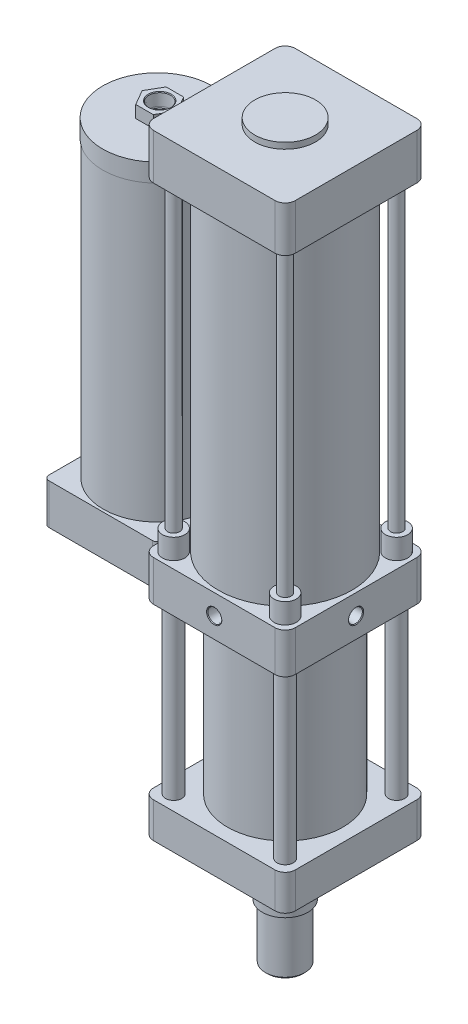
ISO-10303-21;
HEADER;
FILE_DESCRIPTION(('STEP AP214'),'2;1');
FILE_NAME('part.step','',(''),(''),'','','');
FILE_SCHEMA(('AUTOMOTIVE_DESIGN { 1 0 10303 214 1 1 1 1 }'));
ENDSEC;
DATA;
#1=APPLICATION_CONTEXT('core data for automotive mechanical design processes');
#2=APPLICATION_PROTOCOL_DEFINITION('international standard','automotive_design',2000,#1);
#3=PRODUCT_CONTEXT('',#1,'mechanical');
#4=PRODUCT('Part','Part','',(#3));
#5=PRODUCT_RELATED_PRODUCT_CATEGORY('part','',(#4));
#6=PRODUCT_DEFINITION_FORMATION('','',#4);
#7=PRODUCT_DEFINITION_CONTEXT('part definition',#1,'design');
#8=PRODUCT_DEFINITION('design','',#6,#7);
#9=PRODUCT_DEFINITION_SHAPE('','',#8);
#10=(LENGTH_UNIT() NAMED_UNIT(*) SI_UNIT(.MILLI.,.METRE.));
#11=(NAMED_UNIT(*) PLANE_ANGLE_UNIT() SI_UNIT($,.RADIAN.));
#12=(NAMED_UNIT(*) SI_UNIT($,.STERADIAN.) SOLID_ANGLE_UNIT());
#13=UNCERTAINTY_MEASURE_WITH_UNIT(LENGTH_MEASURE(1.E-05),#10,'distance_accuracy_value','');
#14=(GEOMETRIC_REPRESENTATION_CONTEXT(3) GLOBAL_UNCERTAINTY_ASSIGNED_CONTEXT((#13)) GLOBAL_UNIT_ASSIGNED_CONTEXT((#10,
#11,#12)) REPRESENTATION_CONTEXT('',''));
#15=CARTESIAN_POINT('',(0.,0.,0.));
#16=DIRECTION('',(0.,0.,1.));
#17=DIRECTION('',(1.,0.,0.));
#18=AXIS2_PLACEMENT_3D('',#15,#16,#17);
#19=CARTESIAN_POINT('',(-135.80496920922,562.,-18.368745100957));
#20=DIRECTION('',(0.866025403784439,0.,0.5));
#21=DIRECTION('',(0.5,0.,-0.866025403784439));
#22=AXIS2_PLACEMENT_3D('',#19,#20,#21);
#23=PLANE('',#22);
#24=DIRECTION('',(-0.5,0.,0.866025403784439));
#25=VECTOR('',#24,1.);
#26=CARTESIAN_POINT('',(-135.80496920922,550.,-18.368745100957));
#27=LINE('',#26,#25);
#28=CARTESIAN_POINT('',(-135.80496920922,550.,-18.368745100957));
#29=VERTEX_POINT('',#28);
#30=CARTESIAN_POINT('',(-144.465223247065,550.,-3.36874510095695));
#31=VERTEX_POINT('',#30);
#32=EDGE_CURVE('E133',#29,#31,#27,.T.);
#33=ORIENTED_EDGE('',*,*,#32,.T.);
#34=DIRECTION('',(0.,-1.,0.));
#35=VECTOR('',#34,1.);
#36=CARTESIAN_POINT('',(-144.465223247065,562.,-3.36874510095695));
#37=LINE('',#36,#35);
#38=CARTESIAN_POINT('',(-144.465223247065,562.,-3.36874510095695));
#39=VERTEX_POINT('',#38);
#40=EDGE_CURVE('E12',#39,#31,#37,.T.);
#41=ORIENTED_EDGE('',*,*,#40,.F.);
#42=DIRECTION('',(-0.5,0.,0.866025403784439));
#43=VECTOR('',#42,1.);
#44=CARTESIAN_POINT('',(-135.80496920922,562.,-18.368745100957));
#45=LINE('',#44,#43);
#46=CARTESIAN_POINT('',(-135.80496920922,562.,-18.368745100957));
#47=VERTEX_POINT('',#46);
#48=EDGE_CURVE('E143',#47,#39,#45,.T.);
#49=ORIENTED_EDGE('',*,*,#48,.F.);
#50=DIRECTION('',(0.,-1.,0.));
#51=VECTOR('',#50,1.);
#52=CARTESIAN_POINT('',(-135.80496920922,562.,-18.368745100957));
#53=LINE('',#52,#51);
#54=EDGE_CURVE('E129',#47,#29,#53,.T.);
#55=ORIENTED_EDGE('',*,*,#54,.T.);
#56=EDGE_LOOP('',(#33,#41,#49,#55));
#57=FACE_BOUND('',#56,.T.);
#58=ADVANCED_FACE('F48',(#57),#23,.F.);
#59=CARTESIAN_POINT('',(-144.465223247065,562.,-3.36874510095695));
#60=DIRECTION('',(0.866025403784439,0.,-0.499999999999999));
#61=DIRECTION('',(-0.499999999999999,0.,-0.866025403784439));
#62=AXIS2_PLACEMENT_3D('',#59,#60,#61);
#63=PLANE('',#62);
#64=DIRECTION('',(0.499999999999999,0.,0.866025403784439));
#65=VECTOR('',#64,1.);
#66=CARTESIAN_POINT('',(-144.465223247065,550.,-3.36874510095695));
#67=LINE('',#66,#65);
#68=CARTESIAN_POINT('',(-135.80496920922,550.,11.631254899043));
#69=VERTEX_POINT('',#68);
#70=EDGE_CURVE('E136',#31,#69,#67,.T.);
#71=ORIENTED_EDGE('',*,*,#70,.T.);
#72=DIRECTION('',(0.,-1.,0.));
#73=VECTOR('',#72,1.);
#74=CARTESIAN_POINT('',(-135.80496920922,562.,11.631254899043));
#75=LINE('',#74,#73);
#76=CARTESIAN_POINT('',(-135.80496920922,562.,11.631254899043));
#77=VERTEX_POINT('',#76);
#78=EDGE_CURVE('E57',#77,#69,#75,.T.);
#79=ORIENTED_EDGE('',*,*,#78,.F.);
#80=DIRECTION('',(0.499999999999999,0.,0.866025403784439));
#81=VECTOR('',#80,1.);
#82=CARTESIAN_POINT('',(-144.465223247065,562.,-3.36874510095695));
#83=LINE('',#82,#81);
#84=EDGE_CURVE('E102',#39,#77,#83,.T.);
#85=ORIENTED_EDGE('',*,*,#84,.F.);
#86=ORIENTED_EDGE('',*,*,#40,.T.);
#87=EDGE_LOOP('',(#71,#79,#85,#86));
#88=FACE_BOUND('',#87,.T.);
#89=ADVANCED_FACE('F169',(#88),#63,.F.);
#90=CARTESIAN_POINT('',(-135.80496920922,562.,11.631254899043));
#91=DIRECTION('',(0.,0.,-1.));
#92=DIRECTION('',(-1.,0.,0.));
#93=AXIS2_PLACEMENT_3D('',#90,#91,#92);
#94=PLANE('',#93);
#95=DIRECTION('',(1.,0.,0.));
#96=VECTOR('',#95,1.);
#97=CARTESIAN_POINT('',(-135.80496920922,550.,11.631254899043));
#98=LINE('',#97,#96);
#99=CARTESIAN_POINT('',(-118.484461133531,550.,11.631254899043));
#100=VERTEX_POINT('',#99);
#101=EDGE_CURVE('E138',#69,#100,#98,.T.);
#102=ORIENTED_EDGE('',*,*,#101,.T.);
#103=DIRECTION('',(0.,-1.,0.));
#104=VECTOR('',#103,1.);
#105=CARTESIAN_POINT('',(-118.484461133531,562.,11.631254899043));
#106=LINE('',#105,#104);
#107=CARTESIAN_POINT('',(-118.484461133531,562.,11.631254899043));
#108=VERTEX_POINT('',#107);
#109=EDGE_CURVE('E124',#108,#100,#106,.T.);
#110=ORIENTED_EDGE('',*,*,#109,.F.);
#111=DIRECTION('',(1.,0.,0.));
#112=VECTOR('',#111,1.);
#113=CARTESIAN_POINT('',(-135.80496920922,562.,11.631254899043));
#114=LINE('',#113,#112);
#115=EDGE_CURVE('E115',#77,#108,#114,.T.);
#116=ORIENTED_EDGE('',*,*,#115,.F.);
#117=ORIENTED_EDGE('',*,*,#78,.T.);
#118=EDGE_LOOP('',(#102,#110,#116,#117));
#119=FACE_BOUND('',#118,.T.);
#120=ADVANCED_FACE('F150',(#119),#94,.F.);
#121=CARTESIAN_POINT('',(-118.484461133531,562.,11.631254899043));
#122=DIRECTION('',(-0.866025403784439,0.,-0.5));
#123=DIRECTION('',(-0.5,0.,0.866025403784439));
#124=AXIS2_PLACEMENT_3D('',#121,#122,#123);
#125=PLANE('',#124);
#126=DIRECTION('',(0.5,0.,-0.866025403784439));
#127=VECTOR('',#126,1.);
#128=CARTESIAN_POINT('',(-118.484461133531,550.,11.631254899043));
#129=LINE('',#128,#127);
#130=CARTESIAN_POINT('',(-109.824207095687,550.,-3.36874510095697));
#131=VERTEX_POINT('',#130);
#132=EDGE_CURVE('E123',#100,#131,#129,.T.);
#133=ORIENTED_EDGE('',*,*,#132,.T.);
#134=DIRECTION('',(0.,-1.,0.));
#135=VECTOR('',#134,1.);
#136=CARTESIAN_POINT('',(-109.824207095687,562.,-3.36874510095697));
#137=LINE('',#136,#135);
#138=CARTESIAN_POINT('',(-109.824207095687,562.,-3.36874510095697));
#139=VERTEX_POINT('',#138);
#140=EDGE_CURVE('E120',#139,#131,#137,.T.);
#141=ORIENTED_EDGE('',*,*,#140,.F.);
#142=DIRECTION('',(0.5,0.,-0.866025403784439));
#143=VECTOR('',#142,1.);
#144=CARTESIAN_POINT('',(-118.484461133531,562.,11.631254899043));
#145=LINE('',#144,#143);
#146=EDGE_CURVE('E109',#108,#139,#145,.T.);
#147=ORIENTED_EDGE('',*,*,#146,.F.);
#148=ORIENTED_EDGE('',*,*,#109,.T.);
#149=EDGE_LOOP('',(#133,#141,#147,#148));
#150=FACE_BOUND('',#149,.T.);
#151=ADVANCED_FACE('F121',(#150),#125,.F.);
#152=CARTESIAN_POINT('',(-109.824207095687,562.,-3.36874510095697));
#153=DIRECTION('',(-0.866025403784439,0.,0.5));
#154=DIRECTION('',(0.5,0.,0.866025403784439));
#155=AXIS2_PLACEMENT_3D('',#152,#153,#154);
#156=PLANE('',#155);
#157=DIRECTION('',(-0.5,0.,-0.866025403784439));
#158=VECTOR('',#157,1.);
#159=CARTESIAN_POINT('',(-109.824207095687,550.,-3.36874510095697));
#160=LINE('',#159,#158);
#161=CARTESIAN_POINT('',(-118.484461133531,550.,-18.368745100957));
#162=VERTEX_POINT('',#161);
#163=EDGE_CURVE('E88',#131,#162,#160,.T.);
#164=ORIENTED_EDGE('',*,*,#163,.T.);
#165=DIRECTION('',(0.,-1.,0.));
#166=VECTOR('',#165,1.);
#167=CARTESIAN_POINT('',(-118.484461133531,562.,-18.368745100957));
#168=LINE('',#167,#166);
#169=CARTESIAN_POINT('',(-118.484461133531,562.,-18.368745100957));
#170=VERTEX_POINT('',#169);
#171=EDGE_CURVE('E125',#170,#162,#168,.T.);
#172=ORIENTED_EDGE('',*,*,#171,.F.);
#173=DIRECTION('',(-0.5,0.,-0.866025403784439));
#174=VECTOR('',#173,1.);
#175=CARTESIAN_POINT('',(-109.824207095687,562.,-3.36874510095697));
#176=LINE('',#175,#174);
#177=EDGE_CURVE('E113',#139,#170,#176,.T.);
#178=ORIENTED_EDGE('',*,*,#177,.F.);
#179=ORIENTED_EDGE('',*,*,#140,.T.);
#180=EDGE_LOOP('',(#164,#172,#178,#179));
#181=FACE_BOUND('',#180,.T.);
#182=ADVANCED_FACE('F127',(#181),#156,.F.);
#183=CARTESIAN_POINT('',(-118.484461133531,562.,-18.368745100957));
#184=DIRECTION('',(0.,0.,1.));
#185=DIRECTION('',(1.,0.,0.));
#186=AXIS2_PLACEMENT_3D('',#183,#184,#185);
#187=PLANE('',#186);
#188=DIRECTION('',(-1.,0.,0.));
#189=VECTOR('',#188,1.);
#190=CARTESIAN_POINT('',(-118.484461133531,550.,-18.368745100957));
#191=LINE('',#190,#189);
#192=EDGE_CURVE('E94',#162,#29,#191,.T.);
#193=ORIENTED_EDGE('',*,*,#192,.T.);
#194=ORIENTED_EDGE('',*,*,#54,.F.);
#195=DIRECTION('',(-1.,0.,0.));
#196=VECTOR('',#195,1.);
#197=CARTESIAN_POINT('',(-118.484461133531,562.,-18.368745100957));
#198=LINE('',#197,#196);
#199=EDGE_CURVE('E65',#170,#47,#198,.T.);
#200=ORIENTED_EDGE('',*,*,#199,.F.);
#201=ORIENTED_EDGE('',*,*,#171,.T.);
#202=EDGE_LOOP('',(#193,#194,#200,#201));
#203=FACE_BOUND('',#202,.T.);
#204=ADVANCED_FACE('F157',(#203),#187,.F.);
#205=CARTESIAN_POINT('',(0.,562.,0.));
#206=DIRECTION('',(0.,1.,0.));
#207=DIRECTION('',(0.,0.,1.));
#208=AXIS2_PLACEMENT_3D('',#205,#206,#207);
#209=PLANE('',#208);
#210=CARTESIAN_POINT('',(-127.144715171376,562.,-3.36874510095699));
#211=DIRECTION('',(0.,1.,0.));
#212=DIRECTION('',(0.,0.,1.));
#213=AXIS2_PLACEMENT_3D('',#210,#211,#212);
#214=CIRCLE('',#213,11.3029619);
#215=CARTESIAN_POINT('',(-127.144715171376,562.,7.93421679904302));
#216=VERTEX_POINT('',#215);
#217=EDGE_CURVE('E235',#216,#216,#214,.T.);
#218=ORIENTED_EDGE('',*,*,#217,.F.);
#219=EDGE_LOOP('',(#218));
#220=FACE_BOUND('',#219,.T.);
#221=ORIENTED_EDGE('',*,*,#48,.T.);
#222=ORIENTED_EDGE('',*,*,#84,.T.);
#223=ORIENTED_EDGE('',*,*,#115,.T.);
#224=ORIENTED_EDGE('',*,*,#146,.T.);
#225=ORIENTED_EDGE('',*,*,#177,.T.);
#226=ORIENTED_EDGE('',*,*,#199,.T.);
#227=EDGE_LOOP('',(#221,#222,#223,#224,#225,#226));
#228=FACE_BOUND('',#227,.T.);
#229=ADVANCED_FACE('F111',(#220,#228),#209,.T.);
#230=CARTESIAN_POINT('',(0.,550.,0.));
#231=DIRECTION('',(0.,1.,0.));
#232=DIRECTION('',(0.,0.,1.));
#233=AXIS2_PLACEMENT_3D('',#230,#231,#232);
#234=PLANE('',#233);
#235=CARTESIAN_POINT('',(-127.144715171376,550.,-3.36874510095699));
#236=DIRECTION('',(0.,1.,0.));
#237=DIRECTION('',(0.,0.,1.));
#238=AXIS2_PLACEMENT_3D('',#235,#236,#237);
#239=CIRCLE('',#238,10.3276785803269);
#240=CARTESIAN_POINT('',(-127.144715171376,550.,6.95893347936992));
#241=VERTEX_POINT('',#240);
#242=EDGE_CURVE('E51',#241,#241,#239,.T.);
#243=ORIENTED_EDGE('',*,*,#242,.T.);
#244=EDGE_LOOP('',(#243));
#245=FACE_BOUND('',#244,.T.);
#246=ORIENTED_EDGE('',*,*,#32,.F.);
#247=ORIENTED_EDGE('',*,*,#192,.F.);
#248=ORIENTED_EDGE('',*,*,#163,.F.);
#249=ORIENTED_EDGE('',*,*,#132,.F.);
#250=ORIENTED_EDGE('',*,*,#101,.F.);
#251=ORIENTED_EDGE('',*,*,#70,.F.);
#252=EDGE_LOOP('',(#246,#247,#248,#249,#250,#251));
#253=FACE_BOUND('',#252,.T.);
#254=ADVANCED_FACE('F153',(#245,#253),#234,.F.);
#255=CARTESIAN_POINT('',(-127.144715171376,561.365,-3.36874510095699));
#256=DIRECTION('',(0.,1.,0.));
#257=DIRECTION('',(0.,0.,1.));
#258=AXIS2_PLACEMENT_3D('',#255,#256,#257);
#259=CONICAL_SURFACE('',#258,10.6679619,0.029932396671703);
#260=CARTESIAN_POINT('',(-127.144715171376,561.365,-3.36874510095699));
#261=DIRECTION('',(0.,1.,0.));
#262=DIRECTION('',(0.,0.,1.));
#263=AXIS2_PLACEMENT_3D('',#260,#261,#262);
#264=CIRCLE('',#263,10.6679619);
#265=CARTESIAN_POINT('',(-127.144715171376,561.365,7.29921679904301));
#266=VERTEX_POINT('',#265);
#267=EDGE_CURVE('E232',#266,#266,#264,.T.);
#268=ORIENTED_EDGE('',*,*,#267,.T.);
#269=EDGE_LOOP('',(#268));
#270=FACE_BOUND('',#269,.T.);
#271=ORIENTED_EDGE('',*,*,#242,.F.);
#272=EDGE_LOOP('',(#271));
#273=FACE_BOUND('',#272,.T.);
#274=ADVANCED_FACE('F206',(#270,#273),#259,.F.);
#275=CARTESIAN_POINT('',(-127.144715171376,562.,-3.36874510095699));
#276=DIRECTION('',(0.,1.,0.));
#277=DIRECTION('',(0.,0.,1.));
#278=AXIS2_PLACEMENT_3D('',#275,#276,#277);
#279=CONICAL_SURFACE('',#278,11.3029619,0.785398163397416);
#280=ORIENTED_EDGE('',*,*,#267,.F.);
#281=EDGE_LOOP('',(#280));
#282=FACE_BOUND('',#281,.T.);
#283=ORIENTED_EDGE('',*,*,#217,.T.);
#284=EDGE_LOOP('',(#283));
#285=FACE_BOUND('',#284,.T.);
#286=ADVANCED_FACE('F215',(#282,#285),#279,.F.);
#287=CLOSED_SHELL('',(#58,#89,#120,#151,#182,#204,#229,#254,#274,#286));
#288=MANIFOLD_SOLID_BREP('B2',#287);
#289=CARTESIAN_POINT('',(-126.,550.,0.));
#290=DIRECTION('',(0.,-1.,0.));
#291=DIRECTION('',(0.,0.,-1.));
#292=AXIS2_PLACEMENT_3D('',#289,#290,#291);
#293=CYLINDRICAL_SURFACE('',#292,54.);
#294=CARTESIAN_POINT('',(-126.,550.,0.));
#295=DIRECTION('',(0.,1.,0.));
#296=DIRECTION('',(0.,0.,1.));
#297=AXIS2_PLACEMENT_3D('',#294,#295,#296);
#298=CIRCLE('',#297,54.);
#299=CARTESIAN_POINT('',(-126.,550.,54.0000000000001));
#300=VERTEX_POINT('',#299);
#301=EDGE_CURVE('E46',#300,#300,#298,.T.);
#302=ORIENTED_EDGE('',*,*,#301,.F.);
#303=EDGE_LOOP('',(#302));
#304=FACE_BOUND('',#303,.T.);
#305=CARTESIAN_POINT('',(-126.,532.,0.));
#306=DIRECTION('',(0.,1.,0.));
#307=DIRECTION('',(0.,0.,1.));
#308=AXIS2_PLACEMENT_3D('',#305,#306,#307);
#309=CIRCLE('',#308,54.);
#310=CARTESIAN_POINT('',(-126.,532.,54.0000000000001));
#311=VERTEX_POINT('',#310);
#312=EDGE_CURVE('E275',#311,#311,#309,.T.);
#313=ORIENTED_EDGE('',*,*,#312,.T.);
#314=EDGE_LOOP('',(#313));
#315=FACE_BOUND('',#314,.T.);
#316=ADVANCED_FACE('F268',(#304,#315),#293,.T.);
#317=CARTESIAN_POINT('',(-126.,550.,0.));
#318=DIRECTION('',(0.,1.,0.));
#319=DIRECTION('',(0.,0.,1.));
#320=AXIS2_PLACEMENT_3D('',#317,#318,#319);
#321=PLANE('',#320);
#322=CARTESIAN_POINT('',(-127.144715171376,550.,-3.36874510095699));
#323=DIRECTION('',(0.,1.,0.));
#324=DIRECTION('',(0.,0.,1.));
#325=AXIS2_PLACEMENT_3D('',#322,#323,#324);
#326=CIRCLE('',#325,10.3276785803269);
#327=CARTESIAN_POINT('',(-127.144715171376,550.,6.95893347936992));
#328=VERTEX_POINT('',#327);
#329=EDGE_CURVE('E271',#328,#328,#326,.T.);
#330=ORIENTED_EDGE('',*,*,#329,.F.);
#331=EDGE_LOOP('',(#330));
#332=FACE_BOUND('',#331,.T.);
#333=ORIENTED_EDGE('',*,*,#301,.T.);
#334=EDGE_LOOP('',(#333));
#335=FACE_BOUND('',#334,.T.);
#336=ADVANCED_FACE('F301',(#332,#335),#321,.T.);
#337=CARTESIAN_POINT('',(-126.,532.,0.));
#338=DIRECTION('',(0.,1.,0.));
#339=DIRECTION('',(0.,0.,1.));
#340=AXIS2_PLACEMENT_3D('',#337,#338,#339);
#341=PLANE('',#340);
#342=ORIENTED_EDGE('',*,*,#312,.F.);
#343=EDGE_LOOP('',(#342));
#344=FACE_BOUND('',#343,.T.);
#345=ADVANCED_FACE('F283',(#344),#341,.F.);
#346=CARTESIAN_POINT('',(-127.144715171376,539.36,-3.36874510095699));
#347=DIRECTION('',(0.,1.,0.));
#348=DIRECTION('',(0.,0.,1.));
#349=AXIS2_PLACEMENT_3D('',#346,#347,#348);
#350=CONICAL_SURFACE('',#349,8.92810000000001,1.02974425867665);
#351=CARTESIAN_POINT('',(-127.144715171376,533.99545630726,-3.36874510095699));
#352=VERTEX_POINT('',#351);
#353=VERTEX_LOOP('',#352);
#354=FACE_BOUND('',#353,.T.);
#355=CARTESIAN_POINT('',(-127.144715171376,539.36,-3.36874510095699));
#356=DIRECTION('',(0.,1.,0.));
#357=DIRECTION('',(0.,0.,1.));
#358=AXIS2_PLACEMENT_3D('',#355,#356,#357);
#359=CIRCLE('',#358,8.92810000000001);
#360=CARTESIAN_POINT('',(-127.144715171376,539.36,5.55935489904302));
#361=VERTEX_POINT('',#360);
#362=EDGE_CURVE('E287',#361,#361,#359,.T.);
#363=ORIENTED_EDGE('',*,*,#362,.T.);
#364=EDGE_LOOP('',(#363));
#365=FACE_BOUND('',#364,.T.);
#366=ADVANCED_FACE('F279',(#354,#365),#350,.F.);
#367=CARTESIAN_POINT('',(-127.144715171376,562.,-3.36874510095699));
#368=DIRECTION('',(0.,1.,0.));
#369=DIRECTION('',(0.,0.,1.));
#370=AXIS2_PLACEMENT_3D('',#367,#368,#369);
#371=CYLINDRICAL_SURFACE('',#370,8.9281);
#372=ORIENTED_EDGE('',*,*,#362,.F.);
#373=EDGE_LOOP('',(#372));
#374=FACE_BOUND('',#373,.T.);
#375=CARTESIAN_POINT('',(-127.144715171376,548.43,-3.36874510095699));
#376=DIRECTION('',(0.,1.,0.));
#377=DIRECTION('',(0.,0.,1.));
#378=AXIS2_PLACEMENT_3D('',#375,#376,#377);
#379=CIRCLE('',#378,8.92809999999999);
#380=CARTESIAN_POINT('',(-127.144715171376,548.43,5.55935489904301));
#381=VERTEX_POINT('',#380);
#382=EDGE_CURVE('E289',#381,#381,#379,.T.);
#383=ORIENTED_EDGE('',*,*,#382,.T.);
#384=EDGE_LOOP('',(#383));
#385=FACE_BOUND('',#384,.T.);
#386=ADVANCED_FACE('F282',(#374,#385),#371,.F.);
#387=CARTESIAN_POINT('',(-118.216615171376,548.43,-3.36874510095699));
#388=DIRECTION('',(0.,-1.,0.));
#389=DIRECTION('',(0.,0.,-1.));
#390=AXIS2_PLACEMENT_3D('',#387,#388,#389);
#391=PLANE('',#390);
#392=ORIENTED_EDGE('',*,*,#382,.F.);
#393=EDGE_LOOP('',(#392));
#394=FACE_BOUND('',#393,.T.);
#395=CARTESIAN_POINT('',(-127.144715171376,548.43,-3.36874510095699));
#396=DIRECTION('',(0.,1.,0.));
#397=DIRECTION('',(0.,0.,1.));
#398=AXIS2_PLACEMENT_3D('',#395,#396,#397);
#399=CIRCLE('',#398,10.2806706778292);
#400=CARTESIAN_POINT('',(-127.144715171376,548.43,6.91192557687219));
#401=VERTEX_POINT('',#400);
#402=EDGE_CURVE('E293',#401,#401,#399,.T.);
#403=ORIENTED_EDGE('',*,*,#402,.T.);
#404=EDGE_LOOP('',(#403));
#405=FACE_BOUND('',#404,.T.);
#406=ADVANCED_FACE('F334',(#394,#405),#391,.F.);
#407=CARTESIAN_POINT('',(-127.144715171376,561.365,-3.36874510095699));
#408=DIRECTION('',(0.,1.,0.));
#409=DIRECTION('',(0.,0.,1.));
#410=AXIS2_PLACEMENT_3D('',#407,#408,#409);
#411=CONICAL_SURFACE('',#410,10.6679619,0.029932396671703);
#412=ORIENTED_EDGE('',*,*,#329,.T.);
#413=EDGE_LOOP('',(#412));
#414=FACE_BOUND('',#413,.T.);
#415=ORIENTED_EDGE('',*,*,#402,.F.);
#416=EDGE_LOOP('',(#415));
#417=FACE_BOUND('',#416,.T.);
#418=ADVANCED_FACE('F343',(#414,#417),#411,.F.);
#419=CLOSED_SHELL('',(#316,#336,#345,#366,#386,#406,#418));
#420=MANIFOLD_SOLID_BREP('B6',#419);
#421=CARTESIAN_POINT('',(-126.,532.,0.));
#422=DIRECTION('',(0.,-1.,0.));
#423=DIRECTION('',(0.,0.,-1.));
#424=AXIS2_PLACEMENT_3D('',#421,#422,#423);
#425=CYLINDRICAL_SURFACE('',#424,53.5);
#426=CARTESIAN_POINT('',(-126.,532.,0.));
#427=DIRECTION('',(0.,1.,0.));
#428=DIRECTION('',(0.,0.,1.));
#429=AXIS2_PLACEMENT_3D('',#426,#427,#428);
#430=CIRCLE('',#429,53.5);
#431=CARTESIAN_POINT('',(-126.,532.,53.5));
#432=VERTEX_POINT('',#431);
#433=EDGE_CURVE('E267',#432,#432,#430,.T.);
#434=ORIENTED_EDGE('',*,*,#433,.F.);
#435=EDGE_LOOP('',(#434));
#436=FACE_BOUND('',#435,.T.);
#437=CARTESIAN_POINT('',(-126.,242.,0.));
#438=DIRECTION('',(0.,1.,0.));
#439=DIRECTION('',(0.,0.,1.));
#440=AXIS2_PLACEMENT_3D('',#437,#438,#439);
#441=CIRCLE('',#440,53.5);
#442=CARTESIAN_POINT('',(-126.,242.,53.5));
#443=VERTEX_POINT('',#442);
#444=EDGE_CURVE('E384',#443,#443,#441,.T.);
#445=ORIENTED_EDGE('',*,*,#444,.T.);
#446=EDGE_LOOP('',(#445));
#447=FACE_BOUND('',#446,.T.);
#448=ADVANCED_FACE('F381',(#436,#447),#425,.T.);
#449=CARTESIAN_POINT('',(-126.,532.,0.));
#450=DIRECTION('',(0.,1.,0.));
#451=DIRECTION('',(0.,0.,1.));
#452=AXIS2_PLACEMENT_3D('',#449,#450,#451);
#453=PLANE('',#452);
#454=ORIENTED_EDGE('',*,*,#433,.T.);
#455=EDGE_LOOP('',(#454));
#456=FACE_BOUND('',#455,.T.);
#457=ADVANCED_FACE('F396',(#456),#453,.T.);
#458=CARTESIAN_POINT('',(-126.,242.,0.));
#459=DIRECTION('',(0.,1.,0.));
#460=DIRECTION('',(0.,0.,1.));
#461=AXIS2_PLACEMENT_3D('',#458,#459,#460);
#462=PLANE('',#461);
#463=ORIENTED_EDGE('',*,*,#444,.F.);
#464=EDGE_LOOP('',(#463));
#465=FACE_BOUND('',#464,.T.);
#466=ADVANCED_FACE('F394',(#465),#462,.F.);
#467=CLOSED_SHELL('',(#448,#457,#466));
#468=MANIFOLD_SOLID_BREP('B40',#467);
#469=CARTESIAN_POINT('',(-60.,242.,60.));
#470=DIRECTION('',(0.,1.,0.));
#471=DIRECTION('',(0.,0.,1.));
#472=AXIS2_PLACEMENT_3D('',#469,#470,#471);
#473=PLANE('',#472);
#474=CARTESIAN_POINT('',(-75.,242.,-51.));
#475=DIRECTION('',(0.,1.,0.));
#476=DIRECTION('',(0.,0.,1.));
#477=AXIS2_PLACEMENT_3D('',#474,#475,#476);
#478=CIRCLE('',#477,5.);
#479=CARTESIAN_POINT('',(-75.,242.,-56.));
#480=VERTEX_POINT('',#479);
#481=CARTESIAN_POINT('',(-70.,242.,-50.9999999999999));
#482=VERTEX_POINT('',#481);
#483=EDGE_CURVE('E438',#480,#482,#478,.F.);
#484=ORIENTED_EDGE('',*,*,#483,.F.);
#485=DIRECTION('',(1.,0.,0.));
#486=VECTOR('',#485,1.);
#487=CARTESIAN_POINT('',(-177.,242.,-56.));
#488=LINE('',#487,#486);
#489=CARTESIAN_POINT('',(-177.,242.,-56.));
#490=VERTEX_POINT('',#489);
#491=EDGE_CURVE('E524',#490,#480,#488,.T.);
#492=ORIENTED_EDGE('',*,*,#491,.F.);
#493=CARTESIAN_POINT('',(-177.,242.,-51.));
#494=DIRECTION('',(0.,1.,0.));
#495=DIRECTION('',(0.,0.,1.));
#496=AXIS2_PLACEMENT_3D('',#493,#494,#495);
#497=CIRCLE('',#496,5.);
#498=CARTESIAN_POINT('',(-182.,242.,-50.9999999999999));
#499=VERTEX_POINT('',#498);
#500=EDGE_CURVE('E528',#499,#490,#497,.F.);
#501=ORIENTED_EDGE('',*,*,#500,.F.);
#502=DIRECTION('',(0.,0.,-1.));
#503=VECTOR('',#502,1.);
#504=CARTESIAN_POINT('',(-182.,242.,51.));
#505=LINE('',#504,#503);
#506=CARTESIAN_POINT('',(-182.,242.,51.));
#507=VERTEX_POINT('',#506);
#508=EDGE_CURVE('E532',#507,#499,#505,.T.);
#509=ORIENTED_EDGE('',*,*,#508,.F.);
#510=CARTESIAN_POINT('',(-177.,242.,51.));
#511=DIRECTION('',(0.,1.,0.));
#512=DIRECTION('',(0.,0.,1.));
#513=AXIS2_PLACEMENT_3D('',#510,#511,#512);
#514=CIRCLE('',#513,5.);
#515=CARTESIAN_POINT('',(-177.,242.,56.));
#516=VERTEX_POINT('',#515);
#517=EDGE_CURVE('E536',#516,#507,#514,.F.);
#518=ORIENTED_EDGE('',*,*,#517,.F.);
#519=DIRECTION('',(-1.,0.,0.));
#520=VECTOR('',#519,1.);
#521=CARTESIAN_POINT('',(-177.,242.,56.));
#522=LINE('',#521,#520);
#523=CARTESIAN_POINT('',(-75.,242.,56.));
#524=VERTEX_POINT('',#523);
#525=EDGE_CURVE('E473',#524,#516,#522,.T.);
#526=ORIENTED_EDGE('',*,*,#525,.F.);
#527=CARTESIAN_POINT('',(-75.,242.,51.));
#528=DIRECTION('',(0.,1.,0.));
#529=DIRECTION('',(0.,0.,1.));
#530=AXIS2_PLACEMENT_3D('',#527,#528,#529);
#531=CIRCLE('',#530,5.);
#532=CARTESIAN_POINT('',(-70.,242.,51.));
#533=VERTEX_POINT('',#532);
#534=EDGE_CURVE('E478',#533,#524,#531,.F.);
#535=ORIENTED_EDGE('',*,*,#534,.F.);
#536=DIRECTION('',(0.,0.,1.));
#537=VECTOR('',#536,1.);
#538=CARTESIAN_POINT('',(-70.,242.,51.));
#539=LINE('',#538,#537);
#540=EDGE_CURVE('E505',#482,#533,#539,.T.);
#541=ORIENTED_EDGE('',*,*,#540,.F.);
#542=EDGE_LOOP('',(#484,#492,#501,#509,#518,#526,#535,#541));
#543=FACE_BOUND('',#542,.T.);
#544=ADVANCED_FACE('F430',(#543),#473,.T.);
#545=CARTESIAN_POINT('',(-75.,202.,-51.));
#546=DIRECTION('',(0.,-1.,0.));
#547=DIRECTION('',(0.,0.,-1.));
#548=AXIS2_PLACEMENT_3D('',#545,#546,#547);
#549=PLANE('',#548);
#550=CARTESIAN_POINT('',(-75.,202.,-51.));
#551=DIRECTION('',(0.,-1.,0.));
#552=DIRECTION('',(0.,0.,-1.));
#553=AXIS2_PLACEMENT_3D('',#550,#551,#552);
#554=CIRCLE('',#553,5.);
#555=CARTESIAN_POINT('',(-75.,202.,-56.));
#556=VERTEX_POINT('',#555);
#557=CARTESIAN_POINT('',(-70.,202.,-50.9999999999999));
#558=VERTEX_POINT('',#557);
#559=EDGE_CURVE('E515',#556,#558,#554,.T.);
#560=ORIENTED_EDGE('',*,*,#559,.T.);
#561=DIRECTION('',(0.,0.,1.));
#562=VECTOR('',#561,1.);
#563=CARTESIAN_POINT('',(-70.,202.,51.));
#564=LINE('',#563,#562);
#565=CARTESIAN_POINT('',(-70.,202.,51.));
#566=VERTEX_POINT('',#565);
#567=EDGE_CURVE('E503',#558,#566,#564,.T.);
#568=ORIENTED_EDGE('',*,*,#567,.T.);
#569=CARTESIAN_POINT('',(-75.,202.,51.));
#570=DIRECTION('',(0.,-1.,0.));
#571=DIRECTION('',(0.,0.,1.));
#572=AXIS2_PLACEMENT_3D('',#569,#570,#571);
#573=CIRCLE('',#572,5.);
#574=CARTESIAN_POINT('',(-75.0000000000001,202.,56.));
#575=VERTEX_POINT('',#574);
#576=EDGE_CURVE('E507',#566,#575,#573,.T.);
#577=ORIENTED_EDGE('',*,*,#576,.T.);
#578=DIRECTION('',(-1.,0.,0.));
#579=VECTOR('',#578,1.);
#580=CARTESIAN_POINT('',(-177.,202.,56.));
#581=LINE('',#580,#579);
#582=CARTESIAN_POINT('',(-177.,202.,56.));
#583=VERTEX_POINT('',#582);
#584=EDGE_CURVE('E511',#575,#583,#581,.T.);
#585=ORIENTED_EDGE('',*,*,#584,.T.);
#586=CARTESIAN_POINT('',(-177.,202.,51.));
#587=DIRECTION('',(0.,-1.,0.));
#588=DIRECTION('',(0.,0.,1.));
#589=AXIS2_PLACEMENT_3D('',#586,#587,#588);
#590=CIRCLE('',#589,5.);
#591=CARTESIAN_POINT('',(-182.,202.,51.));
#592=VERTEX_POINT('',#591);
#593=EDGE_CURVE('E553',#583,#592,#590,.T.);
#594=ORIENTED_EDGE('',*,*,#593,.T.);
#595=DIRECTION('',(0.,0.,-1.));
#596=VECTOR('',#595,1.);
#597=CARTESIAN_POINT('',(-182.,202.,51.));
#598=LINE('',#597,#596);
#599=CARTESIAN_POINT('',(-182.,202.,-50.9999999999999));
#600=VERTEX_POINT('',#599);
#601=EDGE_CURVE('E558',#592,#600,#598,.T.);
#602=ORIENTED_EDGE('',*,*,#601,.T.);
#603=CARTESIAN_POINT('',(-177.,202.,-51.));
#604=DIRECTION('',(0.,-1.,0.));
#605=DIRECTION('',(0.,0.,1.));
#606=AXIS2_PLACEMENT_3D('',#603,#604,#605);
#607=CIRCLE('',#606,5.);
#608=CARTESIAN_POINT('',(-177.,202.,-56.));
#609=VERTEX_POINT('',#608);
#610=EDGE_CURVE('E562',#600,#609,#607,.T.);
#611=ORIENTED_EDGE('',*,*,#610,.T.);
#612=DIRECTION('',(1.,0.,0.));
#613=VECTOR('',#612,1.);
#614=CARTESIAN_POINT('',(-177.,202.,-56.));
#615=LINE('',#614,#613);
#616=EDGE_CURVE('E521',#609,#556,#615,.T.);
#617=ORIENTED_EDGE('',*,*,#616,.T.);
#618=EDGE_LOOP('',(#560,#568,#577,#585,#594,#602,#611,#617));
#619=FACE_BOUND('',#618,.T.);
#620=ADVANCED_FACE('F513',(#619),#549,.T.);
#621=CARTESIAN_POINT('',(-70.,400.391918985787,51.));
#622=DIRECTION('',(1.,0.,0.));
#623=DIRECTION('',(0.,0.,-1.));
#624=AXIS2_PLACEMENT_3D('',#621,#622,#623);
#625=PLANE('',#624);
#626=DIRECTION('',(0.,-1.,0.));
#627=VECTOR('',#626,1.);
#628=CARTESIAN_POINT('',(-70.,400.391918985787,-50.9999999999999));
#629=LINE('',#628,#627);
#630=EDGE_CURVE('E379',#482,#558,#629,.T.);
#631=ORIENTED_EDGE('',*,*,#630,.F.);
#632=ORIENTED_EDGE('',*,*,#540,.T.);
#633=DIRECTION('',(0.,-1.,0.));
#634=VECTOR('',#633,1.);
#635=CARTESIAN_POINT('',(-70.,400.391918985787,51.));
#636=LINE('',#635,#634);
#637=EDGE_CURVE('E500',#533,#566,#636,.T.);
#638=ORIENTED_EDGE('',*,*,#637,.T.);
#639=ORIENTED_EDGE('',*,*,#567,.F.);
#640=EDGE_LOOP('',(#631,#632,#638,#639));
#641=FACE_BOUND('',#640,.T.);
#642=ADVANCED_FACE('F501',(#641),#625,.T.);
#643=CARTESIAN_POINT('',(-75.,400.391918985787,51.));
#644=DIRECTION('',(0.,-1.,0.));
#645=DIRECTION('',(0.,0.,-1.));
#646=AXIS2_PLACEMENT_3D('',#643,#644,#645);
#647=CYLINDRICAL_SURFACE('',#646,5.);
#648=ORIENTED_EDGE('',*,*,#637,.F.);
#649=ORIENTED_EDGE('',*,*,#534,.T.);
#650=DIRECTION('',(0.,-1.,0.));
#651=VECTOR('',#650,1.);
#652=CARTESIAN_POINT('',(-75.0000000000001,400.391918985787,56.));
#653=LINE('',#652,#651);
#654=EDGE_CURVE('E495',#524,#575,#653,.T.);
#655=ORIENTED_EDGE('',*,*,#654,.T.);
#656=ORIENTED_EDGE('',*,*,#576,.F.);
#657=EDGE_LOOP('',(#648,#649,#655,#656));
#658=FACE_BOUND('',#657,.T.);
#659=ADVANCED_FACE('F508',(#658),#647,.T.);
#660=CARTESIAN_POINT('',(-177.,400.391918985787,56.));
#661=DIRECTION('',(0.,0.,1.));
#662=DIRECTION('',(1.,0.,0.));
#663=AXIS2_PLACEMENT_3D('',#660,#661,#662);
#664=PLANE('',#663);
#665=ORIENTED_EDGE('',*,*,#654,.F.);
#666=ORIENTED_EDGE('',*,*,#525,.T.);
#667=DIRECTION('',(0.,-1.,0.));
#668=VECTOR('',#667,1.);
#669=CARTESIAN_POINT('',(-177.,400.391918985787,56.));
#670=LINE('',#669,#668);
#671=EDGE_CURVE('E539',#516,#583,#670,.T.);
#672=ORIENTED_EDGE('',*,*,#671,.T.);
#673=ORIENTED_EDGE('',*,*,#584,.F.);
#674=EDGE_LOOP('',(#665,#666,#672,#673));
#675=FACE_BOUND('',#674,.T.);
#676=ADVANCED_FACE('F550',(#675),#664,.T.);
#677=CARTESIAN_POINT('',(-177.,400.391918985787,51.));
#678=DIRECTION('',(0.,-1.,0.));
#679=DIRECTION('',(0.,0.,-1.));
#680=AXIS2_PLACEMENT_3D('',#677,#678,#679);
#681=CYLINDRICAL_SURFACE('',#680,5.);
#682=ORIENTED_EDGE('',*,*,#671,.F.);
#683=ORIENTED_EDGE('',*,*,#517,.T.);
#684=DIRECTION('',(0.,-1.,0.));
#685=VECTOR('',#684,1.);
#686=CARTESIAN_POINT('',(-182.,400.391918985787,51.));
#687=LINE('',#686,#685);
#688=EDGE_CURVE('E535',#507,#592,#687,.T.);
#689=ORIENTED_EDGE('',*,*,#688,.T.);
#690=ORIENTED_EDGE('',*,*,#593,.F.);
#691=EDGE_LOOP('',(#682,#683,#689,#690));
#692=FACE_BOUND('',#691,.T.);
#693=ADVANCED_FACE('F554',(#692),#681,.T.);
#694=CARTESIAN_POINT('',(-182.,400.391918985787,51.));
#695=DIRECTION('',(-1.,0.,0.));
#696=DIRECTION('',(0.,0.,1.));
#697=AXIS2_PLACEMENT_3D('',#694,#695,#696);
#698=PLANE('',#697);
#699=ORIENTED_EDGE('',*,*,#688,.F.);
#700=ORIENTED_EDGE('',*,*,#508,.T.);
#701=DIRECTION('',(0.,-1.,0.));
#702=VECTOR('',#701,1.);
#703=CARTESIAN_POINT('',(-182.,400.391918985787,-50.9999999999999));
#704=LINE('',#703,#702);
#705=EDGE_CURVE('E531',#499,#600,#704,.T.);
#706=ORIENTED_EDGE('',*,*,#705,.T.);
#707=ORIENTED_EDGE('',*,*,#601,.F.);
#708=EDGE_LOOP('',(#699,#700,#706,#707));
#709=FACE_BOUND('',#708,.T.);
#710=ADVANCED_FACE('F587',(#709),#698,.T.);
#711=CARTESIAN_POINT('',(-177.,400.391918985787,-51.));
#712=DIRECTION('',(0.,-1.,0.));
#713=DIRECTION('',(0.,0.,-1.));
#714=AXIS2_PLACEMENT_3D('',#711,#712,#713);
#715=CYLINDRICAL_SURFACE('',#714,5.);
#716=ORIENTED_EDGE('',*,*,#705,.F.);
#717=ORIENTED_EDGE('',*,*,#500,.T.);
#718=DIRECTION('',(0.,-1.,0.));
#719=VECTOR('',#718,1.);
#720=CARTESIAN_POINT('',(-177.,400.391918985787,-56.));
#721=LINE('',#720,#719);
#722=EDGE_CURVE('E527',#490,#609,#721,.T.);
#723=ORIENTED_EDGE('',*,*,#722,.T.);
#724=ORIENTED_EDGE('',*,*,#610,.F.);
#725=EDGE_LOOP('',(#716,#717,#723,#724));
#726=FACE_BOUND('',#725,.T.);
#727=ADVANCED_FACE('F577',(#726),#715,.T.);
#728=CARTESIAN_POINT('',(-177.,400.391918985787,-56.));
#729=DIRECTION('',(0.,0.,-1.));
#730=DIRECTION('',(-1.,0.,0.));
#731=AXIS2_PLACEMENT_3D('',#728,#729,#730);
#732=PLANE('',#731);
#733=ORIENTED_EDGE('',*,*,#722,.F.);
#734=ORIENTED_EDGE('',*,*,#491,.T.);
#735=DIRECTION('',(0.,-1.,0.));
#736=VECTOR('',#735,1.);
#737=CARTESIAN_POINT('',(-75.,400.391918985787,-56.));
#738=LINE('',#737,#736);
#739=EDGE_CURVE('E523',#480,#556,#738,.T.);
#740=ORIENTED_EDGE('',*,*,#739,.T.);
#741=ORIENTED_EDGE('',*,*,#616,.F.);
#742=EDGE_LOOP('',(#733,#734,#740,#741));
#743=FACE_BOUND('',#742,.T.);
#744=ADVANCED_FACE('F569',(#743),#732,.T.);
#745=CARTESIAN_POINT('',(-75.,400.391918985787,-51.));
#746=DIRECTION('',(0.,-1.,0.));
#747=DIRECTION('',(0.,0.,-1.));
#748=AXIS2_PLACEMENT_3D('',#745,#746,#747);
#749=CYLINDRICAL_SURFACE('',#748,5.);
#750=ORIENTED_EDGE('',*,*,#739,.F.);
#751=ORIENTED_EDGE('',*,*,#483,.T.);
#752=ORIENTED_EDGE('',*,*,#630,.T.);
#753=ORIENTED_EDGE('',*,*,#559,.F.);
#754=EDGE_LOOP('',(#750,#751,#752,#753));
#755=FACE_BOUND('',#754,.T.);
#756=ADVANCED_FACE('F571',(#755),#749,.T.);
#757=CLOSED_SHELL('',(#544,#620,#642,#659,#676,#693,#710,#727,#744,#756));
#758=MANIFOLD_SOLID_BREP('B262',#757);
#759=CARTESIAN_POINT('',(-60.,202.,60.));
#760=DIRECTION('',(0.,1.,0.));
#761=DIRECTION('',(0.,0.,1.));
#762=AXIS2_PLACEMENT_3D('',#759,#760,#761);
#763=PLANE('',#762);
#764=CARTESIAN_POINT('',(-54.9999999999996,202.,-55.0000000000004));
#765=DIRECTION('',(0.,1.,0.));
#766=DIRECTION('',(0.,0.,1.));
#767=AXIS2_PLACEMENT_3D('',#764,#765,#766);
#768=CIRCLE('',#767,8.00000000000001);
#769=CARTESIAN_POINT('',(-54.9999999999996,202.,-47.0000000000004));
#770=VERTEX_POINT('',#769);
#771=EDGE_CURVE('E429',#770,#770,#768,.F.);
#772=ORIENTED_EDGE('',*,*,#771,.F.);
#773=EDGE_LOOP('',(#772));
#774=FACE_BOUND('',#773,.T.);
#775=ADVANCED_FACE('F666',(#774),#763,.T.);
#776=CARTESIAN_POINT('',(-54.9999999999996,0.,-55.0000000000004));
#777=DIRECTION('',(0.,-1.,0.));
#778=DIRECTION('',(0.,0.,-1.));
#779=AXIS2_PLACEMENT_3D('',#776,#777,#778);
#780=PLANE('',#779);
#781=CARTESIAN_POINT('',(-54.9999999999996,0.,-55.0000000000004));
#782=DIRECTION('',(0.,-1.,0.));
#783=DIRECTION('',(0.,0.,-1.));
#784=AXIS2_PLACEMENT_3D('',#781,#782,#783);
#785=CIRCLE('',#784,8.00000000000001);
#786=CARTESIAN_POINT('',(-54.9999999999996,0.,-63.0000000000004));
#787=VERTEX_POINT('',#786);
#788=EDGE_CURVE('E672',#787,#787,#785,.T.);
#789=ORIENTED_EDGE('',*,*,#788,.T.);
#790=EDGE_LOOP('',(#789));
#791=FACE_BOUND('',#790,.T.);
#792=ADVANCED_FACE('F678',(#791),#780,.T.);
#793=CARTESIAN_POINT('',(-54.9999999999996,224.62741699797,-55.0000000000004));
#794=DIRECTION('',(0.,-1.,0.));
#795=DIRECTION('',(0.,0.,-1.));
#796=AXIS2_PLACEMENT_3D('',#793,#794,#795);
#797=CYLINDRICAL_SURFACE('',#796,8.00000000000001);
#798=ORIENTED_EDGE('',*,*,#788,.F.);
#799=EDGE_LOOP('',(#798));
#800=FACE_BOUND('',#799,.T.);
#801=ORIENTED_EDGE('',*,*,#771,.T.);
#802=EDGE_LOOP('',(#801));
#803=FACE_BOUND('',#802,.T.);
#804=ADVANCED_FACE('F680',(#800,#803),#797,.T.);
#805=CLOSED_SHELL('',(#775,#792,#804));
#806=MANIFOLD_SOLID_BREP('B373',#805);
#807=CARTESIAN_POINT('',(-60.,202.,60.));
#808=DIRECTION('',(0.,1.,0.));
#809=DIRECTION('',(0.,0.,1.));
#810=AXIS2_PLACEMENT_3D('',#807,#808,#809);
#811=PLANE('',#810);
#812=CARTESIAN_POINT('',(-55.0000000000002,202.,54.9999999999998));
#813=DIRECTION('',(0.,1.,0.));
#814=DIRECTION('',(0.,0.,1.));
#815=AXIS2_PLACEMENT_3D('',#812,#813,#814);
#816=CIRCLE('',#815,8.00000000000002);
#817=CARTESIAN_POINT('',(-55.0000000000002,202.,62.9999999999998));
#818=VERTEX_POINT('',#817);
#819=EDGE_CURVE('E665',#818,#818,#816,.F.);
#820=ORIENTED_EDGE('',*,*,#819,.F.);
#821=EDGE_LOOP('',(#820));
#822=FACE_BOUND('',#821,.T.);
#823=ADVANCED_FACE('F715',(#822),#811,.T.);
#824=CARTESIAN_POINT('',(-55.0000000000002,0.,54.9999999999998));
#825=DIRECTION('',(0.,-1.,0.));
#826=DIRECTION('',(0.,0.,-1.));
#827=AXIS2_PLACEMENT_3D('',#824,#825,#826);
#828=PLANE('',#827);
#829=CARTESIAN_POINT('',(-55.0000000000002,0.,54.9999999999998));
#830=DIRECTION('',(0.,-1.,0.));
#831=DIRECTION('',(0.,0.,-1.));
#832=AXIS2_PLACEMENT_3D('',#829,#830,#831);
#833=CIRCLE('',#832,8.00000000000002);
#834=CARTESIAN_POINT('',(-55.0000000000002,0.,46.9999999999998));
#835=VERTEX_POINT('',#834);
#836=EDGE_CURVE('E721',#835,#835,#833,.T.);
#837=ORIENTED_EDGE('',*,*,#836,.T.);
#838=EDGE_LOOP('',(#837));
#839=FACE_BOUND('',#838,.T.);
#840=ADVANCED_FACE('F727',(#839),#828,.T.);
#841=CARTESIAN_POINT('',(-55.0000000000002,224.62741699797,54.9999999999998));
#842=DIRECTION('',(0.,-1.,0.));
#843=DIRECTION('',(0.,0.,-1.));
#844=AXIS2_PLACEMENT_3D('',#841,#842,#843);
#845=CYLINDRICAL_SURFACE('',#844,8.00000000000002);
#846=ORIENTED_EDGE('',*,*,#836,.F.);
#847=EDGE_LOOP('',(#846));
#848=FACE_BOUND('',#847,.T.);
#849=ORIENTED_EDGE('',*,*,#819,.T.);
#850=EDGE_LOOP('',(#849));
#851=FACE_BOUND('',#850,.T.);
#852=ADVANCED_FACE('F729',(#848,#851),#845,.T.);
#853=CLOSED_SHELL('',(#823,#840,#852));
#854=MANIFOLD_SOLID_BREP('B424',#853);
#855=CARTESIAN_POINT('',(-60.,202.,60.));
#856=DIRECTION('',(0.,1.,0.));
#857=DIRECTION('',(0.,0.,1.));
#858=AXIS2_PLACEMENT_3D('',#855,#856,#857);
#859=PLANE('',#858);
#860=CARTESIAN_POINT('',(55.,202.,55.));
#861=DIRECTION('',(0.,1.,0.));
#862=DIRECTION('',(0.,0.,1.));
#863=AXIS2_PLACEMENT_3D('',#860,#861,#862);
#864=CIRCLE('',#863,8.00000000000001);
#865=CARTESIAN_POINT('',(55.,202.,63.));
#866=VERTEX_POINT('',#865);
#867=EDGE_CURVE('E714',#866,#866,#864,.F.);
#868=ORIENTED_EDGE('',*,*,#867,.F.);
#869=EDGE_LOOP('',(#868));
#870=FACE_BOUND('',#869,.T.);
#871=ADVANCED_FACE('F764',(#870),#859,.T.);
#872=CARTESIAN_POINT('',(55.,0.,55.));
#873=DIRECTION('',(0.,-1.,0.));
#874=DIRECTION('',(0.,0.,-1.));
#875=AXIS2_PLACEMENT_3D('',#872,#873,#874);
#876=PLANE('',#875);
#877=CARTESIAN_POINT('',(55.,0.,55.));
#878=DIRECTION('',(0.,-1.,0.));
#879=DIRECTION('',(0.,0.,-1.));
#880=AXIS2_PLACEMENT_3D('',#877,#878,#879);
#881=CIRCLE('',#880,8.00000000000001);
#882=CARTESIAN_POINT('',(55.,0.,47.));
#883=VERTEX_POINT('',#882);
#884=EDGE_CURVE('E770',#883,#883,#881,.T.);
#885=ORIENTED_EDGE('',*,*,#884,.T.);
#886=EDGE_LOOP('',(#885));
#887=FACE_BOUND('',#886,.T.);
#888=ADVANCED_FACE('F776',(#887),#876,.T.);
#889=CARTESIAN_POINT('',(55.,224.62741699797,55.));
#890=DIRECTION('',(0.,-1.,0.));
#891=DIRECTION('',(0.,0.,-1.));
#892=AXIS2_PLACEMENT_3D('',#889,#890,#891);
#893=CYLINDRICAL_SURFACE('',#892,8.00000000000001);
#894=ORIENTED_EDGE('',*,*,#884,.F.);
#895=EDGE_LOOP('',(#894));
#896=FACE_BOUND('',#895,.T.);
#897=ORIENTED_EDGE('',*,*,#867,.T.);
#898=EDGE_LOOP('',(#897));
#899=FACE_BOUND('',#898,.T.);
#900=ADVANCED_FACE('F778',(#896,#899),#893,.T.);
#901=CLOSED_SHELL('',(#871,#888,#900));
#902=MANIFOLD_SOLID_BREP('B660',#901);
#903=CARTESIAN_POINT('',(-60.,202.,60.));
#904=DIRECTION('',(0.,1.,0.));
#905=DIRECTION('',(0.,0.,1.));
#906=AXIS2_PLACEMENT_3D('',#903,#904,#905);
#907=PLANE('',#906);
#908=CARTESIAN_POINT('',(55.0000000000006,202.,-54.9999999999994));
#909=DIRECTION('',(0.,1.,0.));
#910=DIRECTION('',(0.,0.,1.));
#911=AXIS2_PLACEMENT_3D('',#908,#909,#910);
#912=CIRCLE('',#911,8.00000000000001);
#913=CARTESIAN_POINT('',(55.0000000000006,202.,-46.9999999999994));
#914=VERTEX_POINT('',#913);
#915=EDGE_CURVE('E763',#914,#914,#912,.F.);
#916=ORIENTED_EDGE('',*,*,#915,.F.);
#917=EDGE_LOOP('',(#916));
#918=FACE_BOUND('',#917,.T.);
#919=ADVANCED_FACE('F814',(#918),#907,.T.);
#920=CARTESIAN_POINT('',(55.0000000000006,0.,-54.9999999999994));
#921=DIRECTION('',(0.,-1.,0.));
#922=DIRECTION('',(0.,0.,-1.));
#923=AXIS2_PLACEMENT_3D('',#920,#921,#922);
#924=PLANE('',#923);
#925=CARTESIAN_POINT('',(55.0000000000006,0.,-54.9999999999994));
#926=DIRECTION('',(0.,-1.,0.));
#927=DIRECTION('',(0.,0.,-1.));
#928=AXIS2_PLACEMENT_3D('',#925,#926,#927);
#929=CIRCLE('',#928,8.00000000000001);
#930=CARTESIAN_POINT('',(55.0000000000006,0.,-62.9999999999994));
#931=VERTEX_POINT('',#930);
#932=EDGE_CURVE('E820',#931,#931,#929,.T.);
#933=ORIENTED_EDGE('',*,*,#932,.T.);
#934=EDGE_LOOP('',(#933));
#935=FACE_BOUND('',#934,.T.);
#936=ADVANCED_FACE('F826',(#935),#924,.T.);
#937=CARTESIAN_POINT('',(55.0000000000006,224.62741699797,-54.9999999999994));
#938=DIRECTION('',(0.,-1.,0.));
#939=DIRECTION('',(0.,0.,-1.));
#940=AXIS2_PLACEMENT_3D('',#937,#938,#939);
#941=CYLINDRICAL_SURFACE('',#940,8.00000000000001);
#942=ORIENTED_EDGE('',*,*,#932,.F.);
#943=EDGE_LOOP('',(#942));
#944=FACE_BOUND('',#943,.T.);
#945=ORIENTED_EDGE('',*,*,#915,.T.);
#946=EDGE_LOOP('',(#945));
#947=FACE_BOUND('',#946,.T.);
#948=ADVANCED_FACE('F828',(#944,#947),#941,.T.);
#949=CLOSED_SHELL('',(#919,#936,#948));
#950=MANIFOLD_SOLID_BREP('B709',#949);
#951=CARTESIAN_POINT('',(-60.,35.,60.));
#952=DIRECTION('',(0.,1.,0.));
#953=DIRECTION('',(0.,0.,1.));
#954=AXIS2_PLACEMENT_3D('',#951,#952,#953);
#955=PLANE('',#954);
#956=CARTESIAN_POINT('',(0.,35.,0.));
#957=DIRECTION('',(0.,1.,0.));
#958=DIRECTION('',(0.,0.,1.));
#959=AXIS2_PLACEMENT_3D('',#956,#957,#958);
#960=CIRCLE('',#959,57.);
#961=CARTESIAN_POINT('',(0.,35.,-57.));
#962=VERTEX_POINT('',#961);
#963=EDGE_CURVE('E1108',#962,#962,#960,.T.);
#964=ORIENTED_EDGE('',*,*,#963,.F.);
#965=EDGE_LOOP('',(#964));
#966=FACE_BOUND('',#965,.T.);
#967=CARTESIAN_POINT('',(-54.9999999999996,35.,-55.0000000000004));
#968=DIRECTION('',(0.,1.,0.));
#969=DIRECTION('',(0.,0.,1.));
#970=AXIS2_PLACEMENT_3D('',#967,#968,#969);
#971=CIRCLE('',#970,8.00000000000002);
#972=CARTESIAN_POINT('',(-54.9999999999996,35.,-47.0000000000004));
#973=VERTEX_POINT('',#972);
#974=EDGE_CURVE('E1090',#973,#973,#971,.T.);
#975=ORIENTED_EDGE('',*,*,#974,.F.);
#976=EDGE_LOOP('',(#975));
#977=FACE_BOUND('',#976,.T.);
#978=CARTESIAN_POINT('',(55.,35.,55.));
#979=DIRECTION('',(0.,1.,0.));
#980=DIRECTION('',(0.,0.,1.));
#981=AXIS2_PLACEMENT_3D('',#978,#979,#980);
#982=CIRCLE('',#981,8.00000000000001);
#983=CARTESIAN_POINT('',(55.,35.,63.));
#984=VERTEX_POINT('',#983);
#985=EDGE_CURVE('E961',#984,#984,#982,.T.);
#986=ORIENTED_EDGE('',*,*,#985,.F.);
#987=EDGE_LOOP('',(#986));
#988=FACE_BOUND('',#987,.T.);
#989=CARTESIAN_POINT('',(-60.,35.,60.));
#990=DIRECTION('',(0.,1.,0.));
#991=DIRECTION('',(0.,0.,1.));
#992=AXIS2_PLACEMENT_3D('',#989,#990,#991);
#993=CIRCLE('',#992,10.);
#994=CARTESIAN_POINT('',(-70.,35.,60.));
#995=VERTEX_POINT('',#994);
#996=CARTESIAN_POINT('',(-59.9999999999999,35.,70.));
#997=VERTEX_POINT('',#996);
#998=EDGE_CURVE('E972',#995,#997,#993,.T.);
#999=ORIENTED_EDGE('',*,*,#998,.T.);
#1000=DIRECTION('',(1.,0.,0.));
#1001=VECTOR('',#1000,1.);
#1002=CARTESIAN_POINT('',(59.9999999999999,35.,70.));
#1003=LINE('',#1002,#1001);
#1004=CARTESIAN_POINT('',(59.9999999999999,35.,70.));
#1005=VERTEX_POINT('',#1004);
#1006=EDGE_CURVE('E917',#997,#1005,#1003,.T.);
#1007=ORIENTED_EDGE('',*,*,#1006,.T.);
#1008=CARTESIAN_POINT('',(60.,35.,60.));
#1009=DIRECTION('',(0.,1.,0.));
#1010=DIRECTION('',(0.,0.,-1.));
#1011=AXIS2_PLACEMENT_3D('',#1008,#1009,#1010);
#1012=CIRCLE('',#1011,10.);
#1013=CARTESIAN_POINT('',(70.,35.,60.));
#1014=VERTEX_POINT('',#1013);
#1015=EDGE_CURVE('E1073',#1005,#1014,#1012,.T.);
#1016=ORIENTED_EDGE('',*,*,#1015,.T.);
#1017=DIRECTION('',(0.,0.,-1.));
#1018=VECTOR('',#1017,1.);
#1019=CARTESIAN_POINT('',(70.,35.,-59.9999999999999));
#1020=LINE('',#1019,#1018);
#1021=CARTESIAN_POINT('',(70.,35.,-59.9999999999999));
#1022=VERTEX_POINT('',#1021);
#1023=EDGE_CURVE('E1075',#1014,#1022,#1020,.T.);
#1024=ORIENTED_EDGE('',*,*,#1023,.T.);
#1025=CARTESIAN_POINT('',(60.,35.,-60.));
#1026=DIRECTION('',(0.,1.,0.));
#1027=DIRECTION('',(0.,0.,-1.));
#1028=AXIS2_PLACEMENT_3D('',#1025,#1026,#1027);
#1029=CIRCLE('',#1028,10.);
#1030=CARTESIAN_POINT('',(59.9999999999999,35.,-70.));
#1031=VERTEX_POINT('',#1030);
#1032=EDGE_CURVE('E939',#1022,#1031,#1029,.T.);
#1033=ORIENTED_EDGE('',*,*,#1032,.T.);
#1034=DIRECTION('',(-1.,0.,0.));
#1035=VECTOR('',#1034,1.);
#1036=CARTESIAN_POINT('',(59.9999999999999,35.,-70.));
#1037=LINE('',#1036,#1035);
#1038=CARTESIAN_POINT('',(-60.,35.,-70.));
#1039=VERTEX_POINT('',#1038);
#1040=EDGE_CURVE('E933',#1031,#1039,#1037,.T.);
#1041=ORIENTED_EDGE('',*,*,#1040,.T.);
#1042=CARTESIAN_POINT('',(-60.,35.,-60.));
#1043=DIRECTION('',(0.,1.,0.));
#1044=DIRECTION('',(0.,0.,-1.));
#1045=AXIS2_PLACEMENT_3D('',#1042,#1043,#1044);
#1046=CIRCLE('',#1045,10.);
#1047=CARTESIAN_POINT('',(-70.,35.,-59.9999999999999));
#1048=VERTEX_POINT('',#1047);
#1049=EDGE_CURVE('E937',#1039,#1048,#1046,.T.);
#1050=ORIENTED_EDGE('',*,*,#1049,.T.);
#1051=DIRECTION('',(0.,0.,1.));
#1052=VECTOR('',#1051,1.);
#1053=CARTESIAN_POINT('',(-70.,35.,-59.9999999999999));
#1054=LINE('',#1053,#1052);
#1055=EDGE_CURVE('E872',#1048,#995,#1054,.T.);
#1056=ORIENTED_EDGE('',*,*,#1055,.T.);
#1057=EDGE_LOOP('',(#999,#1007,#1016,#1024,#1033,#1041,#1050,#1056));
#1058=FACE_BOUND('',#1057,.T.);
#1059=CARTESIAN_POINT('',(-55.0000000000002,35.,54.9999999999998));
#1060=DIRECTION('',(0.,1.,0.));
#1061=DIRECTION('',(0.,0.,1.));
#1062=AXIS2_PLACEMENT_3D('',#1059,#1060,#1061);
#1063=CIRCLE('',#1062,8.00000000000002);
#1064=CARTESIAN_POINT('',(-55.0000000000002,35.,62.9999999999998));
#1065=VERTEX_POINT('',#1064);
#1066=EDGE_CURVE('E1084',#1065,#1065,#1063,.T.);
#1067=ORIENTED_EDGE('',*,*,#1066,.F.);
#1068=EDGE_LOOP('',(#1067));
#1069=FACE_BOUND('',#1068,.T.);
#1070=CARTESIAN_POINT('',(55.0000000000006,35.,-54.9999999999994));
#1071=DIRECTION('',(0.,1.,0.));
#1072=DIRECTION('',(0.,0.,1.));
#1073=AXIS2_PLACEMENT_3D('',#1070,#1071,#1072);
#1074=CIRCLE('',#1073,8.00000000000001);
#1075=CARTESIAN_POINT('',(55.0000000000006,35.,-46.9999999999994));
#1076=VERTEX_POINT('',#1075);
#1077=EDGE_CURVE('E1096',#1076,#1076,#1074,.T.);
#1078=ORIENTED_EDGE('',*,*,#1077,.F.);
#1079=EDGE_LOOP('',(#1078));
#1080=FACE_BOUND('',#1079,.T.);
#1081=ADVANCED_FACE('F855',(#966,#977,#988,#1058,#1069,#1080),#955,.T.);
#1082=CARTESIAN_POINT('',(-60.,0.,60.));
#1083=DIRECTION('',(0.,1.,0.));
#1084=DIRECTION('',(0.,0.,1.));
#1085=AXIS2_PLACEMENT_3D('',#1082,#1083,#1084);
#1086=PLANE('',#1085);
#1087=CARTESIAN_POINT('',(0.,0.,0.));
#1088=DIRECTION('',(0.,1.,0.));
#1089=DIRECTION('',(0.,0.,1.));
#1090=AXIS2_PLACEMENT_3D('',#1087,#1088,#1089);
#1091=CIRCLE('',#1090,32.5);
#1092=CARTESIAN_POINT('',(0.,0.,32.5));
#1093=VERTEX_POINT('',#1092);
#1094=EDGE_CURVE('E987',#1093,#1093,#1091,.F.);
#1095=ORIENTED_EDGE('',*,*,#1094,.F.);
#1096=EDGE_LOOP('',(#1095));
#1097=FACE_BOUND('',#1096,.T.);
#1098=CARTESIAN_POINT('',(-60.,0.,60.));
#1099=DIRECTION('',(0.,1.,0.));
#1100=DIRECTION('',(0.,0.,1.));
#1101=AXIS2_PLACEMENT_3D('',#1098,#1099,#1100);
#1102=CIRCLE('',#1101,10.);
#1103=CARTESIAN_POINT('',(-70.,0.,60.));
#1104=VERTEX_POINT('',#1103);
#1105=CARTESIAN_POINT('',(-59.9999999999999,0.,70.));
#1106=VERTEX_POINT('',#1105);
#1107=EDGE_CURVE('E957',#1104,#1106,#1102,.T.);
#1108=ORIENTED_EDGE('',*,*,#1107,.F.);
#1109=DIRECTION('',(0.,0.,1.));
#1110=VECTOR('',#1109,1.);
#1111=CARTESIAN_POINT('',(-70.,0.,-59.9999999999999));
#1112=LINE('',#1111,#1110);
#1113=CARTESIAN_POINT('',(-70.,0.,-59.9999999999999));
#1114=VERTEX_POINT('',#1113);
#1115=EDGE_CURVE('E908',#1114,#1104,#1112,.T.);
#1116=ORIENTED_EDGE('',*,*,#1115,.F.);
#1117=CARTESIAN_POINT('',(-60.,0.,-60.));
#1118=DIRECTION('',(0.,1.,0.));
#1119=DIRECTION('',(0.,0.,-1.));
#1120=AXIS2_PLACEMENT_3D('',#1117,#1118,#1119);
#1121=CIRCLE('',#1120,10.);
#1122=CARTESIAN_POINT('',(-60.,0.,-70.));
#1123=VERTEX_POINT('',#1122);
#1124=EDGE_CURVE('E902',#1123,#1114,#1121,.T.);
#1125=ORIENTED_EDGE('',*,*,#1124,.F.);
#1126=DIRECTION('',(-1.,0.,0.));
#1127=VECTOR('',#1126,1.);
#1128=CARTESIAN_POINT('',(59.9999999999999,0.,-70.));
#1129=LINE('',#1128,#1127);
#1130=CARTESIAN_POINT('',(59.9999999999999,0.,-70.));
#1131=VERTEX_POINT('',#1130);
#1132=EDGE_CURVE('E947',#1131,#1123,#1129,.T.);
#1133=ORIENTED_EDGE('',*,*,#1132,.F.);
#1134=CARTESIAN_POINT('',(60.,0.,-60.));
#1135=DIRECTION('',(0.,1.,0.));
#1136=DIRECTION('',(0.,0.,-1.));
#1137=AXIS2_PLACEMENT_3D('',#1134,#1135,#1136);
#1138=CIRCLE('',#1137,10.);
#1139=CARTESIAN_POINT('',(70.,0.,-59.9999999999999));
#1140=VERTEX_POINT('',#1139);
#1141=EDGE_CURVE('E967',#1140,#1131,#1138,.T.);
#1142=ORIENTED_EDGE('',*,*,#1141,.F.);
#1143=DIRECTION('',(0.,0.,-1.));
#1144=VECTOR('',#1143,1.);
#1145=CARTESIAN_POINT('',(70.,0.,-59.9999999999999));
#1146=LINE('',#1145,#1144);
#1147=CARTESIAN_POINT('',(70.,0.,60.));
#1148=VERTEX_POINT('',#1147);
#1149=EDGE_CURVE('E965',#1148,#1140,#1146,.T.);
#1150=ORIENTED_EDGE('',*,*,#1149,.F.);
#1151=CARTESIAN_POINT('',(60.,0.,60.));
#1152=DIRECTION('',(0.,1.,0.));
#1153=DIRECTION('',(0.,0.,-1.));
#1154=AXIS2_PLACEMENT_3D('',#1151,#1152,#1153);
#1155=CIRCLE('',#1154,10.);
#1156=CARTESIAN_POINT('',(59.9999999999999,0.,70.));
#1157=VERTEX_POINT('',#1156);
#1158=EDGE_CURVE('E963',#1157,#1148,#1155,.T.);
#1159=ORIENTED_EDGE('',*,*,#1158,.F.);
#1160=DIRECTION('',(1.,0.,0.));
#1161=VECTOR('',#1160,1.);
#1162=CARTESIAN_POINT('',(59.9999999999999,0.,70.));
#1163=LINE('',#1162,#1161);
#1164=EDGE_CURVE('E960',#1106,#1157,#1163,.T.);
#1165=ORIENTED_EDGE('',*,*,#1164,.F.);
#1166=EDGE_LOOP('',(#1108,#1116,#1125,#1133,#1142,#1150,#1159,#1165));
#1167=FACE_BOUND('',#1166,.T.);
#1168=CARTESIAN_POINT('',(55.,0.,55.));
#1169=DIRECTION('',(0.,1.,0.));
#1170=DIRECTION('',(0.,0.,1.));
#1171=AXIS2_PLACEMENT_3D('',#1168,#1169,#1170);
#1172=CIRCLE('',#1171,8.00000000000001);
#1173=CARTESIAN_POINT('',(55.,0.,63.));
#1174=VERTEX_POINT('',#1173);
#1175=EDGE_CURVE('E1081',#1174,#1174,#1172,.T.);
#1176=ORIENTED_EDGE('',*,*,#1175,.T.);
#1177=EDGE_LOOP('',(#1176));
#1178=FACE_BOUND('',#1177,.T.);
#1179=CARTESIAN_POINT('',(-55.0000000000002,0.,54.9999999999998));
#1180=DIRECTION('',(0.,1.,0.));
#1181=DIRECTION('',(0.,0.,1.));
#1182=AXIS2_PLACEMENT_3D('',#1179,#1180,#1181);
#1183=CIRCLE('',#1182,8.00000000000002);
#1184=CARTESIAN_POINT('',(-55.0000000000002,0.,62.9999999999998));
#1185=VERTEX_POINT('',#1184);
#1186=EDGE_CURVE('E1087',#1185,#1185,#1183,.T.);
#1187=ORIENTED_EDGE('',*,*,#1186,.T.);
#1188=EDGE_LOOP('',(#1187));
#1189=FACE_BOUND('',#1188,.T.);
#1190=CARTESIAN_POINT('',(-54.9999999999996,0.,-55.0000000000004));
#1191=DIRECTION('',(0.,1.,0.));
#1192=DIRECTION('',(0.,0.,1.));
#1193=AXIS2_PLACEMENT_3D('',#1190,#1191,#1192);
#1194=CIRCLE('',#1193,8.00000000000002);
#1195=CARTESIAN_POINT('',(-54.9999999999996,0.,-47.0000000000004));
#1196=VERTEX_POINT('',#1195);
#1197=EDGE_CURVE('E1093',#1196,#1196,#1194,.T.);
#1198=ORIENTED_EDGE('',*,*,#1197,.T.);
#1199=EDGE_LOOP('',(#1198));
#1200=FACE_BOUND('',#1199,.T.);
#1201=CARTESIAN_POINT('',(55.0000000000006,0.,-54.9999999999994));
#1202=DIRECTION('',(0.,1.,0.));
#1203=DIRECTION('',(0.,0.,1.));
#1204=AXIS2_PLACEMENT_3D('',#1201,#1202,#1203);
#1205=CIRCLE('',#1204,8.00000000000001);
#1206=CARTESIAN_POINT('',(55.0000000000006,0.,-46.9999999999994));
#1207=VERTEX_POINT('',#1206);
#1208=EDGE_CURVE('E1099',#1207,#1207,#1205,.T.);
#1209=ORIENTED_EDGE('',*,*,#1208,.T.);
#1210=EDGE_LOOP('',(#1209));
#1211=FACE_BOUND('',#1210,.T.);
#1212=ADVANCED_FACE('F1020',(#1097,#1167,#1178,#1189,#1200,#1211),#1086,.F.);
#1213=CARTESIAN_POINT('',(-60.,35.,60.));
#1214=DIRECTION('',(0.,-1.,0.));
#1215=DIRECTION('',(0.,0.,-1.));
#1216=AXIS2_PLACEMENT_3D('',#1213,#1214,#1215);
#1217=CYLINDRICAL_SURFACE('',#1216,10.);
#1218=ORIENTED_EDGE('',*,*,#1107,.T.);
#1219=DIRECTION('',(0.,-1.,0.));
#1220=VECTOR('',#1219,1.);
#1221=CARTESIAN_POINT('',(-59.9999999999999,35.,70.));
#1222=LINE('',#1221,#1220);
#1223=EDGE_CURVE('E985',#997,#1106,#1222,.T.);
#1224=ORIENTED_EDGE('',*,*,#1223,.F.);
#1225=ORIENTED_EDGE('',*,*,#998,.F.);
#1226=DIRECTION('',(0.,-1.,0.));
#1227=VECTOR('',#1226,1.);
#1228=CARTESIAN_POINT('',(-70.,35.,60.));
#1229=LINE('',#1228,#1227);
#1230=EDGE_CURVE('E953',#995,#1104,#1229,.T.);
#1231=ORIENTED_EDGE('',*,*,#1230,.T.);
#1232=EDGE_LOOP('',(#1218,#1224,#1225,#1231));
#1233=FACE_BOUND('',#1232,.T.);
#1234=ADVANCED_FACE('F1028',(#1233),#1217,.T.);
#1235=CARTESIAN_POINT('',(59.9999999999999,35.,70.));
#1236=DIRECTION('',(0.,0.,-1.));
#1237=DIRECTION('',(-1.,0.,0.));
#1238=AXIS2_PLACEMENT_3D('',#1235,#1236,#1237);
#1239=PLANE('',#1238);
#1240=ORIENTED_EDGE('',*,*,#1164,.T.);
#1241=DIRECTION('',(0.,-1.,0.));
#1242=VECTOR('',#1241,1.);
#1243=CARTESIAN_POINT('',(59.9999999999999,35.,70.));
#1244=LINE('',#1243,#1242);
#1245=EDGE_CURVE('E982',#1005,#1157,#1244,.T.);
#1246=ORIENTED_EDGE('',*,*,#1245,.F.);
#1247=ORIENTED_EDGE('',*,*,#1006,.F.);
#1248=ORIENTED_EDGE('',*,*,#1223,.T.);
#1249=EDGE_LOOP('',(#1240,#1246,#1247,#1248));
#1250=FACE_BOUND('',#1249,.T.);
#1251=ADVANCED_FACE('F1056',(#1250),#1239,.F.);
#1252=CARTESIAN_POINT('',(60.,35.,60.));
#1253=DIRECTION('',(0.,-1.,0.));
#1254=DIRECTION('',(0.,0.,-1.));
#1255=AXIS2_PLACEMENT_3D('',#1252,#1253,#1254);
#1256=CYLINDRICAL_SURFACE('',#1255,10.);
#1257=ORIENTED_EDGE('',*,*,#1158,.T.);
#1258=DIRECTION('',(0.,-1.,0.));
#1259=VECTOR('',#1258,1.);
#1260=CARTESIAN_POINT('',(70.,35.,60.));
#1261=LINE('',#1260,#1259);
#1262=EDGE_CURVE('E979',#1014,#1148,#1261,.T.);
#1263=ORIENTED_EDGE('',*,*,#1262,.F.);
#1264=ORIENTED_EDGE('',*,*,#1015,.F.);
#1265=ORIENTED_EDGE('',*,*,#1245,.T.);
#1266=EDGE_LOOP('',(#1257,#1263,#1264,#1265));
#1267=FACE_BOUND('',#1266,.T.);
#1268=ADVANCED_FACE('F1052',(#1267),#1256,.T.);
#1269=CARTESIAN_POINT('',(70.,35.,-59.9999999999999));
#1270=DIRECTION('',(-1.,0.,0.));
#1271=DIRECTION('',(0.,0.,1.));
#1272=AXIS2_PLACEMENT_3D('',#1269,#1270,#1271);
#1273=PLANE('',#1272);
#1274=ORIENTED_EDGE('',*,*,#1149,.T.);
#1275=DIRECTION('',(0.,-1.,0.));
#1276=VECTOR('',#1275,1.);
#1277=CARTESIAN_POINT('',(70.,35.,-59.9999999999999));
#1278=LINE('',#1277,#1276);
#1279=EDGE_CURVE('E976',#1022,#1140,#1278,.T.);
#1280=ORIENTED_EDGE('',*,*,#1279,.F.);
#1281=ORIENTED_EDGE('',*,*,#1023,.F.);
#1282=ORIENTED_EDGE('',*,*,#1262,.T.);
#1283=EDGE_LOOP('',(#1274,#1280,#1281,#1282));
#1284=FACE_BOUND('',#1283,.T.);
#1285=ADVANCED_FACE('F1048',(#1284),#1273,.F.);
#1286=CARTESIAN_POINT('',(60.,35.,-60.));
#1287=DIRECTION('',(0.,-1.,0.));
#1288=DIRECTION('',(0.,0.,-1.));
#1289=AXIS2_PLACEMENT_3D('',#1286,#1287,#1288);
#1290=CYLINDRICAL_SURFACE('',#1289,10.);
#1291=ORIENTED_EDGE('',*,*,#1141,.T.);
#1292=DIRECTION('',(0.,-1.,0.));
#1293=VECTOR('',#1292,1.);
#1294=CARTESIAN_POINT('',(59.9999999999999,35.,-70.));
#1295=LINE('',#1294,#1293);
#1296=EDGE_CURVE('E948',#1031,#1131,#1295,.T.);
#1297=ORIENTED_EDGE('',*,*,#1296,.F.);
#1298=ORIENTED_EDGE('',*,*,#1032,.F.);
#1299=ORIENTED_EDGE('',*,*,#1279,.T.);
#1300=EDGE_LOOP('',(#1291,#1297,#1298,#1299));
#1301=FACE_BOUND('',#1300,.T.);
#1302=ADVANCED_FACE('F1045',(#1301),#1290,.T.);
#1303=CARTESIAN_POINT('',(59.9999999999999,35.,-70.));
#1304=DIRECTION('',(0.,0.,1.));
#1305=DIRECTION('',(1.,0.,0.));
#1306=AXIS2_PLACEMENT_3D('',#1303,#1304,#1305);
#1307=PLANE('',#1306);
#1308=ORIENTED_EDGE('',*,*,#1132,.T.);
#1309=DIRECTION('',(0.,-1.,0.));
#1310=VECTOR('',#1309,1.);
#1311=CARTESIAN_POINT('',(-60.,35.,-70.));
#1312=LINE('',#1311,#1310);
#1313=EDGE_CURVE('E944',#1039,#1123,#1312,.T.);
#1314=ORIENTED_EDGE('',*,*,#1313,.F.);
#1315=ORIENTED_EDGE('',*,*,#1040,.F.);
#1316=ORIENTED_EDGE('',*,*,#1296,.T.);
#1317=EDGE_LOOP('',(#1308,#1314,#1315,#1316));
#1318=FACE_BOUND('',#1317,.T.);
#1319=ADVANCED_FACE('F945',(#1318),#1307,.F.);
#1320=CARTESIAN_POINT('',(-60.,35.,-60.));
#1321=DIRECTION('',(0.,-1.,0.));
#1322=DIRECTION('',(0.,0.,-1.));
#1323=AXIS2_PLACEMENT_3D('',#1320,#1321,#1322);
#1324=CYLINDRICAL_SURFACE('',#1323,10.);
#1325=ORIENTED_EDGE('',*,*,#1124,.T.);
#1326=DIRECTION('',(0.,-1.,0.));
#1327=VECTOR('',#1326,1.);
#1328=CARTESIAN_POINT('',(-70.,35.,-59.9999999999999));
#1329=LINE('',#1328,#1327);
#1330=EDGE_CURVE('E949',#1048,#1114,#1329,.T.);
#1331=ORIENTED_EDGE('',*,*,#1330,.F.);
#1332=ORIENTED_EDGE('',*,*,#1049,.F.);
#1333=ORIENTED_EDGE('',*,*,#1313,.T.);
#1334=EDGE_LOOP('',(#1325,#1331,#1332,#1333));
#1335=FACE_BOUND('',#1334,.T.);
#1336=ADVANCED_FACE('F951',(#1335),#1324,.T.);
#1337=CARTESIAN_POINT('',(-70.,35.,-59.9999999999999));
#1338=DIRECTION('',(1.,0.,0.));
#1339=DIRECTION('',(0.,0.,-1.));
#1340=AXIS2_PLACEMENT_3D('',#1337,#1338,#1339);
#1341=PLANE('',#1340);
#1342=CARTESIAN_POINT('',(-70.,17.5,0.));
#1343=DIRECTION('',(-1.,0.,0.));
#1344=DIRECTION('',(0.,0.,1.));
#1345=AXIS2_PLACEMENT_3D('',#1342,#1343,#1344);
#1346=CIRCLE('',#1345,11.3029619);
#1347=CARTESIAN_POINT('',(-70.,17.5,11.3029619));
#1348=VERTEX_POINT('',#1347);
#1349=EDGE_CURVE('E1380',#1348,#1348,#1346,.T.);
#1350=ORIENTED_EDGE('',*,*,#1349,.F.);
#1351=EDGE_LOOP('',(#1350));
#1352=FACE_BOUND('',#1351,.T.);
#1353=ORIENTED_EDGE('',*,*,#1115,.T.);
#1354=ORIENTED_EDGE('',*,*,#1230,.F.);
#1355=ORIENTED_EDGE('',*,*,#1055,.F.);
#1356=ORIENTED_EDGE('',*,*,#1330,.T.);
#1357=EDGE_LOOP('',(#1353,#1354,#1355,#1356));
#1358=FACE_BOUND('',#1357,.T.);
#1359=ADVANCED_FACE('F1037',(#1352,#1358),#1341,.F.);
#1360=CARTESIAN_POINT('',(55.,35.,55.));
#1361=DIRECTION('',(0.,-1.,0.));
#1362=DIRECTION('',(0.,0.,-1.));
#1363=AXIS2_PLACEMENT_3D('',#1360,#1361,#1362);
#1364=CYLINDRICAL_SURFACE('',#1363,8.00000000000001);
#1365=ORIENTED_EDGE('',*,*,#985,.T.);
#1366=EDGE_LOOP('',(#1365));
#1367=FACE_BOUND('',#1366,.T.);
#1368=ORIENTED_EDGE('',*,*,#1175,.F.);
#1369=EDGE_LOOP('',(#1368));
#1370=FACE_BOUND('',#1369,.T.);
#1371=ADVANCED_FACE('F1034',(#1367,#1370),#1364,.F.);
#1372=CARTESIAN_POINT('',(-55.0000000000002,35.,54.9999999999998));
#1373=DIRECTION('',(0.,-1.,0.));
#1374=DIRECTION('',(0.,0.,-1.));
#1375=AXIS2_PLACEMENT_3D('',#1372,#1373,#1374);
#1376=CYLINDRICAL_SURFACE('',#1375,8.00000000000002);
#1377=ORIENTED_EDGE('',*,*,#1066,.T.);
#1378=EDGE_LOOP('',(#1377));
#1379=FACE_BOUND('',#1378,.T.);
#1380=ORIENTED_EDGE('',*,*,#1186,.F.);
#1381=EDGE_LOOP('',(#1380));
#1382=FACE_BOUND('',#1381,.T.);
#1383=ADVANCED_FACE('F1527',(#1379,#1382),#1376,.F.);
#1384=CARTESIAN_POINT('',(-54.9999999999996,35.,-55.0000000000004));
#1385=DIRECTION('',(0.,-1.,0.));
#1386=DIRECTION('',(0.,0.,-1.));
#1387=AXIS2_PLACEMENT_3D('',#1384,#1385,#1386);
#1388=CYLINDRICAL_SURFACE('',#1387,8.00000000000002);
#1389=ORIENTED_EDGE('',*,*,#974,.T.);
#1390=EDGE_LOOP('',(#1389));
#1391=FACE_BOUND('',#1390,.T.);
#1392=ORIENTED_EDGE('',*,*,#1197,.F.);
#1393=EDGE_LOOP('',(#1392));
#1394=FACE_BOUND('',#1393,.T.);
#1395=ADVANCED_FACE('F1524',(#1391,#1394),#1388,.F.);
#1396=CARTESIAN_POINT('',(55.0000000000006,35.,-54.9999999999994));
#1397=DIRECTION('',(0.,-1.,0.));
#1398=DIRECTION('',(0.,0.,-1.));
#1399=AXIS2_PLACEMENT_3D('',#1396,#1397,#1398);
#1400=CYLINDRICAL_SURFACE('',#1399,8.00000000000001);
#1401=ORIENTED_EDGE('',*,*,#1077,.T.);
#1402=EDGE_LOOP('',(#1401));
#1403=FACE_BOUND('',#1402,.T.);
#1404=ORIENTED_EDGE('',*,*,#1208,.F.);
#1405=EDGE_LOOP('',(#1404));
#1406=FACE_BOUND('',#1405,.T.);
#1407=ADVANCED_FACE('F1520',(#1403,#1406),#1400,.F.);
#1408=CARTESIAN_POINT('',(0.,-22.,0.));
#1409=DIRECTION('',(0.,1.,0.));
#1410=DIRECTION('',(0.,0.,1.));
#1411=AXIS2_PLACEMENT_3D('',#1408,#1409,#1410);
#1412=CYLINDRICAL_SURFACE('',#1411,32.5);
#1413=CARTESIAN_POINT('',(0.,-22.,0.));
#1414=DIRECTION('',(0.,-1.,0.));
#1415=DIRECTION('',(0.,0.,-1.));
#1416=AXIS2_PLACEMENT_3D('',#1413,#1414,#1415);
#1417=CIRCLE('',#1416,32.5);
#1418=CARTESIAN_POINT('',(0.,-22.,-32.5));
#1419=VERTEX_POINT('',#1418);
#1420=EDGE_CURVE('E1102',#1419,#1419,#1417,.T.);
#1421=ORIENTED_EDGE('',*,*,#1420,.F.);
#1422=EDGE_LOOP('',(#1421));
#1423=FACE_BOUND('',#1422,.T.);
#1424=ORIENTED_EDGE('',*,*,#1094,.T.);
#1425=EDGE_LOOP('',(#1424));
#1426=FACE_BOUND('',#1425,.T.);
#1427=ADVANCED_FACE('F1516',(#1423,#1426),#1412,.T.);
#1428=CARTESIAN_POINT('',(0.,-22.,0.));
#1429=DIRECTION('',(0.,-1.,0.));
#1430=DIRECTION('',(0.,0.,-1.));
#1431=AXIS2_PLACEMENT_3D('',#1428,#1429,#1430);
#1432=PLANE('',#1431);
#1433=CARTESIAN_POINT('',(0.,-22.,0.));
#1434=DIRECTION('',(0.,-1.,0.));
#1435=DIRECTION('',(0.,0.,-1.));
#1436=AXIS2_PLACEMENT_3D('',#1433,#1434,#1435);
#1437=CIRCLE('',#1436,22.5);
#1438=CARTESIAN_POINT('',(0.,-22.,-22.5));
#1439=VERTEX_POINT('',#1438);
#1440=EDGE_CURVE('E1360',#1439,#1439,#1437,.T.);
#1441=ORIENTED_EDGE('',*,*,#1440,.F.);
#1442=EDGE_LOOP('',(#1441));
#1443=FACE_BOUND('',#1442,.T.);
#1444=ORIENTED_EDGE('',*,*,#1420,.T.);
#1445=EDGE_LOOP('',(#1444));
#1446=FACE_BOUND('',#1445,.T.);
#1447=ADVANCED_FACE('F1512',(#1443,#1446),#1432,.T.);
#1448=CARTESIAN_POINT('',(0.,202.,0.));
#1449=DIRECTION('',(0.,-1.,0.));
#1450=DIRECTION('',(0.,0.,-1.));
#1451=AXIS2_PLACEMENT_3D('',#1448,#1449,#1450);
#1452=CYLINDRICAL_SURFACE('',#1451,57.);
#1453=CARTESIAN_POINT('',(0.,202.,0.));
#1454=DIRECTION('',(0.,1.,0.));
#1455=DIRECTION('',(0.,0.,1.));
#1456=AXIS2_PLACEMENT_3D('',#1453,#1454,#1455);
#1457=CIRCLE('',#1456,57.);
#1458=CARTESIAN_POINT('',(0.,202.,-57.));
#1459=VERTEX_POINT('',#1458);
#1460=EDGE_CURVE('E1107',#1459,#1459,#1457,.T.);
#1461=CARTESIAN_POINT('',(0.,202.,-57.));
#1462=CARTESIAN_POINT('',(0.,200.260416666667,-57.));
#1463=CARTESIAN_POINT('',(0.,198.520833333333,-57.));
#1464=CARTESIAN_POINT('',(0.,195.041666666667,-57.));
#1465=CARTESIAN_POINT('',(0.,193.302083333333,-57.));
#1466=CARTESIAN_POINT('',(0.,189.822916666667,-57.));
#1467=CARTESIAN_POINT('',(0.,188.083333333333,-57.));
#1468=CARTESIAN_POINT('',(0.,184.604166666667,-57.));
#1469=CARTESIAN_POINT('',(0.,182.864583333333,-57.));
#1470=CARTESIAN_POINT('',(0.,179.385416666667,-57.));
#1471=CARTESIAN_POINT('',(0.,177.645833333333,-57.));
#1472=CARTESIAN_POINT('',(0.,174.166666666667,-57.));
#1473=CARTESIAN_POINT('',(0.,172.427083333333,-57.));
#1474=CARTESIAN_POINT('',(0.,168.947916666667,-57.));
#1475=CARTESIAN_POINT('',(0.,167.208333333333,-57.));
#1476=CARTESIAN_POINT('',(0.,163.729166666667,-57.));
#1477=CARTESIAN_POINT('',(0.,161.989583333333,-57.));
#1478=CARTESIAN_POINT('',(0.,158.510416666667,-57.));
#1479=CARTESIAN_POINT('',(0.,156.770833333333,-57.));
#1480=CARTESIAN_POINT('',(0.,153.291666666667,-57.));
#1481=CARTESIAN_POINT('',(0.,151.552083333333,-57.));
#1482=CARTESIAN_POINT('',(0.,148.072916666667,-57.));
#1483=CARTESIAN_POINT('',(0.,146.333333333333,-57.));
#1484=CARTESIAN_POINT('',(0.,142.854166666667,-57.));
#1485=CARTESIAN_POINT('',(0.,141.114583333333,-57.));
#1486=CARTESIAN_POINT('',(0.,137.635416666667,-57.));
#1487=CARTESIAN_POINT('',(0.,135.895833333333,-57.));
#1488=CARTESIAN_POINT('',(0.,132.416666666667,-57.));
#1489=CARTESIAN_POINT('',(0.,130.677083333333,-57.));
#1490=CARTESIAN_POINT('',(0.,127.197916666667,-57.));
#1491=CARTESIAN_POINT('',(0.,125.458333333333,-57.));
#1492=CARTESIAN_POINT('',(0.,121.979166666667,-57.));
#1493=CARTESIAN_POINT('',(0.,120.239583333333,-57.));
#1494=CARTESIAN_POINT('',(0.,116.760416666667,-57.));
#1495=CARTESIAN_POINT('',(0.,115.020833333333,-57.));
#1496=CARTESIAN_POINT('',(0.,111.541666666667,-57.));
#1497=CARTESIAN_POINT('',(0.,109.802083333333,-57.));
#1498=CARTESIAN_POINT('',(0.,106.322916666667,-57.));
#1499=CARTESIAN_POINT('',(0.,104.583333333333,-57.));
#1500=CARTESIAN_POINT('',(0.,101.104166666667,-57.));
#1501=CARTESIAN_POINT('',(0.,99.3645833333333,-57.));
#1502=CARTESIAN_POINT('',(0.,95.8854166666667,-57.));
#1503=CARTESIAN_POINT('',(0.,94.1458333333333,-57.));
#1504=CARTESIAN_POINT('',(0.,90.6666666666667,-57.));
#1505=CARTESIAN_POINT('',(0.,88.9270833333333,-57.));
#1506=CARTESIAN_POINT('',(0.,85.4479166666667,-57.));
#1507=CARTESIAN_POINT('',(0.,83.7083333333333,-57.));
#1508=CARTESIAN_POINT('',(0.,80.2291666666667,-57.));
#1509=CARTESIAN_POINT('',(0.,78.4895833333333,-57.));
#1510=CARTESIAN_POINT('',(0.,75.0104166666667,-57.));
#1511=CARTESIAN_POINT('',(0.,73.2708333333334,-57.));
#1512=CARTESIAN_POINT('',(0.,69.7916666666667,-57.));
#1513=CARTESIAN_POINT('',(0.,68.0520833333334,-57.));
#1514=CARTESIAN_POINT('',(0.,64.5729166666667,-57.));
#1515=CARTESIAN_POINT('',(0.,62.8333333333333,-57.));
#1516=CARTESIAN_POINT('',(0.,59.3541666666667,-57.));
#1517=CARTESIAN_POINT('',(0.,57.6145833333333,-57.));
#1518=CARTESIAN_POINT('',(0.,54.1354166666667,-57.));
#1519=CARTESIAN_POINT('',(0.,52.3958333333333,-57.));
#1520=CARTESIAN_POINT('',(0.,48.9166666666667,-57.));
#1521=CARTESIAN_POINT('',(0.,47.1770833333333,-57.));
#1522=CARTESIAN_POINT('',(0.,43.6979166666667,-57.));
#1523=CARTESIAN_POINT('',(0.,41.9583333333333,-57.));
#1524=CARTESIAN_POINT('',(0.,38.4791666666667,-57.));
#1525=CARTESIAN_POINT('',(0.,36.7395833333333,-57.));
#1526=CARTESIAN_POINT('',(0.,35.,-57.));
#1527=B_SPLINE_CURVE_WITH_KNOTS('',3,(#1461,#1462,#1463,#1464,#1465,#1466,#1467,#1468,#1469,
#1470,#1471,#1472,#1473,#1474,#1475,#1476,#1477,#1478,#1479,#1480,#1481,#1482,#1483,#1484,#1485,
#1486,#1487,#1488,#1489,#1490,#1491,#1492,#1493,#1494,#1495,#1496,#1497,#1498,#1499,#1500,#1501,
#1502,#1503,#1504,#1505,#1506,#1507,#1508,#1509,#1510,#1511,#1512,#1513,#1514,#1515,#1516,#1517,
#1518,#1519,#1520,#1521,#1522,#1523,#1524,#1525,#1526),.UNSPECIFIED.,.F.,.F.,(4,2,2,2,2,2,2,2,2,
2,2,2,2,2,2,2,2,2,2,2,2,2,2,2,2,2,2,2,2,2,2,2,4),(0.,5.21875000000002,10.4375,15.65625,20.875,
26.09375,31.3125,36.53125,41.75,46.96875,52.1875,57.40625,62.625,67.84375,73.0625,78.28125,83.5,
88.71875,93.9375,99.15625,104.375,109.59375,114.8125,120.03125,125.25,130.46875,135.6875,
140.90625,146.125,151.34375,156.5625,161.78125,167.),.UNSPECIFIED.);
#1528=EDGE_CURVE('BSEAM1509',#1459,#962,#1527,.T.);
#1529=ORIENTED_EDGE('',*,*,#1460,.F.);
#1530=ORIENTED_EDGE('',*,*,#963,.T.);
#1531=ORIENTED_EDGE('',*,*,#1528,.T.);
#1532=ORIENTED_EDGE('',*,*,#1528,.F.);
#1533=EDGE_LOOP('',(#1529,#1531,#1530,#1532));
#1534=FACE_BOUND('',#1533,.T.);
#1535=ADVANCED_FACE('F1509',(#1534),#1452,.T.);
#1536=CARTESIAN_POINT('',(-60.,242.,60.));
#1537=DIRECTION('',(0.,1.,0.));
#1538=DIRECTION('',(0.,0.,1.));
#1539=AXIS2_PLACEMENT_3D('',#1536,#1537,#1538);
#1540=PLANE('',#1539);
#1541=CARTESIAN_POINT('',(0.,242.,0.));
#1542=DIRECTION('',(0.,1.,0.));
#1543=DIRECTION('',(0.,0.,1.));
#1544=AXIS2_PLACEMENT_3D('',#1541,#1542,#1543);
#1545=CIRCLE('',#1544,66.);
#1546=CARTESIAN_POINT('',(0.,242.,66.));
#1547=VERTEX_POINT('',#1546);
#1548=EDGE_CURVE('E1234',#1547,#1547,#1545,.T.);
#1549=ORIENTED_EDGE('',*,*,#1548,.F.);
#1550=EDGE_LOOP('',(#1549));
#1551=FACE_BOUND('',#1550,.T.);
#1552=CARTESIAN_POINT('',(55.,242.,55.));
#1553=DIRECTION('',(0.,1.,0.));
#1554=DIRECTION('',(0.,0.,1.));
#1555=AXIS2_PLACEMENT_3D('',#1552,#1553,#1554);
#1556=CIRCLE('',#1555,11.);
#1557=CARTESIAN_POINT('',(55.,242.,66.));
#1558=VERTEX_POINT('',#1557);
#1559=EDGE_CURVE('E1228',#1558,#1558,#1556,.T.);
#1560=ORIENTED_EDGE('',*,*,#1559,.F.);
#1561=EDGE_LOOP('',(#1560));
#1562=FACE_BOUND('',#1561,.T.);
#1563=CARTESIAN_POINT('',(-55.0000000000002,242.,54.9999999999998));
#1564=DIRECTION('',(0.,1.,0.));
#1565=DIRECTION('',(0.,0.,1.));
#1566=AXIS2_PLACEMENT_3D('',#1563,#1564,#1565);
#1567=CIRCLE('',#1566,11.);
#1568=CARTESIAN_POINT('',(-55.0000000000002,242.,65.9999999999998));
#1569=VERTEX_POINT('',#1568);
#1570=EDGE_CURVE('E1219',#1569,#1569,#1567,.T.);
#1571=ORIENTED_EDGE('',*,*,#1570,.F.);
#1572=EDGE_LOOP('',(#1571));
#1573=FACE_BOUND('',#1572,.T.);
#1574=CARTESIAN_POINT('',(55.0000000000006,242.,-54.9999999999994));
#1575=DIRECTION('',(0.,1.,0.));
#1576=DIRECTION('',(0.,0.,1.));
#1577=AXIS2_PLACEMENT_3D('',#1574,#1575,#1576);
#1578=CIRCLE('',#1577,11.);
#1579=CARTESIAN_POINT('',(55.0000000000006,242.,-43.9999999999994));
#1580=VERTEX_POINT('',#1579);
#1581=EDGE_CURVE('E1210',#1580,#1580,#1578,.T.);
#1582=ORIENTED_EDGE('',*,*,#1581,.F.);
#1583=EDGE_LOOP('',(#1582));
#1584=FACE_BOUND('',#1583,.T.);
#1585=CARTESIAN_POINT('',(-54.9999999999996,242.,-55.0000000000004));
#1586=DIRECTION('',(0.,1.,0.));
#1587=DIRECTION('',(0.,0.,1.));
#1588=AXIS2_PLACEMENT_3D('',#1585,#1586,#1587);
#1589=CIRCLE('',#1588,11.);
#1590=CARTESIAN_POINT('',(-54.9999999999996,242.,-44.0000000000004));
#1591=VERTEX_POINT('',#1590);
#1592=EDGE_CURVE('E1201',#1591,#1591,#1589,.T.);
#1593=ORIENTED_EDGE('',*,*,#1592,.F.);
#1594=EDGE_LOOP('',(#1593));
#1595=FACE_BOUND('',#1594,.T.);
#1596=CARTESIAN_POINT('',(-60.,242.,60.));
#1597=DIRECTION('',(0.,1.,0.));
#1598=DIRECTION('',(0.,0.,1.));
#1599=AXIS2_PLACEMENT_3D('',#1596,#1597,#1598);
#1600=CIRCLE('',#1599,10.);
#1601=CARTESIAN_POINT('',(-70.,242.,60.));
#1602=VERTEX_POINT('',#1601);
#1603=CARTESIAN_POINT('',(-59.9999999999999,242.,70.));
#1604=VERTEX_POINT('',#1603);
#1605=EDGE_CURVE('E1141',#1602,#1604,#1600,.T.);
#1606=ORIENTED_EDGE('',*,*,#1605,.T.);
#1607=DIRECTION('',(1.,0.,0.));
#1608=VECTOR('',#1607,1.);
#1609=CARTESIAN_POINT('',(-59.9999999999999,242.,70.));
#1610=LINE('',#1609,#1608);
#1611=CARTESIAN_POINT('',(59.9999999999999,242.,70.));
#1612=VERTEX_POINT('',#1611);
#1613=EDGE_CURVE('E1181',#1604,#1612,#1610,.T.);
#1614=ORIENTED_EDGE('',*,*,#1613,.T.);
#1615=CARTESIAN_POINT('',(60.,242.,60.));
#1616=DIRECTION('',(0.,1.,0.));
#1617=DIRECTION('',(0.,0.,1.));
#1618=AXIS2_PLACEMENT_3D('',#1615,#1616,#1617);
#1619=CIRCLE('',#1618,10.);
#1620=CARTESIAN_POINT('',(70.,242.,60.));
#1621=VERTEX_POINT('',#1620);
#1622=EDGE_CURVE('E1178',#1612,#1621,#1619,.T.);
#1623=ORIENTED_EDGE('',*,*,#1622,.T.);
#1624=DIRECTION('',(0.,0.,-1.));
#1625=VECTOR('',#1624,1.);
#1626=CARTESIAN_POINT('',(70.,242.,60.));
#1627=LINE('',#1626,#1625);
#1628=CARTESIAN_POINT('',(70.,242.,-59.9999999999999));
#1629=VERTEX_POINT('',#1628);
#1630=EDGE_CURVE('E1175',#1621,#1629,#1627,.T.);
#1631=ORIENTED_EDGE('',*,*,#1630,.T.);
#1632=CARTESIAN_POINT('',(60.,242.,-60.));
#1633=DIRECTION('',(0.,1.,0.));
#1634=DIRECTION('',(0.,0.,1.));
#1635=AXIS2_PLACEMENT_3D('',#1632,#1633,#1634);
#1636=CIRCLE('',#1635,10.);
#1637=CARTESIAN_POINT('',(59.9999999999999,242.,-70.));
#1638=VERTEX_POINT('',#1637);
#1639=EDGE_CURVE('E1172',#1629,#1638,#1636,.T.);
#1640=ORIENTED_EDGE('',*,*,#1639,.T.);
#1641=DIRECTION('',(-1.,0.,0.));
#1642=VECTOR('',#1641,1.);
#1643=CARTESIAN_POINT('',(59.9999999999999,242.,-70.));
#1644=LINE('',#1643,#1642);
#1645=CARTESIAN_POINT('',(-60.,242.,-70.));
#1646=VERTEX_POINT('',#1645);
#1647=EDGE_CURVE('E1169',#1638,#1646,#1644,.T.);
#1648=ORIENTED_EDGE('',*,*,#1647,.T.);
#1649=CARTESIAN_POINT('',(-60.,242.,-60.));
#1650=DIRECTION('',(0.,1.,0.));
#1651=DIRECTION('',(0.,0.,1.));
#1652=AXIS2_PLACEMENT_3D('',#1649,#1650,#1651);
#1653=CIRCLE('',#1652,10.);
#1654=CARTESIAN_POINT('',(-70.,242.,-59.9999999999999));
#1655=VERTEX_POINT('',#1654);
#1656=EDGE_CURVE('E1166',#1646,#1655,#1653,.T.);
#1657=ORIENTED_EDGE('',*,*,#1656,.T.);
#1658=DIRECTION('',(0.,0.,1.));
#1659=VECTOR('',#1658,1.);
#1660=CARTESIAN_POINT('',(-70.,242.,-59.9999999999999));
#1661=LINE('',#1660,#1659);
#1662=EDGE_CURVE('E1137',#1655,#1602,#1661,.T.);
#1663=ORIENTED_EDGE('',*,*,#1662,.T.);
#1664=EDGE_LOOP('',(#1606,#1614,#1623,#1631,#1640,#1648,#1657,#1663));
#1665=FACE_BOUND('',#1664,.T.);
#1666=ADVANCED_FACE('F1455',(#1551,#1562,#1573,#1584,#1595,#1665),#1540,.T.);
#1667=CARTESIAN_POINT('',(-60.,202.,60.));
#1668=DIRECTION('',(0.,1.,0.));
#1669=DIRECTION('',(0.,0.,1.));
#1670=AXIS2_PLACEMENT_3D('',#1667,#1668,#1669);
#1671=PLANE('',#1670);
#1672=ORIENTED_EDGE('',*,*,#1460,.T.);
#1673=EDGE_LOOP('',(#1672));
#1674=FACE_BOUND('',#1673,.T.);
#1675=CARTESIAN_POINT('',(-60.,202.,60.));
#1676=DIRECTION('',(0.,1.,0.));
#1677=DIRECTION('',(0.,0.,1.));
#1678=AXIS2_PLACEMENT_3D('',#1675,#1676,#1677);
#1679=CIRCLE('',#1678,10.);
#1680=CARTESIAN_POINT('',(-70.,202.,60.));
#1681=VERTEX_POINT('',#1680);
#1682=CARTESIAN_POINT('',(-59.9999999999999,202.,70.));
#1683=VERTEX_POINT('',#1682);
#1684=EDGE_CURVE('E1160',#1681,#1683,#1679,.T.);
#1685=ORIENTED_EDGE('',*,*,#1684,.F.);
#1686=DIRECTION('',(0.,0.,1.));
#1687=VECTOR('',#1686,1.);
#1688=CARTESIAN_POINT('',(-70.,202.,-59.9999999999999));
#1689=LINE('',#1688,#1687);
#1690=CARTESIAN_POINT('',(-70.,202.,-59.9999999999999));
#1691=VERTEX_POINT('',#1690);
#1692=EDGE_CURVE('E1138',#1691,#1681,#1689,.T.);
#1693=ORIENTED_EDGE('',*,*,#1692,.F.);
#1694=CARTESIAN_POINT('',(-60.,202.,-60.));
#1695=DIRECTION('',(0.,1.,0.));
#1696=DIRECTION('',(0.,0.,1.));
#1697=AXIS2_PLACEMENT_3D('',#1694,#1695,#1696);
#1698=CIRCLE('',#1697,10.);
#1699=CARTESIAN_POINT('',(-60.,202.,-70.));
#1700=VERTEX_POINT('',#1699);
#1701=EDGE_CURVE('E1142',#1700,#1691,#1698,.T.);
#1702=ORIENTED_EDGE('',*,*,#1701,.F.);
#1703=DIRECTION('',(-1.,0.,0.));
#1704=VECTOR('',#1703,1.);
#1705=CARTESIAN_POINT('',(59.9999999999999,202.,-70.));
#1706=LINE('',#1705,#1704);
#1707=CARTESIAN_POINT('',(59.9999999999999,202.,-70.));
#1708=VERTEX_POINT('',#1707);
#1709=EDGE_CURVE('E1145',#1708,#1700,#1706,.T.);
#1710=ORIENTED_EDGE('',*,*,#1709,.F.);
#1711=CARTESIAN_POINT('',(60.,202.,-60.));
#1712=DIRECTION('',(0.,1.,0.));
#1713=DIRECTION('',(0.,0.,1.));
#1714=AXIS2_PLACEMENT_3D('',#1711,#1712,#1713);
#1715=CIRCLE('',#1714,10.);
#1716=CARTESIAN_POINT('',(70.,202.,-59.9999999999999));
#1717=VERTEX_POINT('',#1716);
#1718=EDGE_CURVE('E1148',#1717,#1708,#1715,.T.);
#1719=ORIENTED_EDGE('',*,*,#1718,.F.);
#1720=DIRECTION('',(0.,0.,-1.));
#1721=VECTOR('',#1720,1.);
#1722=CARTESIAN_POINT('',(70.,202.,60.));
#1723=LINE('',#1722,#1721);
#1724=CARTESIAN_POINT('',(70.,202.,60.));
#1725=VERTEX_POINT('',#1724);
#1726=EDGE_CURVE('E1151',#1725,#1717,#1723,.T.);
#1727=ORIENTED_EDGE('',*,*,#1726,.F.);
#1728=CARTESIAN_POINT('',(60.,202.,60.));
#1729=DIRECTION('',(0.,1.,0.));
#1730=DIRECTION('',(0.,0.,1.));
#1731=AXIS2_PLACEMENT_3D('',#1728,#1729,#1730);
#1732=CIRCLE('',#1731,10.);
#1733=CARTESIAN_POINT('',(59.9999999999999,202.,70.));
#1734=VERTEX_POINT('',#1733);
#1735=EDGE_CURVE('E1154',#1734,#1725,#1732,.T.);
#1736=ORIENTED_EDGE('',*,*,#1735,.F.);
#1737=DIRECTION('',(1.,0.,0.));
#1738=VECTOR('',#1737,1.);
#1739=CARTESIAN_POINT('',(-59.9999999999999,202.,70.));
#1740=LINE('',#1739,#1738);
#1741=EDGE_CURVE('E1157',#1683,#1734,#1740,.T.);
#1742=ORIENTED_EDGE('',*,*,#1741,.F.);
#1743=EDGE_LOOP('',(#1685,#1693,#1702,#1710,#1719,#1727,#1736,#1742));
#1744=FACE_BOUND('',#1743,.T.);
#1745=CARTESIAN_POINT('',(-55.0000000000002,202.,54.9999999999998));
#1746=DIRECTION('',(0.,1.,0.));
#1747=DIRECTION('',(0.,0.,1.));
#1748=AXIS2_PLACEMENT_3D('',#1745,#1746,#1747);
#1749=CIRCLE('',#1748,8.00000000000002);
#1750=CARTESIAN_POINT('',(-55.0000000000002,202.,62.9999999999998));
#1751=VERTEX_POINT('',#1750);
#1752=EDGE_CURVE('E1163',#1751,#1751,#1749,.T.);
#1753=ORIENTED_EDGE('',*,*,#1752,.T.);
#1754=EDGE_LOOP('',(#1753));
#1755=FACE_BOUND('',#1754,.T.);
#1756=CARTESIAN_POINT('',(55.,202.,55.));
#1757=DIRECTION('',(0.,1.,0.));
#1758=DIRECTION('',(0.,0.,1.));
#1759=AXIS2_PLACEMENT_3D('',#1756,#1757,#1758);
#1760=CIRCLE('',#1759,8.00000000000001);
#1761=CARTESIAN_POINT('',(55.,202.,63.));
#1762=VERTEX_POINT('',#1761);
#1763=EDGE_CURVE('E1188',#1762,#1762,#1760,.T.);
#1764=ORIENTED_EDGE('',*,*,#1763,.T.);
#1765=EDGE_LOOP('',(#1764));
#1766=FACE_BOUND('',#1765,.T.);
#1767=CARTESIAN_POINT('',(55.0000000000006,202.,-54.9999999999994));
#1768=DIRECTION('',(0.,1.,0.));
#1769=DIRECTION('',(0.,0.,1.));
#1770=AXIS2_PLACEMENT_3D('',#1767,#1768,#1769);
#1771=CIRCLE('',#1770,8.00000000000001);
#1772=CARTESIAN_POINT('',(55.0000000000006,202.,-46.9999999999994));
#1773=VERTEX_POINT('',#1772);
#1774=EDGE_CURVE('E1191',#1773,#1773,#1771,.T.);
#1775=ORIENTED_EDGE('',*,*,#1774,.T.);
#1776=EDGE_LOOP('',(#1775));
#1777=FACE_BOUND('',#1776,.T.);
#1778=CARTESIAN_POINT('',(-54.9999999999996,202.,-55.0000000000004));
#1779=DIRECTION('',(0.,1.,0.));
#1780=DIRECTION('',(0.,0.,1.));
#1781=AXIS2_PLACEMENT_3D('',#1778,#1779,#1780);
#1782=CIRCLE('',#1781,8.00000000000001);
#1783=CARTESIAN_POINT('',(-54.9999999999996,202.,-47.0000000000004));
#1784=VERTEX_POINT('',#1783);
#1785=EDGE_CURVE('E1194',#1784,#1784,#1782,.T.);
#1786=ORIENTED_EDGE('',*,*,#1785,.T.);
#1787=EDGE_LOOP('',(#1786));
#1788=FACE_BOUND('',#1787,.T.);
#1789=ADVANCED_FACE('F1439',(#1674,#1744,#1755,#1766,#1777,#1788),#1671,.F.);
#1790=CARTESIAN_POINT('',(-60.,242.,60.));
#1791=DIRECTION('',(0.,-1.,0.));
#1792=DIRECTION('',(0.,0.,-1.));
#1793=AXIS2_PLACEMENT_3D('',#1790,#1791,#1792);
#1794=CYLINDRICAL_SURFACE('',#1793,10.);
#1795=ORIENTED_EDGE('',*,*,#1684,.T.);
#1796=DIRECTION('',(0.,-1.,0.));
#1797=VECTOR('',#1796,1.);
#1798=CARTESIAN_POINT('',(-59.9999999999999,242.,70.));
#1799=LINE('',#1798,#1797);
#1800=EDGE_CURVE('E1111',#1604,#1683,#1799,.T.);
#1801=ORIENTED_EDGE('',*,*,#1800,.F.);
#1802=ORIENTED_EDGE('',*,*,#1605,.F.);
#1803=DIRECTION('',(0.,-1.,0.));
#1804=VECTOR('',#1803,1.);
#1805=CARTESIAN_POINT('',(-70.,242.,60.));
#1806=LINE('',#1805,#1804);
#1807=EDGE_CURVE('E1134',#1602,#1681,#1806,.T.);
#1808=ORIENTED_EDGE('',*,*,#1807,.T.);
#1809=EDGE_LOOP('',(#1795,#1801,#1802,#1808));
#1810=FACE_BOUND('',#1809,.T.);
#1811=ADVANCED_FACE('F1449',(#1810),#1794,.T.);
#1812=CARTESIAN_POINT('',(-59.9999999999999,242.,70.));
#1813=DIRECTION('',(0.,0.,-1.));
#1814=DIRECTION('',(-1.,0.,0.));
#1815=AXIS2_PLACEMENT_3D('',#1812,#1813,#1814);
#1816=PLANE('',#1815);
#1817=CARTESIAN_POINT('',(0.,222.,70.));
#1818=DIRECTION('',(0.,0.,1.));
#1819=DIRECTION('',(1.,0.,0.));
#1820=AXIS2_PLACEMENT_3D('',#1817,#1818,#1819);
#1821=CIRCLE('',#1820,7.4929873);
#1822=CARTESIAN_POINT('',(7.4929873,222.,70.));
#1823=VERTEX_POINT('',#1822);
#1824=EDGE_CURVE('E1341',#1823,#1823,#1821,.T.);
#1825=ORIENTED_EDGE('',*,*,#1824,.F.);
#1826=EDGE_LOOP('',(#1825));
#1827=FACE_BOUND('',#1826,.T.);
#1828=ORIENTED_EDGE('',*,*,#1741,.T.);
#1829=DIRECTION('',(0.,-1.,0.));
#1830=VECTOR('',#1829,1.);
#1831=CARTESIAN_POINT('',(59.9999999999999,242.,70.));
#1832=LINE('',#1831,#1830);
#1833=EDGE_CURVE('E1116',#1612,#1734,#1832,.T.);
#1834=ORIENTED_EDGE('',*,*,#1833,.F.);
#1835=ORIENTED_EDGE('',*,*,#1613,.F.);
#1836=ORIENTED_EDGE('',*,*,#1800,.T.);
#1837=EDGE_LOOP('',(#1828,#1834,#1835,#1836));
#1838=FACE_BOUND('',#1837,.T.);
#1839=ADVANCED_FACE('F1494',(#1827,#1838),#1816,.F.);
#1840=CARTESIAN_POINT('',(60.,242.,60.));
#1841=DIRECTION('',(0.,-1.,0.));
#1842=DIRECTION('',(0.,0.,-1.));
#1843=AXIS2_PLACEMENT_3D('',#1840,#1841,#1842);
#1844=CYLINDRICAL_SURFACE('',#1843,10.);
#1845=ORIENTED_EDGE('',*,*,#1735,.T.);
#1846=DIRECTION('',(0.,-1.,0.));
#1847=VECTOR('',#1846,1.);
#1848=CARTESIAN_POINT('',(70.,242.,60.));
#1849=LINE('',#1848,#1847);
#1850=EDGE_CURVE('E1119',#1621,#1725,#1849,.T.);
#1851=ORIENTED_EDGE('',*,*,#1850,.F.);
#1852=ORIENTED_EDGE('',*,*,#1622,.F.);
#1853=ORIENTED_EDGE('',*,*,#1833,.T.);
#1854=EDGE_LOOP('',(#1845,#1851,#1852,#1853));
#1855=FACE_BOUND('',#1854,.T.);
#1856=ADVANCED_FACE('F1493',(#1855),#1844,.T.);
#1857=CARTESIAN_POINT('',(70.,242.,60.));
#1858=DIRECTION('',(-1.,0.,0.));
#1859=DIRECTION('',(0.,0.,1.));
#1860=AXIS2_PLACEMENT_3D('',#1857,#1858,#1859);
#1861=PLANE('',#1860);
#1862=CARTESIAN_POINT('',(70.,222.,0.));
#1863=DIRECTION('',(1.,0.,0.));
#1864=DIRECTION('',(0.,0.,-1.));
#1865=AXIS2_PLACEMENT_3D('',#1862,#1863,#1864);
#1866=CIRCLE('',#1865,7.4929873);
#1867=CARTESIAN_POINT('',(70.,222.,-7.49298730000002));
#1868=VERTEX_POINT('',#1867);
#1869=EDGE_CURVE('E1356',#1868,#1868,#1866,.T.);
#1870=ORIENTED_EDGE('',*,*,#1869,.F.);
#1871=EDGE_LOOP('',(#1870));
#1872=FACE_BOUND('',#1871,.T.);
#1873=ORIENTED_EDGE('',*,*,#1726,.T.);
#1874=DIRECTION('',(0.,-1.,0.));
#1875=VECTOR('',#1874,1.);
#1876=CARTESIAN_POINT('',(70.,242.,-59.9999999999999));
#1877=LINE('',#1876,#1875);
#1878=EDGE_CURVE('E1122',#1629,#1717,#1877,.T.);
#1879=ORIENTED_EDGE('',*,*,#1878,.F.);
#1880=ORIENTED_EDGE('',*,*,#1630,.F.);
#1881=ORIENTED_EDGE('',*,*,#1850,.T.);
#1882=EDGE_LOOP('',(#1873,#1879,#1880,#1881));
#1883=FACE_BOUND('',#1882,.T.);
#1884=ADVANCED_FACE('F1488',(#1872,#1883),#1861,.F.);
#1885=CARTESIAN_POINT('',(60.,242.,-60.));
#1886=DIRECTION('',(0.,-1.,0.));
#1887=DIRECTION('',(0.,0.,-1.));
#1888=AXIS2_PLACEMENT_3D('',#1885,#1886,#1887);
#1889=CYLINDRICAL_SURFACE('',#1888,10.);
#1890=ORIENTED_EDGE('',*,*,#1718,.T.);
#1891=DIRECTION('',(0.,-1.,0.));
#1892=VECTOR('',#1891,1.);
#1893=CARTESIAN_POINT('',(59.9999999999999,242.,-70.));
#1894=LINE('',#1893,#1892);
#1895=EDGE_CURVE('E1125',#1638,#1708,#1894,.T.);
#1896=ORIENTED_EDGE('',*,*,#1895,.F.);
#1897=ORIENTED_EDGE('',*,*,#1639,.F.);
#1898=ORIENTED_EDGE('',*,*,#1878,.T.);
#1899=EDGE_LOOP('',(#1890,#1896,#1897,#1898));
#1900=FACE_BOUND('',#1899,.T.);
#1901=ADVANCED_FACE('F1420',(#1900),#1889,.T.);
#1902=CARTESIAN_POINT('',(59.9999999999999,242.,-70.));
#1903=DIRECTION('',(0.,0.,1.));
#1904=DIRECTION('',(1.,0.,0.));
#1905=AXIS2_PLACEMENT_3D('',#1902,#1903,#1904);
#1906=PLANE('',#1905);
#1907=CARTESIAN_POINT('',(0.,222.,-70.));
#1908=DIRECTION('',(0.,0.,-1.));
#1909=DIRECTION('',(-1.,0.,0.));
#1910=AXIS2_PLACEMENT_3D('',#1907,#1908,#1909);
#1911=CIRCLE('',#1910,11.3029619);
#1912=CARTESIAN_POINT('',(-11.3029619,222.,-70.));
#1913=VERTEX_POINT('',#1912);
#1914=EDGE_CURVE('E1410',#1913,#1913,#1911,.T.);
#1915=ORIENTED_EDGE('',*,*,#1914,.F.);
#1916=EDGE_LOOP('',(#1915));
#1917=FACE_BOUND('',#1916,.T.);
#1918=ORIENTED_EDGE('',*,*,#1709,.T.);
#1919=DIRECTION('',(0.,-1.,0.));
#1920=VECTOR('',#1919,1.);
#1921=CARTESIAN_POINT('',(-60.,242.,-70.));
#1922=LINE('',#1921,#1920);
#1923=EDGE_CURVE('E1128',#1646,#1700,#1922,.T.);
#1924=ORIENTED_EDGE('',*,*,#1923,.F.);
#1925=ORIENTED_EDGE('',*,*,#1647,.F.);
#1926=ORIENTED_EDGE('',*,*,#1895,.T.);
#1927=EDGE_LOOP('',(#1918,#1924,#1925,#1926));
#1928=FACE_BOUND('',#1927,.T.);
#1929=ADVANCED_FACE('F1416',(#1917,#1928),#1906,.F.);
#1930=CARTESIAN_POINT('',(-60.,242.,-60.));
#1931=DIRECTION('',(0.,-1.,0.));
#1932=DIRECTION('',(0.,0.,-1.));
#1933=AXIS2_PLACEMENT_3D('',#1930,#1931,#1932);
#1934=CYLINDRICAL_SURFACE('',#1933,10.);
#1935=ORIENTED_EDGE('',*,*,#1701,.T.);
#1936=DIRECTION('',(0.,-1.,0.));
#1937=VECTOR('',#1936,1.);
#1938=CARTESIAN_POINT('',(-70.,242.,-59.9999999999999));
#1939=LINE('',#1938,#1937);
#1940=EDGE_CURVE('E1131',#1655,#1691,#1939,.T.);
#1941=ORIENTED_EDGE('',*,*,#1940,.F.);
#1942=ORIENTED_EDGE('',*,*,#1656,.F.);
#1943=ORIENTED_EDGE('',*,*,#1923,.T.);
#1944=EDGE_LOOP('',(#1935,#1941,#1942,#1943));
#1945=FACE_BOUND('',#1944,.T.);
#1946=ADVANCED_FACE('F1419',(#1945),#1934,.T.);
#1947=CARTESIAN_POINT('',(-70.,242.,-59.9999999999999));
#1948=DIRECTION('',(1.,0.,0.));
#1949=DIRECTION('',(0.,0.,-1.));
#1950=AXIS2_PLACEMENT_3D('',#1947,#1948,#1949);
#1951=PLANE('',#1950);
#1952=ORIENTED_EDGE('',*,*,#1692,.T.);
#1953=ORIENTED_EDGE('',*,*,#1807,.F.);
#1954=ORIENTED_EDGE('',*,*,#1662,.F.);
#1955=ORIENTED_EDGE('',*,*,#1940,.T.);
#1956=EDGE_LOOP('',(#1952,#1953,#1954,#1955));
#1957=FACE_BOUND('',#1956,.T.);
#1958=ADVANCED_FACE('F1444',(#1957),#1951,.F.);
#1959=CARTESIAN_POINT('',(-55.0000000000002,242.,54.9999999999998));
#1960=DIRECTION('',(0.,-1.,0.));
#1961=DIRECTION('',(0.,0.,-1.));
#1962=AXIS2_PLACEMENT_3D('',#1959,#1960,#1961);
#1963=CYLINDRICAL_SURFACE('',#1962,8.00000000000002);
#1964=CARTESIAN_POINT('',(-55.0000000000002,242.,54.9999999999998));
#1965=DIRECTION('',(0.,1.,0.));
#1966=DIRECTION('',(0.,0.,1.));
#1967=AXIS2_PLACEMENT_3D('',#1964,#1965,#1966);
#1968=CIRCLE('',#1967,8.00000000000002);
#1969=CARTESIAN_POINT('',(-55.0000000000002,242.,62.9999999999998));
#1970=VERTEX_POINT('',#1969);
#1971=EDGE_CURVE('E1213',#1970,#1970,#1968,.T.);
#1972=ORIENTED_EDGE('',*,*,#1971,.T.);
#1973=EDGE_LOOP('',(#1972));
#1974=FACE_BOUND('',#1973,.T.);
#1975=ORIENTED_EDGE('',*,*,#1752,.F.);
#1976=EDGE_LOOP('',(#1975));
#1977=FACE_BOUND('',#1976,.T.);
#1978=ADVANCED_FACE('F1689',(#1974,#1977),#1963,.F.);
#1979=CARTESIAN_POINT('',(55.,242.,55.));
#1980=DIRECTION('',(0.,-1.,0.));
#1981=DIRECTION('',(0.,0.,-1.));
#1982=AXIS2_PLACEMENT_3D('',#1979,#1980,#1981);
#1983=CYLINDRICAL_SURFACE('',#1982,8.00000000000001);
#1984=CARTESIAN_POINT('',(55.,242.,55.));
#1985=DIRECTION('',(0.,1.,0.));
#1986=DIRECTION('',(0.,0.,1.));
#1987=AXIS2_PLACEMENT_3D('',#1984,#1985,#1986);
#1988=CIRCLE('',#1987,8.00000000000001);
#1989=CARTESIAN_POINT('',(55.,242.,63.));
#1990=VERTEX_POINT('',#1989);
#1991=EDGE_CURVE('E1222',#1990,#1990,#1988,.T.);
#1992=ORIENTED_EDGE('',*,*,#1991,.T.);
#1993=EDGE_LOOP('',(#1992));
#1994=FACE_BOUND('',#1993,.T.);
#1995=ORIENTED_EDGE('',*,*,#1763,.F.);
#1996=EDGE_LOOP('',(#1995));
#1997=FACE_BOUND('',#1996,.T.);
#1998=ADVANCED_FACE('F1696',(#1994,#1997),#1983,.F.);
#1999=CARTESIAN_POINT('',(55.0000000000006,242.,-54.9999999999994));
#2000=DIRECTION('',(0.,-1.,0.));
#2001=DIRECTION('',(0.,0.,-1.));
#2002=AXIS2_PLACEMENT_3D('',#1999,#2000,#2001);
#2003=CYLINDRICAL_SURFACE('',#2002,8.00000000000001);
#2004=CARTESIAN_POINT('',(55.0000000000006,242.,-54.9999999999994));
#2005=DIRECTION('',(0.,1.,0.));
#2006=DIRECTION('',(0.,0.,1.));
#2007=AXIS2_PLACEMENT_3D('',#2004,#2005,#2006);
#2008=CIRCLE('',#2007,8.00000000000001);
#2009=CARTESIAN_POINT('',(55.0000000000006,242.,-46.9999999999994));
#2010=VERTEX_POINT('',#2009);
#2011=EDGE_CURVE('E1204',#2010,#2010,#2008,.T.);
#2012=ORIENTED_EDGE('',*,*,#2011,.T.);
#2013=EDGE_LOOP('',(#2012));
#2014=FACE_BOUND('',#2013,.T.);
#2015=ORIENTED_EDGE('',*,*,#1774,.F.);
#2016=EDGE_LOOP('',(#2015));
#2017=FACE_BOUND('',#2016,.T.);
#2018=ADVANCED_FACE('F1704',(#2014,#2017),#2003,.F.);
#2019=CARTESIAN_POINT('',(-54.9999999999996,242.,-55.0000000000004));
#2020=DIRECTION('',(0.,-1.,0.));
#2021=DIRECTION('',(0.,0.,-1.));
#2022=AXIS2_PLACEMENT_3D('',#2019,#2020,#2021);
#2023=CYLINDRICAL_SURFACE('',#2022,8.00000000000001);
#2024=CARTESIAN_POINT('',(-54.9999999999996,242.,-55.0000000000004));
#2025=DIRECTION('',(0.,1.,0.));
#2026=DIRECTION('',(0.,0.,1.));
#2027=AXIS2_PLACEMENT_3D('',#2024,#2025,#2026);
#2028=CIRCLE('',#2027,8.00000000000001);
#2029=CARTESIAN_POINT('',(-54.9999999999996,242.,-47.0000000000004));
#2030=VERTEX_POINT('',#2029);
#2031=EDGE_CURVE('E1197',#2030,#2030,#2028,.T.);
#2032=ORIENTED_EDGE('',*,*,#2031,.T.);
#2033=EDGE_LOOP('',(#2032));
#2034=FACE_BOUND('',#2033,.T.);
#2035=ORIENTED_EDGE('',*,*,#1785,.F.);
#2036=EDGE_LOOP('',(#2035));
#2037=FACE_BOUND('',#2036,.T.);
#2038=ADVANCED_FACE('F1712',(#2034,#2037),#2023,.F.);
#2039=CARTESIAN_POINT('',(-54.9999999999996,242.,-55.0000000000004));
#2040=DIRECTION('',(0.,1.,0.));
#2041=DIRECTION('',(0.,0.,1.));
#2042=AXIS2_PLACEMENT_3D('',#2039,#2040,#2041);
#2043=PLANE('',#2042);
#2044=ORIENTED_EDGE('',*,*,#2031,.F.);
#2045=EDGE_LOOP('',(#2044));
#2046=FACE_BOUND('',#2045,.T.);
#2047=ADVANCED_FACE('F1720',(#2046),#2043,.F.);
#2048=CARTESIAN_POINT('',(-54.9999999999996,262.,-55.0000000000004));
#2049=DIRECTION('',(0.,-1.,0.));
#2050=DIRECTION('',(0.,0.,-1.));
#2051=AXIS2_PLACEMENT_3D('',#2048,#2049,#2050);
#2052=CYLINDRICAL_SURFACE('',#2051,11.);
#2053=CARTESIAN_POINT('',(-54.9999999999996,262.,-55.0000000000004));
#2054=DIRECTION('',(0.,1.,0.));
#2055=DIRECTION('',(0.,0.,1.));
#2056=AXIS2_PLACEMENT_3D('',#2053,#2054,#2055);
#2057=CIRCLE('',#2056,11.);
#2058=CARTESIAN_POINT('',(-54.9999999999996,262.,-44.0000000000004));
#2059=VERTEX_POINT('',#2058);
#2060=EDGE_CURVE('E1200',#2059,#2059,#2057,.T.);
#2061=ORIENTED_EDGE('',*,*,#2060,.F.);
#2062=EDGE_LOOP('',(#2061));
#2063=FACE_BOUND('',#2062,.T.);
#2064=ORIENTED_EDGE('',*,*,#1592,.T.);
#2065=EDGE_LOOP('',(#2064));
#2066=FACE_BOUND('',#2065,.T.);
#2067=ADVANCED_FACE('F1728',(#2063,#2066),#2052,.T.);
#2068=CARTESIAN_POINT('',(-54.9999999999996,262.,-55.0000000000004));
#2069=DIRECTION('',(0.,1.,0.));
#2070=DIRECTION('',(0.,0.,1.));
#2071=AXIS2_PLACEMENT_3D('',#2068,#2069,#2070);
#2072=PLANE('',#2071);
#2073=CARTESIAN_POINT('',(-54.9999999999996,262.,-55.0000000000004));
#2074=DIRECTION('',(0.,1.,0.));
#2075=DIRECTION('',(0.,0.,1.));
#2076=AXIS2_PLACEMENT_3D('',#2073,#2074,#2075);
#2077=CIRCLE('',#2076,5.99999999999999);
#2078=CARTESIAN_POINT('',(-54.9999999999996,262.,-49.0000000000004));
#2079=VERTEX_POINT('',#2078);
#2080=EDGE_CURVE('E1315',#2079,#2079,#2077,.T.);
#2081=ORIENTED_EDGE('',*,*,#2080,.F.);
#2082=EDGE_LOOP('',(#2081));
#2083=FACE_BOUND('',#2082,.T.);
#2084=ORIENTED_EDGE('',*,*,#2060,.T.);
#2085=EDGE_LOOP('',(#2084));
#2086=FACE_BOUND('',#2085,.T.);
#2087=ADVANCED_FACE('F1736',(#2083,#2086),#2072,.T.);
#2088=CARTESIAN_POINT('',(55.0000000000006,242.,-54.9999999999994));
#2089=DIRECTION('',(0.,1.,0.));
#2090=DIRECTION('',(0.,0.,1.));
#2091=AXIS2_PLACEMENT_3D('',#2088,#2089,#2090);
#2092=PLANE('',#2091);
#2093=ORIENTED_EDGE('',*,*,#2011,.F.);
#2094=EDGE_LOOP('',(#2093));
#2095=FACE_BOUND('',#2094,.T.);
#2096=ADVANCED_FACE('F1746',(#2095),#2092,.F.);
#2097=CARTESIAN_POINT('',(55.0000000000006,262.,-54.9999999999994));
#2098=DIRECTION('',(0.,-1.,0.));
#2099=DIRECTION('',(0.,0.,-1.));
#2100=AXIS2_PLACEMENT_3D('',#2097,#2098,#2099);
#2101=CYLINDRICAL_SURFACE('',#2100,11.);
#2102=CARTESIAN_POINT('',(55.0000000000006,262.,-54.9999999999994));
#2103=DIRECTION('',(0.,1.,0.));
#2104=DIRECTION('',(0.,0.,1.));
#2105=AXIS2_PLACEMENT_3D('',#2102,#2103,#2104);
#2106=CIRCLE('',#2105,11.);
#2107=CARTESIAN_POINT('',(55.0000000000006,262.,-43.9999999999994));
#2108=VERTEX_POINT('',#2107);
#2109=EDGE_CURVE('E1209',#2108,#2108,#2106,.T.);
#2110=ORIENTED_EDGE('',*,*,#2109,.F.);
#2111=EDGE_LOOP('',(#2110));
#2112=FACE_BOUND('',#2111,.T.);
#2113=ORIENTED_EDGE('',*,*,#1581,.T.);
#2114=EDGE_LOOP('',(#2113));
#2115=FACE_BOUND('',#2114,.T.);
#2116=ADVANCED_FACE('F1757',(#2112,#2115),#2101,.T.);
#2117=CARTESIAN_POINT('',(55.0000000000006,262.,-54.9999999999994));
#2118=DIRECTION('',(0.,1.,0.));
#2119=DIRECTION('',(0.,0.,1.));
#2120=AXIS2_PLACEMENT_3D('',#2117,#2118,#2119);
#2121=PLANE('',#2120);
#2122=CARTESIAN_POINT('',(55.0000000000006,262.,-54.9999999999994));
#2123=DIRECTION('',(0.,1.,0.));
#2124=DIRECTION('',(0.,0.,1.));
#2125=AXIS2_PLACEMENT_3D('',#2122,#2123,#2124);
#2126=CIRCLE('',#2125,6.);
#2127=CARTESIAN_POINT('',(55.0000000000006,262.,-48.9999999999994));
#2128=VERTEX_POINT('',#2127);
#2129=EDGE_CURVE('E1326',#2128,#2128,#2126,.T.);
#2130=ORIENTED_EDGE('',*,*,#2129,.F.);
#2131=EDGE_LOOP('',(#2130));
#2132=FACE_BOUND('',#2131,.T.);
#2133=ORIENTED_EDGE('',*,*,#2109,.T.);
#2134=EDGE_LOOP('',(#2133));
#2135=FACE_BOUND('',#2134,.T.);
#2136=ADVANCED_FACE('F1764',(#2132,#2135),#2121,.T.);
#2137=CARTESIAN_POINT('',(-55.0000000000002,242.,54.9999999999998));
#2138=DIRECTION('',(0.,1.,0.));
#2139=DIRECTION('',(0.,0.,1.));
#2140=AXIS2_PLACEMENT_3D('',#2137,#2138,#2139);
#2141=PLANE('',#2140);
#2142=ORIENTED_EDGE('',*,*,#1971,.F.);
#2143=EDGE_LOOP('',(#2142));
#2144=FACE_BOUND('',#2143,.T.);
#2145=ADVANCED_FACE('F1773',(#2144),#2141,.F.);
#2146=CARTESIAN_POINT('',(-55.0000000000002,262.,54.9999999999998));
#2147=DIRECTION('',(0.,-1.,0.));
#2148=DIRECTION('',(0.,0.,-1.));
#2149=AXIS2_PLACEMENT_3D('',#2146,#2147,#2148);
#2150=CYLINDRICAL_SURFACE('',#2149,11.);
#2151=CARTESIAN_POINT('',(-55.0000000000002,262.,54.9999999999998));
#2152=DIRECTION('',(0.,1.,0.));
#2153=DIRECTION('',(0.,0.,1.));
#2154=AXIS2_PLACEMENT_3D('',#2151,#2152,#2153);
#2155=CIRCLE('',#2154,11.);
#2156=CARTESIAN_POINT('',(-55.0000000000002,262.,65.9999999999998));
#2157=VERTEX_POINT('',#2156);
#2158=EDGE_CURVE('E1218',#2157,#2157,#2155,.T.);
#2159=ORIENTED_EDGE('',*,*,#2158,.F.);
#2160=EDGE_LOOP('',(#2159));
#2161=FACE_BOUND('',#2160,.T.);
#2162=ORIENTED_EDGE('',*,*,#1570,.T.);
#2163=EDGE_LOOP('',(#2162));
#2164=FACE_BOUND('',#2163,.T.);
#2165=ADVANCED_FACE('F1783',(#2161,#2164),#2150,.T.);
#2166=CARTESIAN_POINT('',(-55.0000000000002,262.,54.9999999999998));
#2167=DIRECTION('',(0.,1.,0.));
#2168=DIRECTION('',(0.,0.,1.));
#2169=AXIS2_PLACEMENT_3D('',#2166,#2167,#2168);
#2170=PLANE('',#2169);
#2171=CARTESIAN_POINT('',(-55.0000000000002,262.,54.9999999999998));
#2172=DIRECTION('',(0.,1.,0.));
#2173=DIRECTION('',(0.,0.,1.));
#2174=AXIS2_PLACEMENT_3D('',#2171,#2172,#2173);
#2175=CIRCLE('',#2174,6.);
#2176=CARTESIAN_POINT('',(-55.0000000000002,262.,60.9999999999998));
#2177=VERTEX_POINT('',#2176);
#2178=EDGE_CURVE('E1320',#2177,#2177,#2175,.T.);
#2179=ORIENTED_EDGE('',*,*,#2178,.F.);
#2180=EDGE_LOOP('',(#2179));
#2181=FACE_BOUND('',#2180,.T.);
#2182=ORIENTED_EDGE('',*,*,#2158,.T.);
#2183=EDGE_LOOP('',(#2182));
#2184=FACE_BOUND('',#2183,.T.);
#2185=ADVANCED_FACE('F1790',(#2181,#2184),#2170,.T.);
#2186=CARTESIAN_POINT('',(55.,242.,55.));
#2187=DIRECTION('',(0.,1.,0.));
#2188=DIRECTION('',(0.,0.,1.));
#2189=AXIS2_PLACEMENT_3D('',#2186,#2187,#2188);
#2190=PLANE('',#2189);
#2191=ORIENTED_EDGE('',*,*,#1991,.F.);
#2192=EDGE_LOOP('',(#2191));
#2193=FACE_BOUND('',#2192,.T.);
#2194=ADVANCED_FACE('F1799',(#2193),#2190,.F.);
#2195=CARTESIAN_POINT('',(55.,262.,55.));
#2196=DIRECTION('',(0.,-1.,0.));
#2197=DIRECTION('',(0.,0.,-1.));
#2198=AXIS2_PLACEMENT_3D('',#2195,#2196,#2197);
#2199=CYLINDRICAL_SURFACE('',#2198,11.);
#2200=CARTESIAN_POINT('',(55.,262.,55.));
#2201=DIRECTION('',(0.,1.,0.));
#2202=DIRECTION('',(0.,0.,1.));
#2203=AXIS2_PLACEMENT_3D('',#2200,#2201,#2202);
#2204=CIRCLE('',#2203,11.);
#2205=CARTESIAN_POINT('',(55.,262.,66.));
#2206=VERTEX_POINT('',#2205);
#2207=EDGE_CURVE('E1227',#2206,#2206,#2204,.T.);
#2208=ORIENTED_EDGE('',*,*,#2207,.F.);
#2209=EDGE_LOOP('',(#2208));
#2210=FACE_BOUND('',#2209,.T.);
#2211=ORIENTED_EDGE('',*,*,#1559,.T.);
#2212=EDGE_LOOP('',(#2211));
#2213=FACE_BOUND('',#2212,.T.);
#2214=ADVANCED_FACE('F1809',(#2210,#2213),#2199,.T.);
#2215=CARTESIAN_POINT('',(55.,262.,55.));
#2216=DIRECTION('',(0.,1.,0.));
#2217=DIRECTION('',(0.,0.,1.));
#2218=AXIS2_PLACEMENT_3D('',#2215,#2216,#2217);
#2219=PLANE('',#2218);
#2220=CARTESIAN_POINT('',(55.,262.,55.));
#2221=DIRECTION('',(0.,1.,0.));
#2222=DIRECTION('',(0.,0.,1.));
#2223=AXIS2_PLACEMENT_3D('',#2220,#2221,#2222);
#2224=CIRCLE('',#2223,6.);
#2225=CARTESIAN_POINT('',(55.,262.,61.));
#2226=VERTEX_POINT('',#2225);
#2227=EDGE_CURVE('E1323',#2226,#2226,#2224,.T.);
#2228=ORIENTED_EDGE('',*,*,#2227,.F.);
#2229=EDGE_LOOP('',(#2228));
#2230=FACE_BOUND('',#2229,.T.);
#2231=ORIENTED_EDGE('',*,*,#2207,.T.);
#2232=EDGE_LOOP('',(#2231));
#2233=FACE_BOUND('',#2232,.T.);
#2234=ADVANCED_FACE('F1815',(#2230,#2233),#2219,.T.);
#2235=CARTESIAN_POINT('',(0.,562.,0.));
#2236=DIRECTION('',(0.,-1.,0.));
#2237=DIRECTION('',(0.,0.,-1.));
#2238=AXIS2_PLACEMENT_3D('',#2235,#2236,#2237);
#2239=CYLINDRICAL_SURFACE('',#2238,66.);
#2240=CARTESIAN_POINT('',(0.,562.,0.));
#2241=DIRECTION('',(0.,1.,0.));
#2242=DIRECTION('',(0.,0.,1.));
#2243=AXIS2_PLACEMENT_3D('',#2240,#2241,#2242);
#2244=CIRCLE('',#2243,66.);
#2245=CARTESIAN_POINT('',(0.,562.,66.));
#2246=VERTEX_POINT('',#2245);
#2247=EDGE_CURVE('E1231',#2246,#2246,#2244,.T.);
#2248=ORIENTED_EDGE('',*,*,#2247,.F.);
#2249=EDGE_LOOP('',(#2248));
#2250=FACE_BOUND('',#2249,.T.);
#2251=ORIENTED_EDGE('',*,*,#1548,.T.);
#2252=EDGE_LOOP('',(#2251));
#2253=FACE_BOUND('',#2252,.T.);
#2254=ADVANCED_FACE('F1823',(#2250,#2253),#2239,.T.);
#2255=CARTESIAN_POINT('',(-60.,607.,60.));
#2256=DIRECTION('',(0.,-1.,0.));
#2257=DIRECTION('',(0.,0.,-1.));
#2258=AXIS2_PLACEMENT_3D('',#2255,#2256,#2257);
#2259=CYLINDRICAL_SURFACE('',#2258,10.);
#2260=CARTESIAN_POINT('',(-60.,562.,60.));
#2261=DIRECTION('',(0.,1.,0.));
#2262=DIRECTION('',(0.,0.,1.));
#2263=AXIS2_PLACEMENT_3D('',#2260,#2261,#2262);
#2264=CIRCLE('',#2263,10.);
#2265=CARTESIAN_POINT('',(-70.,562.,60.));
#2266=VERTEX_POINT('',#2265);
#2267=CARTESIAN_POINT('',(-59.9999999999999,562.,70.));
#2268=VERTEX_POINT('',#2267);
#2269=EDGE_CURVE('E1286',#2266,#2268,#2264,.T.);
#2270=ORIENTED_EDGE('',*,*,#2269,.T.);
#2271=DIRECTION('',(0.,-1.,0.));
#2272=VECTOR('',#2271,1.);
#2273=CARTESIAN_POINT('',(-59.9999999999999,607.,70.));
#2274=LINE('',#2273,#2272);
#2275=CARTESIAN_POINT('',(-59.9999999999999,607.,70.));
#2276=VERTEX_POINT('',#2275);
#2277=EDGE_CURVE('E1237',#2276,#2268,#2274,.T.);
#2278=ORIENTED_EDGE('',*,*,#2277,.F.);
#2279=CARTESIAN_POINT('',(-60.,607.,60.));
#2280=DIRECTION('',(0.,1.,0.));
#2281=DIRECTION('',(0.,0.,1.));
#2282=AXIS2_PLACEMENT_3D('',#2279,#2280,#2281);
#2283=CIRCLE('',#2282,10.);
#2284=CARTESIAN_POINT('',(-70.,607.,60.));
#2285=VERTEX_POINT('',#2284);
#2286=EDGE_CURVE('E1267',#2285,#2276,#2283,.T.);
#2287=ORIENTED_EDGE('',*,*,#2286,.F.);
#2288=DIRECTION('',(0.,-1.,0.));
#2289=VECTOR('',#2288,1.);
#2290=CARTESIAN_POINT('',(-70.,607.,60.));
#2291=LINE('',#2290,#2289);
#2292=EDGE_CURVE('E1260',#2285,#2266,#2291,.T.);
#2293=ORIENTED_EDGE('',*,*,#2292,.T.);
#2294=EDGE_LOOP('',(#2270,#2278,#2287,#2293));
#2295=FACE_BOUND('',#2294,.T.);
#2296=ADVANCED_FACE('F1833',(#2295),#2259,.T.);
#2297=CARTESIAN_POINT('',(-59.9999999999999,607.,70.));
#2298=DIRECTION('',(0.,0.,-1.));
#2299=DIRECTION('',(-1.,0.,0.));
#2300=AXIS2_PLACEMENT_3D('',#2297,#2298,#2299);
#2301=PLANE('',#2300);
#2302=DIRECTION('',(1.,0.,0.));
#2303=VECTOR('',#2302,1.);
#2304=CARTESIAN_POINT('',(-59.9999999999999,562.,70.));
#2305=LINE('',#2304,#2303);
#2306=CARTESIAN_POINT('',(59.9999999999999,562.,70.));
#2307=VERTEX_POINT('',#2306);
#2308=EDGE_CURVE('E1283',#2268,#2307,#2305,.T.);
#2309=ORIENTED_EDGE('',*,*,#2308,.T.);
#2310=DIRECTION('',(0.,-1.,0.));
#2311=VECTOR('',#2310,1.);
#2312=CARTESIAN_POINT('',(59.9999999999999,607.,70.));
#2313=LINE('',#2312,#2311);
#2314=CARTESIAN_POINT('',(59.9999999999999,607.,70.));
#2315=VERTEX_POINT('',#2314);
#2316=EDGE_CURVE('E1242',#2315,#2307,#2313,.T.);
#2317=ORIENTED_EDGE('',*,*,#2316,.F.);
#2318=DIRECTION('',(1.,0.,0.));
#2319=VECTOR('',#2318,1.);
#2320=CARTESIAN_POINT('',(-59.9999999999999,607.,70.));
#2321=LINE('',#2320,#2319);
#2322=EDGE_CURVE('E1307',#2276,#2315,#2321,.T.);
#2323=ORIENTED_EDGE('',*,*,#2322,.F.);
#2324=ORIENTED_EDGE('',*,*,#2277,.T.);
#2325=EDGE_LOOP('',(#2309,#2317,#2323,#2324));
#2326=FACE_BOUND('',#2325,.T.);
#2327=ADVANCED_FACE('F1840',(#2326),#2301,.F.);
#2328=CARTESIAN_POINT('',(60.,607.,60.));
#2329=DIRECTION('',(0.,-1.,0.));
#2330=DIRECTION('',(0.,0.,-1.));
#2331=AXIS2_PLACEMENT_3D('',#2328,#2329,#2330);
#2332=CYLINDRICAL_SURFACE('',#2331,10.);
#2333=CARTESIAN_POINT('',(60.,562.,60.));
#2334=DIRECTION('',(0.,1.,0.));
#2335=DIRECTION('',(0.,0.,1.));
#2336=AXIS2_PLACEMENT_3D('',#2333,#2334,#2335);
#2337=CIRCLE('',#2336,10.);
#2338=CARTESIAN_POINT('',(70.,562.,60.));
#2339=VERTEX_POINT('',#2338);
#2340=EDGE_CURVE('E1280',#2307,#2339,#2337,.T.);
#2341=ORIENTED_EDGE('',*,*,#2340,.T.);
#2342=DIRECTION('',(0.,-1.,0.));
#2343=VECTOR('',#2342,1.);
#2344=CARTESIAN_POINT('',(70.,607.,60.));
#2345=LINE('',#2344,#2343);
#2346=CARTESIAN_POINT('',(70.,607.,60.));
#2347=VERTEX_POINT('',#2346);
#2348=EDGE_CURVE('E1245',#2347,#2339,#2345,.T.);
#2349=ORIENTED_EDGE('',*,*,#2348,.F.);
#2350=CARTESIAN_POINT('',(60.,607.,60.));
#2351=DIRECTION('',(0.,1.,0.));
#2352=DIRECTION('',(0.,0.,1.));
#2353=AXIS2_PLACEMENT_3D('',#2350,#2351,#2352);
#2354=CIRCLE('',#2353,10.);
#2355=EDGE_CURVE('E1304',#2315,#2347,#2354,.T.);
#2356=ORIENTED_EDGE('',*,*,#2355,.F.);
#2357=ORIENTED_EDGE('',*,*,#2316,.T.);
#2358=EDGE_LOOP('',(#2341,#2349,#2356,#2357));
#2359=FACE_BOUND('',#2358,.T.);
#2360=ADVANCED_FACE('F1848',(#2359),#2332,.T.);
#2361=CARTESIAN_POINT('',(70.,607.,60.));
#2362=DIRECTION('',(-1.,0.,0.));
#2363=DIRECTION('',(0.,0.,1.));
#2364=AXIS2_PLACEMENT_3D('',#2361,#2362,#2363);
#2365=PLANE('',#2364);
#2366=DIRECTION('',(0.,0.,-1.));
#2367=VECTOR('',#2366,1.);
#2368=CARTESIAN_POINT('',(70.,562.,60.));
#2369=LINE('',#2368,#2367);
#2370=CARTESIAN_POINT('',(70.,562.,-59.9999999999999));
#2371=VERTEX_POINT('',#2370);
#2372=EDGE_CURVE('E1277',#2339,#2371,#2369,.T.);
#2373=ORIENTED_EDGE('',*,*,#2372,.T.);
#2374=DIRECTION('',(0.,-1.,0.));
#2375=VECTOR('',#2374,1.);
#2376=CARTESIAN_POINT('',(70.,607.,-59.9999999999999));
#2377=LINE('',#2376,#2375);
#2378=CARTESIAN_POINT('',(70.,607.,-59.9999999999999));
#2379=VERTEX_POINT('',#2378);
#2380=EDGE_CURVE('E1248',#2379,#2371,#2377,.T.);
#2381=ORIENTED_EDGE('',*,*,#2380,.F.);
#2382=DIRECTION('',(0.,0.,-1.));
#2383=VECTOR('',#2382,1.);
#2384=CARTESIAN_POINT('',(70.,607.,60.));
#2385=LINE('',#2384,#2383);
#2386=EDGE_CURVE('E1301',#2347,#2379,#2385,.T.);
#2387=ORIENTED_EDGE('',*,*,#2386,.F.);
#2388=ORIENTED_EDGE('',*,*,#2348,.T.);
#2389=EDGE_LOOP('',(#2373,#2381,#2387,#2388));
#2390=FACE_BOUND('',#2389,.T.);
#2391=ADVANCED_FACE('F1856',(#2390),#2365,.F.);
#2392=CARTESIAN_POINT('',(60.,607.,-60.));
#2393=DIRECTION('',(0.,-1.,0.));
#2394=DIRECTION('',(0.,0.,-1.));
#2395=AXIS2_PLACEMENT_3D('',#2392,#2393,#2394);
#2396=CYLINDRICAL_SURFACE('',#2395,10.);
#2397=CARTESIAN_POINT('',(60.,562.,-60.));
#2398=DIRECTION('',(0.,1.,0.));
#2399=DIRECTION('',(0.,0.,1.));
#2400=AXIS2_PLACEMENT_3D('',#2397,#2398,#2399);
#2401=CIRCLE('',#2400,10.);
#2402=CARTESIAN_POINT('',(59.9999999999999,562.,-70.));
#2403=VERTEX_POINT('',#2402);
#2404=EDGE_CURVE('E1274',#2371,#2403,#2401,.T.);
#2405=ORIENTED_EDGE('',*,*,#2404,.T.);
#2406=DIRECTION('',(0.,-1.,0.));
#2407=VECTOR('',#2406,1.);
#2408=CARTESIAN_POINT('',(59.9999999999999,607.,-70.));
#2409=LINE('',#2408,#2407);
#2410=CARTESIAN_POINT('',(59.9999999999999,607.,-70.));
#2411=VERTEX_POINT('',#2410);
#2412=EDGE_CURVE('E1251',#2411,#2403,#2409,.T.);
#2413=ORIENTED_EDGE('',*,*,#2412,.F.);
#2414=CARTESIAN_POINT('',(60.,607.,-60.));
#2415=DIRECTION('',(0.,1.,0.));
#2416=DIRECTION('',(0.,0.,1.));
#2417=AXIS2_PLACEMENT_3D('',#2414,#2415,#2416);
#2418=CIRCLE('',#2417,10.);
#2419=EDGE_CURVE('E1298',#2379,#2411,#2418,.T.);
#2420=ORIENTED_EDGE('',*,*,#2419,.F.);
#2421=ORIENTED_EDGE('',*,*,#2380,.T.);
#2422=EDGE_LOOP('',(#2405,#2413,#2420,#2421));
#2423=FACE_BOUND('',#2422,.T.);
#2424=ADVANCED_FACE('F1864',(#2423),#2396,.T.);
#2425=CARTESIAN_POINT('',(59.9999999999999,607.,-70.));
#2426=DIRECTION('',(0.,0.,1.));
#2427=DIRECTION('',(1.,0.,0.));
#2428=AXIS2_PLACEMENT_3D('',#2425,#2426,#2427);
#2429=PLANE('',#2428);
#2430=CARTESIAN_POINT('',(0.,584.5,-70.));
#2431=DIRECTION('',(0.,0.,-1.));
#2432=DIRECTION('',(-1.,0.,0.));
#2433=AXIS2_PLACEMENT_3D('',#2430,#2431,#2432);
#2434=CIRCLE('',#2433,11.3029619);
#2435=CARTESIAN_POINT('',(-11.3029619,584.5,-70.));
#2436=VERTEX_POINT('',#2435);
#2437=EDGE_CURVE('E1395',#2436,#2436,#2434,.T.);
#2438=ORIENTED_EDGE('',*,*,#2437,.F.);
#2439=EDGE_LOOP('',(#2438));
#2440=FACE_BOUND('',#2439,.T.);
#2441=DIRECTION('',(-1.,0.,0.));
#2442=VECTOR('',#2441,1.);
#2443=CARTESIAN_POINT('',(59.9999999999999,562.,-70.));
#2444=LINE('',#2443,#2442);
#2445=CARTESIAN_POINT('',(-60.,562.,-70.));
#2446=VERTEX_POINT('',#2445);
#2447=EDGE_CURVE('E1271',#2403,#2446,#2444,.T.);
#2448=ORIENTED_EDGE('',*,*,#2447,.T.);
#2449=DIRECTION('',(0.,-1.,0.));
#2450=VECTOR('',#2449,1.);
#2451=CARTESIAN_POINT('',(-60.,607.,-70.));
#2452=LINE('',#2451,#2450);
#2453=CARTESIAN_POINT('',(-60.,607.,-70.));
#2454=VERTEX_POINT('',#2453);
#2455=EDGE_CURVE('E1254',#2454,#2446,#2452,.T.);
#2456=ORIENTED_EDGE('',*,*,#2455,.F.);
#2457=DIRECTION('',(-1.,0.,0.));
#2458=VECTOR('',#2457,1.);
#2459=CARTESIAN_POINT('',(59.9999999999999,607.,-70.));
#2460=LINE('',#2459,#2458);
#2461=EDGE_CURVE('E1295',#2411,#2454,#2460,.T.);
#2462=ORIENTED_EDGE('',*,*,#2461,.F.);
#2463=ORIENTED_EDGE('',*,*,#2412,.T.);
#2464=EDGE_LOOP('',(#2448,#2456,#2462,#2463));
#2465=FACE_BOUND('',#2464,.T.);
#2466=ADVANCED_FACE('F1872',(#2440,#2465),#2429,.F.);
#2467=CARTESIAN_POINT('',(-60.,607.,-60.));
#2468=DIRECTION('',(0.,-1.,0.));
#2469=DIRECTION('',(0.,0.,-1.));
#2470=AXIS2_PLACEMENT_3D('',#2467,#2468,#2469);
#2471=CYLINDRICAL_SURFACE('',#2470,10.);
#2472=CARTESIAN_POINT('',(-60.,562.,-60.));
#2473=DIRECTION('',(0.,1.,0.));
#2474=DIRECTION('',(0.,0.,1.));
#2475=AXIS2_PLACEMENT_3D('',#2472,#2473,#2474);
#2476=CIRCLE('',#2475,10.);
#2477=CARTESIAN_POINT('',(-70.,562.,-59.9999999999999));
#2478=VERTEX_POINT('',#2477);
#2479=EDGE_CURVE('E1268',#2446,#2478,#2476,.T.);
#2480=ORIENTED_EDGE('',*,*,#2479,.T.);
#2481=DIRECTION('',(0.,-1.,0.));
#2482=VECTOR('',#2481,1.);
#2483=CARTESIAN_POINT('',(-70.,607.,-59.9999999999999));
#2484=LINE('',#2483,#2482);
#2485=CARTESIAN_POINT('',(-70.,607.,-59.9999999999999));
#2486=VERTEX_POINT('',#2485);
#2487=EDGE_CURVE('E1257',#2486,#2478,#2484,.T.);
#2488=ORIENTED_EDGE('',*,*,#2487,.F.);
#2489=CARTESIAN_POINT('',(-60.,607.,-60.));
#2490=DIRECTION('',(0.,1.,0.));
#2491=DIRECTION('',(0.,0.,1.));
#2492=AXIS2_PLACEMENT_3D('',#2489,#2490,#2491);
#2493=CIRCLE('',#2492,10.);
#2494=EDGE_CURVE('E1292',#2454,#2486,#2493,.T.);
#2495=ORIENTED_EDGE('',*,*,#2494,.F.);
#2496=ORIENTED_EDGE('',*,*,#2455,.T.);
#2497=EDGE_LOOP('',(#2480,#2488,#2495,#2496));
#2498=FACE_BOUND('',#2497,.T.);
#2499=ADVANCED_FACE('F1881',(#2498),#2471,.T.);
#2500=CARTESIAN_POINT('',(-70.,607.,-59.9999999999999));
#2501=DIRECTION('',(1.,0.,0.));
#2502=DIRECTION('',(0.,0.,-1.));
#2503=AXIS2_PLACEMENT_3D('',#2500,#2501,#2502);
#2504=PLANE('',#2503);
#2505=DIRECTION('',(0.,0.,1.));
#2506=VECTOR('',#2505,1.);
#2507=CARTESIAN_POINT('',(-70.,562.,-59.9999999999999));
#2508=LINE('',#2507,#2506);
#2509=EDGE_CURVE('E1264',#2478,#2266,#2508,.T.);
#2510=ORIENTED_EDGE('',*,*,#2509,.T.);
#2511=ORIENTED_EDGE('',*,*,#2292,.F.);
#2512=DIRECTION('',(0.,0.,1.));
#2513=VECTOR('',#2512,1.);
#2514=CARTESIAN_POINT('',(-70.,607.,-59.9999999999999));
#2515=LINE('',#2514,#2513);
#2516=EDGE_CURVE('E1263',#2486,#2285,#2515,.T.);
#2517=ORIENTED_EDGE('',*,*,#2516,.F.);
#2518=ORIENTED_EDGE('',*,*,#2487,.T.);
#2519=EDGE_LOOP('',(#2510,#2511,#2517,#2518));
#2520=FACE_BOUND('',#2519,.T.);
#2521=ADVANCED_FACE('F1891',(#2520),#2504,.F.);
#2522=CARTESIAN_POINT('',(-60.,607.,60.));
#2523=DIRECTION('',(0.,1.,0.));
#2524=DIRECTION('',(0.,0.,1.));
#2525=AXIS2_PLACEMENT_3D('',#2522,#2523,#2524);
#2526=PLANE('',#2525);
#2527=CARTESIAN_POINT('',(0.,607.,0.));
#2528=DIRECTION('',(0.,1.,0.));
#2529=DIRECTION('',(0.,0.,1.));
#2530=AXIS2_PLACEMENT_3D('',#2527,#2528,#2529);
#2531=CIRCLE('',#2530,30.);
#2532=CARTESIAN_POINT('',(0.,607.,30.));
#2533=VERTEX_POINT('',#2532);
#2534=EDGE_CURVE('E1312',#2533,#2533,#2531,.T.);
#2535=ORIENTED_EDGE('',*,*,#2534,.F.);
#2536=EDGE_LOOP('',(#2535));
#2537=FACE_BOUND('',#2536,.T.);
#2538=ORIENTED_EDGE('',*,*,#2286,.T.);
#2539=ORIENTED_EDGE('',*,*,#2322,.T.);
#2540=ORIENTED_EDGE('',*,*,#2355,.T.);
#2541=ORIENTED_EDGE('',*,*,#2386,.T.);
#2542=ORIENTED_EDGE('',*,*,#2419,.T.);
#2543=ORIENTED_EDGE('',*,*,#2461,.T.);
#2544=ORIENTED_EDGE('',*,*,#2494,.T.);
#2545=ORIENTED_EDGE('',*,*,#2516,.T.);
#2546=EDGE_LOOP('',(#2538,#2539,#2540,#2541,#2542,#2543,#2544,#2545));
#2547=FACE_BOUND('',#2546,.T.);
#2548=ADVANCED_FACE('F1898',(#2537,#2547),#2526,.T.);
#2549=CARTESIAN_POINT('',(-60.,562.,60.));
#2550=DIRECTION('',(0.,1.,0.));
#2551=DIRECTION('',(0.,0.,1.));
#2552=AXIS2_PLACEMENT_3D('',#2549,#2550,#2551);
#2553=PLANE('',#2552);
#2554=CARTESIAN_POINT('',(55.0000000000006,562.,-54.9999999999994));
#2555=DIRECTION('',(0.,1.,0.));
#2556=DIRECTION('',(0.,0.,1.));
#2557=AXIS2_PLACEMENT_3D('',#2554,#2555,#2556);
#2558=CIRCLE('',#2557,6.);
#2559=CARTESIAN_POINT('',(55.0000000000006,562.,-48.9999999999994));
#2560=VERTEX_POINT('',#2559);
#2561=EDGE_CURVE('E999',#2560,#2560,#2558,.F.);
#2562=ORIENTED_EDGE('',*,*,#2561,.F.);
#2563=EDGE_LOOP('',(#2562));
#2564=FACE_BOUND('',#2563,.T.);
#2565=CARTESIAN_POINT('',(55.,562.,55.));
#2566=DIRECTION('',(0.,1.,0.));
#2567=DIRECTION('',(0.,0.,1.));
#2568=AXIS2_PLACEMENT_3D('',#2565,#2566,#2567);
#2569=CIRCLE('',#2568,6.);
#2570=CARTESIAN_POINT('',(55.,562.,61.));
#2571=VERTEX_POINT('',#2570);
#2572=EDGE_CURVE('E996',#2571,#2571,#2569,.F.);
#2573=ORIENTED_EDGE('',*,*,#2572,.F.);
#2574=EDGE_LOOP('',(#2573));
#2575=FACE_BOUND('',#2574,.T.);
#2576=CARTESIAN_POINT('',(-55.0000000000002,562.,54.9999999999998));
#2577=DIRECTION('',(0.,1.,0.));
#2578=DIRECTION('',(0.,0.,1.));
#2579=AXIS2_PLACEMENT_3D('',#2576,#2577,#2578);
#2580=CIRCLE('',#2579,6.);
#2581=CARTESIAN_POINT('',(-55.0000000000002,562.,60.9999999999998));
#2582=VERTEX_POINT('',#2581);
#2583=EDGE_CURVE('E993',#2582,#2582,#2580,.F.);
#2584=ORIENTED_EDGE('',*,*,#2583,.F.);
#2585=EDGE_LOOP('',(#2584));
#2586=FACE_BOUND('',#2585,.T.);
#2587=CARTESIAN_POINT('',(-54.9999999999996,562.,-55.0000000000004));
#2588=DIRECTION('',(0.,1.,0.));
#2589=DIRECTION('',(0.,0.,1.));
#2590=AXIS2_PLACEMENT_3D('',#2587,#2588,#2589);
#2591=CIRCLE('',#2590,5.99999999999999);
#2592=CARTESIAN_POINT('',(-54.9999999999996,562.,-49.0000000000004));
#2593=VERTEX_POINT('',#2592);
#2594=EDGE_CURVE('E990',#2593,#2593,#2591,.F.);
#2595=ORIENTED_EDGE('',*,*,#2594,.F.);
#2596=EDGE_LOOP('',(#2595));
#2597=FACE_BOUND('',#2596,.T.);
#2598=ORIENTED_EDGE('',*,*,#2247,.T.);
#2599=EDGE_LOOP('',(#2598));
#2600=FACE_BOUND('',#2599,.T.);
#2601=ORIENTED_EDGE('',*,*,#2269,.F.);
#2602=ORIENTED_EDGE('',*,*,#2509,.F.);
#2603=ORIENTED_EDGE('',*,*,#2479,.F.);
#2604=ORIENTED_EDGE('',*,*,#2447,.F.);
#2605=ORIENTED_EDGE('',*,*,#2404,.F.);
#2606=ORIENTED_EDGE('',*,*,#2372,.F.);
#2607=ORIENTED_EDGE('',*,*,#2340,.F.);
#2608=ORIENTED_EDGE('',*,*,#2308,.F.);
#2609=EDGE_LOOP('',(#2601,#2602,#2603,#2604,#2605,#2606,#2607,#2608));
#2610=FACE_BOUND('',#2609,.T.);
#2611=ADVANCED_FACE('F1906',(#2564,#2575,#2586,#2597,#2600,#2610),#2553,.F.);
#2612=CARTESIAN_POINT('',(0.,613.,0.));
#2613=DIRECTION('',(0.,-1.,0.));
#2614=DIRECTION('',(0.,0.,-1.));
#2615=AXIS2_PLACEMENT_3D('',#2612,#2613,#2614);
#2616=CYLINDRICAL_SURFACE('',#2615,30.);
#2617=CARTESIAN_POINT('',(0.,613.,0.));
#2618=DIRECTION('',(0.,1.,0.));
#2619=DIRECTION('',(0.,0.,1.));
#2620=AXIS2_PLACEMENT_3D('',#2617,#2618,#2619);
#2621=CIRCLE('',#2620,30.);
#2622=CARTESIAN_POINT('',(0.,613.,30.));
#2623=VERTEX_POINT('',#2622);
#2624=EDGE_CURVE('E1289',#2623,#2623,#2621,.T.);
#2625=ORIENTED_EDGE('',*,*,#2624,.F.);
#2626=EDGE_LOOP('',(#2625));
#2627=FACE_BOUND('',#2626,.T.);
#2628=ORIENTED_EDGE('',*,*,#2534,.T.);
#2629=EDGE_LOOP('',(#2628));
#2630=FACE_BOUND('',#2629,.T.);
#2631=ADVANCED_FACE('F1915',(#2627,#2630),#2616,.T.);
#2632=CARTESIAN_POINT('',(0.,613.,0.));
#2633=DIRECTION('',(0.,1.,0.));
#2634=DIRECTION('',(0.,0.,1.));
#2635=AXIS2_PLACEMENT_3D('',#2632,#2633,#2634);
#2636=PLANE('',#2635);
#2637=ORIENTED_EDGE('',*,*,#2624,.T.);
#2638=EDGE_LOOP('',(#2637));
#2639=FACE_BOUND('',#2638,.T.);
#2640=ADVANCED_FACE('F1925',(#2639),#2636,.T.);
#2641=CARTESIAN_POINT('',(-54.9999999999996,578.970562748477,-55.0000000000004));
#2642=DIRECTION('',(0.,-1.,0.));
#2643=DIRECTION('',(0.,0.,-1.));
#2644=AXIS2_PLACEMENT_3D('',#2641,#2642,#2643);
#2645=CYLINDRICAL_SURFACE('',#2644,5.99999999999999);
#2646=ORIENTED_EDGE('',*,*,#2080,.T.);
#2647=EDGE_LOOP('',(#2646));
#2648=FACE_BOUND('',#2647,.T.);
#2649=ORIENTED_EDGE('',*,*,#2594,.T.);
#2650=EDGE_LOOP('',(#2649));
#2651=FACE_BOUND('',#2650,.T.);
#2652=ADVANCED_FACE('F1931',(#2648,#2651),#2645,.T.);
#2653=CARTESIAN_POINT('',(-55.0000000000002,578.970562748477,54.9999999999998));
#2654=DIRECTION('',(0.,-1.,0.));
#2655=DIRECTION('',(0.,0.,-1.));
#2656=AXIS2_PLACEMENT_3D('',#2653,#2654,#2655);
#2657=CYLINDRICAL_SURFACE('',#2656,6.);
#2658=ORIENTED_EDGE('',*,*,#2178,.T.);
#2659=EDGE_LOOP('',(#2658));
#2660=FACE_BOUND('',#2659,.T.);
#2661=ORIENTED_EDGE('',*,*,#2583,.T.);
#2662=EDGE_LOOP('',(#2661));
#2663=FACE_BOUND('',#2662,.T.);
#2664=ADVANCED_FACE('F1938',(#2660,#2663),#2657,.T.);
#2665=CARTESIAN_POINT('',(55.,578.970562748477,55.));
#2666=DIRECTION('',(0.,-1.,0.));
#2667=DIRECTION('',(0.,0.,-1.));
#2668=AXIS2_PLACEMENT_3D('',#2665,#2666,#2667);
#2669=CYLINDRICAL_SURFACE('',#2668,6.);
#2670=ORIENTED_EDGE('',*,*,#2227,.T.);
#2671=EDGE_LOOP('',(#2670));
#2672=FACE_BOUND('',#2671,.T.);
#2673=ORIENTED_EDGE('',*,*,#2572,.T.);
#2674=EDGE_LOOP('',(#2673));
#2675=FACE_BOUND('',#2674,.T.);
#2676=ADVANCED_FACE('F1946',(#2672,#2675),#2669,.T.);
#2677=CARTESIAN_POINT('',(55.0000000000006,578.970562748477,-54.9999999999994));
#2678=DIRECTION('',(0.,-1.,0.));
#2679=DIRECTION('',(0.,0.,-1.));
#2680=AXIS2_PLACEMENT_3D('',#2677,#2678,#2679);
#2681=CYLINDRICAL_SURFACE('',#2680,6.);
#2682=ORIENTED_EDGE('',*,*,#2129,.T.);
#2683=EDGE_LOOP('',(#2682));
#2684=FACE_BOUND('',#2683,.T.);
#2685=ORIENTED_EDGE('',*,*,#2561,.T.);
#2686=EDGE_LOOP('',(#2685));
#2687=FACE_BOUND('',#2686,.T.);
#2688=ADVANCED_FACE('F1954',(#2684,#2687),#2681,.T.);
#2689=CARTESIAN_POINT('',(0.,222.,52.93));
#2690=DIRECTION('',(0.,0.,1.));
#2691=DIRECTION('',(1.,0.,0.));
#2692=AXIS2_PLACEMENT_3D('',#2689,#2690,#2691);
#2693=CONICAL_SURFACE('',#2692,5.5626,1.02974425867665);
#2694=CARTESIAN_POINT('',(0.,222.,49.5876527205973));
#2695=VERTEX_POINT('',#2694);
#2696=VERTEX_LOOP('',#2695);
#2697=FACE_BOUND('',#2696,.T.);
#2698=CARTESIAN_POINT('',(0.,222.,52.93));
#2699=DIRECTION('',(0.,0.,1.));
#2700=DIRECTION('',(1.,0.,0.));
#2701=AXIS2_PLACEMENT_3D('',#2698,#2699,#2700);
#2702=CIRCLE('',#2701,5.5626);
#2703=CARTESIAN_POINT('',(5.5626,222.,52.93));
#2704=VERTEX_POINT('',#2703);
#2705=EDGE_CURVE('E1329',#2704,#2704,#2702,.T.);
#2706=ORIENTED_EDGE('',*,*,#2705,.T.);
#2707=EDGE_LOOP('',(#2706));
#2708=FACE_BOUND('',#2707,.T.);
#2709=ADVANCED_FACE('F1961',(#2697,#2708),#2693,.F.);
#2710=CARTESIAN_POINT('',(0.,222.,70.));
#2711=DIRECTION('',(0.,0.,1.));
#2712=DIRECTION('',(1.,0.,0.));
#2713=AXIS2_PLACEMENT_3D('',#2710,#2711,#2712);
#2714=CYLINDRICAL_SURFACE('',#2713,5.5626);
#2715=ORIENTED_EDGE('',*,*,#2705,.F.);
#2716=EDGE_LOOP('',(#2715));
#2717=FACE_BOUND('',#2716,.T.);
#2718=CARTESIAN_POINT('',(0.,222.,59.98));
#2719=DIRECTION('',(0.,0.,1.));
#2720=DIRECTION('',(1.,0.,0.));
#2721=AXIS2_PLACEMENT_3D('',#2718,#2719,#2720);
#2722=CIRCLE('',#2721,5.5626);
#2723=CARTESIAN_POINT('',(5.5626,222.,59.98));
#2724=VERTEX_POINT('',#2723);
#2725=EDGE_CURVE('E1332',#2724,#2724,#2722,.T.);
#2726=ORIENTED_EDGE('',*,*,#2725,.T.);
#2727=EDGE_LOOP('',(#2726));
#2728=FACE_BOUND('',#2727,.T.);
#2729=ADVANCED_FACE('F1968',(#2717,#2728),#2714,.F.);
#2730=CARTESIAN_POINT('',(5.5626,222.,59.98));
#2731=DIRECTION('',(0.,0.,-1.));
#2732=DIRECTION('',(-1.,0.,0.));
#2733=AXIS2_PLACEMENT_3D('',#2730,#2731,#2732);
#2734=PLANE('',#2733);
#2735=ORIENTED_EDGE('',*,*,#2725,.F.);
#2736=EDGE_LOOP('',(#2735));
#2737=FACE_BOUND('',#2736,.T.);
#2738=CARTESIAN_POINT('',(0.,222.,59.98));
#2739=DIRECTION('',(0.,0.,1.));
#2740=DIRECTION('',(1.,0.,0.));
#2741=AXIS2_PLACEMENT_3D('',#2738,#2739,#2740);
#2742=CIRCLE('',#2741,6.57698783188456);
#2743=CARTESIAN_POINT('',(6.57698783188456,222.,59.98));
#2744=VERTEX_POINT('',#2743);
#2745=EDGE_CURVE('E1335',#2744,#2744,#2742,.T.);
#2746=ORIENTED_EDGE('',*,*,#2745,.T.);
#2747=EDGE_LOOP('',(#2746));
#2748=FACE_BOUND('',#2747,.T.);
#2749=ADVANCED_FACE('F1976',(#2737,#2748),#2734,.F.);
#2750=CARTESIAN_POINT('',(0.,222.,69.365));
#2751=DIRECTION('',(0.,0.,1.));
#2752=DIRECTION('',(1.,0.,0.));
#2753=AXIS2_PLACEMENT_3D('',#2750,#2751,#2752);
#2754=CONICAL_SURFACE('',#2753,6.8579873,0.0299323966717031);
#2755=ORIENTED_EDGE('',*,*,#2745,.F.);
#2756=EDGE_LOOP('',(#2755));
#2757=FACE_BOUND('',#2756,.T.);
#2758=CARTESIAN_POINT('',(0.,222.,69.365));
#2759=DIRECTION('',(0.,0.,1.));
#2760=DIRECTION('',(1.,0.,0.));
#2761=AXIS2_PLACEMENT_3D('',#2758,#2759,#2760);
#2762=CIRCLE('',#2761,6.8579873);
#2763=CARTESIAN_POINT('',(6.8579873,222.,69.365));
#2764=VERTEX_POINT('',#2763);
#2765=EDGE_CURVE('E1338',#2764,#2764,#2762,.T.);
#2766=ORIENTED_EDGE('',*,*,#2765,.T.);
#2767=EDGE_LOOP('',(#2766));
#2768=FACE_BOUND('',#2767,.T.);
#2769=ADVANCED_FACE('F1984',(#2757,#2768),#2754,.F.);
#2770=CARTESIAN_POINT('',(0.,222.,70.));
#2771=DIRECTION('',(0.,0.,1.));
#2772=DIRECTION('',(1.,0.,0.));
#2773=AXIS2_PLACEMENT_3D('',#2770,#2771,#2772);
#2774=CONICAL_SURFACE('',#2773,7.4929873,0.78539816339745);
#2775=ORIENTED_EDGE('',*,*,#2765,.F.);
#2776=EDGE_LOOP('',(#2775));
#2777=FACE_BOUND('',#2776,.T.);
#2778=ORIENTED_EDGE('',*,*,#1824,.T.);
#2779=EDGE_LOOP('',(#2778));
#2780=FACE_BOUND('',#2779,.T.);
#2781=ADVANCED_FACE('F1992',(#2777,#2780),#2774,.F.);
#2782=CARTESIAN_POINT('',(52.93,222.,0.));
#2783=DIRECTION('',(1.,0.,0.));
#2784=DIRECTION('',(0.,0.,-1.));
#2785=AXIS2_PLACEMENT_3D('',#2782,#2783,#2784);
#2786=CONICAL_SURFACE('',#2785,5.5626,1.02974425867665);
#2787=CARTESIAN_POINT('',(49.5876527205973,222.,0.));
#2788=VERTEX_POINT('',#2787);
#2789=VERTEX_LOOP('',#2788);
#2790=FACE_BOUND('',#2789,.T.);
#2791=CARTESIAN_POINT('',(52.93,222.,0.));
#2792=DIRECTION('',(1.,0.,0.));
#2793=DIRECTION('',(0.,0.,-1.));
#2794=AXIS2_PLACEMENT_3D('',#2791,#2792,#2793);
#2795=CIRCLE('',#2794,5.5626);
#2796=CARTESIAN_POINT('',(52.93,222.,-5.56260000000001));
#2797=VERTEX_POINT('',#2796);
#2798=EDGE_CURVE('E1344',#2797,#2797,#2795,.T.);
#2799=ORIENTED_EDGE('',*,*,#2798,.T.);
#2800=EDGE_LOOP('',(#2799));
#2801=FACE_BOUND('',#2800,.T.);
#2802=ADVANCED_FACE('F1999',(#2790,#2801),#2786,.F.);
#2803=CARTESIAN_POINT('',(70.,222.,0.));
#2804=DIRECTION('',(1.,0.,0.));
#2805=DIRECTION('',(0.,0.,-1.));
#2806=AXIS2_PLACEMENT_3D('',#2803,#2804,#2805);
#2807=CYLINDRICAL_SURFACE('',#2806,5.5626);
#2808=ORIENTED_EDGE('',*,*,#2798,.F.);
#2809=EDGE_LOOP('',(#2808));
#2810=FACE_BOUND('',#2809,.T.);
#2811=CARTESIAN_POINT('',(59.98,222.,0.));
#2812=DIRECTION('',(1.,0.,0.));
#2813=DIRECTION('',(0.,0.,-1.));
#2814=AXIS2_PLACEMENT_3D('',#2811,#2812,#2813);
#2815=CIRCLE('',#2814,5.5626);
#2816=CARTESIAN_POINT('',(59.98,222.,-5.56260000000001));
#2817=VERTEX_POINT('',#2816);
#2818=EDGE_CURVE('E1347',#2817,#2817,#2815,.T.);
#2819=ORIENTED_EDGE('',*,*,#2818,.T.);
#2820=EDGE_LOOP('',(#2819));
#2821=FACE_BOUND('',#2820,.T.);
#2822=ADVANCED_FACE('F2006',(#2810,#2821),#2807,.F.);
#2823=CARTESIAN_POINT('',(59.98,227.5626,0.));
#2824=DIRECTION('',(-1.,0.,0.));
#2825=DIRECTION('',(0.,0.,1.));
#2826=AXIS2_PLACEMENT_3D('',#2823,#2824,#2825);
#2827=PLANE('',#2826);
#2828=ORIENTED_EDGE('',*,*,#2818,.F.);
#2829=EDGE_LOOP('',(#2828));
#2830=FACE_BOUND('',#2829,.T.);
#2831=CARTESIAN_POINT('',(59.98,222.,0.));
#2832=DIRECTION('',(1.,0.,0.));
#2833=DIRECTION('',(0.,0.,-1.));
#2834=AXIS2_PLACEMENT_3D('',#2831,#2832,#2833);
#2835=CIRCLE('',#2834,6.57698783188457);
#2836=CARTESIAN_POINT('',(59.98,222.,-6.57698783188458));
#2837=VERTEX_POINT('',#2836);
#2838=EDGE_CURVE('E1350',#2837,#2837,#2835,.T.);
#2839=ORIENTED_EDGE('',*,*,#2838,.T.);
#2840=EDGE_LOOP('',(#2839));
#2841=FACE_BOUND('',#2840,.T.);
#2842=ADVANCED_FACE('F2014',(#2830,#2841),#2827,.F.);
#2843=CARTESIAN_POINT('',(69.365,222.,0.));
#2844=DIRECTION('',(1.,0.,0.));
#2845=DIRECTION('',(0.,0.,-1.));
#2846=AXIS2_PLACEMENT_3D('',#2843,#2844,#2845);
#2847=CONICAL_SURFACE('',#2846,6.85798730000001,0.0299323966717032);
#2848=ORIENTED_EDGE('',*,*,#2838,.F.);
#2849=EDGE_LOOP('',(#2848));
#2850=FACE_BOUND('',#2849,.T.);
#2851=CARTESIAN_POINT('',(69.365,222.,0.));
#2852=DIRECTION('',(1.,0.,0.));
#2853=DIRECTION('',(0.,0.,-1.));
#2854=AXIS2_PLACEMENT_3D('',#2851,#2852,#2853);
#2855=CIRCLE('',#2854,6.85798730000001);
#2856=CARTESIAN_POINT('',(69.365,222.,-6.85798730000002));
#2857=VERTEX_POINT('',#2856);
#2858=EDGE_CURVE('E1353',#2857,#2857,#2855,.T.);
#2859=ORIENTED_EDGE('',*,*,#2858,.T.);
#2860=EDGE_LOOP('',(#2859));
#2861=FACE_BOUND('',#2860,.T.);
#2862=ADVANCED_FACE('F2022',(#2850,#2861),#2847,.F.);
#2863=CARTESIAN_POINT('',(70.,222.,0.));
#2864=DIRECTION('',(1.,0.,0.));
#2865=DIRECTION('',(0.,0.,-1.));
#2866=AXIS2_PLACEMENT_3D('',#2863,#2864,#2865);
#2867=CONICAL_SURFACE('',#2866,7.4929873,0.785398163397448);
#2868=ORIENTED_EDGE('',*,*,#2858,.F.);
#2869=EDGE_LOOP('',(#2868));
#2870=FACE_BOUND('',#2869,.T.);
#2871=ORIENTED_EDGE('',*,*,#1869,.T.);
#2872=EDGE_LOOP('',(#2871));
#2873=FACE_BOUND('',#2872,.T.);
#2874=ADVANCED_FACE('F2030',(#2870,#2873),#2867,.F.);
#2875=CARTESIAN_POINT('',(0.,-55.,0.));
#2876=DIRECTION('',(0.,1.,0.));
#2877=DIRECTION('',(0.,0.,1.));
#2878=AXIS2_PLACEMENT_3D('',#2875,#2876,#2877);
#2879=CYLINDRICAL_SURFACE('',#2878,22.5);
#2880=CARTESIAN_POINT('',(0.,-55.,0.));
#2881=DIRECTION('',(0.,-1.,0.));
#2882=DIRECTION('',(0.,0.,-1.));
#2883=AXIS2_PLACEMENT_3D('',#2880,#2881,#2882);
#2884=CIRCLE('',#2883,22.5);
#2885=CARTESIAN_POINT('',(0.,-55.,-22.5));
#2886=VERTEX_POINT('',#2885);
#2887=EDGE_CURVE('E1359',#2886,#2886,#2884,.T.);
#2888=ORIENTED_EDGE('',*,*,#2887,.F.);
#2889=EDGE_LOOP('',(#2888));
#2890=FACE_BOUND('',#2889,.T.);
#2891=ORIENTED_EDGE('',*,*,#1440,.T.);
#2892=EDGE_LOOP('',(#2891));
#2893=FACE_BOUND('',#2892,.T.);
#2894=ADVANCED_FACE('F2037',(#2890,#2893),#2879,.T.);
#2895=CARTESIAN_POINT('',(0.,-55.,0.));
#2896=DIRECTION('',(0.,-1.,0.));
#2897=DIRECTION('',(0.,0.,-1.));
#2898=AXIS2_PLACEMENT_3D('',#2895,#2896,#2897);
#2899=PLANE('',#2898);
#2900=CARTESIAN_POINT('',(0.,-55.,0.));
#2901=DIRECTION('',(0.,-1.,0.));
#2902=DIRECTION('',(0.,0.,-1.));
#2903=AXIS2_PLACEMENT_3D('',#2900,#2901,#2902);
#2904=CIRCLE('',#2903,19.5);
#2905=CARTESIAN_POINT('',(0.,-55.,-19.5));
#2906=VERTEX_POINT('',#2905);
#2907=EDGE_CURVE('E1363',#2906,#2906,#2904,.T.);
#2908=ORIENTED_EDGE('',*,*,#2907,.F.);
#2909=EDGE_LOOP('',(#2908));
#2910=FACE_BOUND('',#2909,.T.);
#2911=ORIENTED_EDGE('',*,*,#2887,.T.);
#2912=EDGE_LOOP('',(#2911));
#2913=FACE_BOUND('',#2912,.T.);
#2914=ADVANCED_FACE('F2044',(#2910,#2913),#2899,.T.);
#2915=CARTESIAN_POINT('',(0.,-110.,0.));
#2916=DIRECTION('',(0.,1.,0.));
#2917=DIRECTION('',(0.,0.,1.));
#2918=AXIS2_PLACEMENT_3D('',#2915,#2916,#2917);
#2919=CYLINDRICAL_SURFACE('',#2918,19.5);
#2920=CARTESIAN_POINT('',(0.,-108.,0.));
#2921=DIRECTION('',(0.,-1.,0.));
#2922=DIRECTION('',(0.,0.,-1.));
#2923=AXIS2_PLACEMENT_3D('',#2920,#2921,#2922);
#2924=CIRCLE('',#2923,19.5);
#2925=CARTESIAN_POINT('',(0.,-108.,-19.5));
#2926=VERTEX_POINT('',#2925);
#2927=EDGE_CURVE('E812',#2926,#2926,#2924,.F.);
#2928=ORIENTED_EDGE('',*,*,#2927,.T.);
#2929=EDGE_LOOP('',(#2928));
#2930=FACE_BOUND('',#2929,.T.);
#2931=ORIENTED_EDGE('',*,*,#2907,.T.);
#2932=EDGE_LOOP('',(#2931));
#2933=FACE_BOUND('',#2932,.T.);
#2934=ADVANCED_FACE('F1016',(#2930,#2933),#2919,.T.);
#2935=CARTESIAN_POINT('',(0.,-110.,0.));
#2936=DIRECTION('',(0.,-1.,0.));
#2937=DIRECTION('',(0.,0.,-1.));
#2938=AXIS2_PLACEMENT_3D('',#2935,#2936,#2937);
#2939=PLANE('',#2938);
#2940=CARTESIAN_POINT('',(0.,-110.,0.));
#2941=DIRECTION('',(0.,-1.,0.));
#2942=DIRECTION('',(0.,0.,-1.));
#2943=AXIS2_PLACEMENT_3D('',#2940,#2941,#2942);
#2944=CIRCLE('',#2943,17.5);
#2945=CARTESIAN_POINT('',(0.,-110.,-17.5));
#2946=VERTEX_POINT('',#2945);
#2947=EDGE_CURVE('E864',#2946,#2946,#2944,.T.);
#2948=ORIENTED_EDGE('',*,*,#2947,.T.);
#2949=EDGE_LOOP('',(#2948));
#2950=FACE_BOUND('',#2949,.T.);
#2951=ADVANCED_FACE('F1004',(#2950),#2939,.T.);
#2952=CARTESIAN_POINT('',(0.,-110.,0.));
#2953=DIRECTION('',(0.,1.,0.));
#2954=DIRECTION('',(0.,0.,1.));
#2955=AXIS2_PLACEMENT_3D('',#2952,#2953,#2954);
#2956=CONICAL_SURFACE('',#2955,17.5,0.785398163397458);
#2957=ORIENTED_EDGE('',*,*,#2927,.F.);
#2958=EDGE_LOOP('',(#2957));
#2959=FACE_BOUND('',#2958,.T.);
#2960=ORIENTED_EDGE('',*,*,#2947,.F.);
#2961=EDGE_LOOP('',(#2960));
#2962=FACE_BOUND('',#2961,.T.);
#2963=ADVANCED_FACE('F857',(#2959,#2962),#2956,.T.);
#2964=CARTESIAN_POINT('',(-47.36,17.5,0.));
#2965=DIRECTION('',(-1.,0.,0.));
#2966=DIRECTION('',(0.,0.,1.));
#2967=AXIS2_PLACEMENT_3D('',#2964,#2965,#2966);
#2968=CONICAL_SURFACE('',#2967,8.9281,1.02974425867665);
#2969=CARTESIAN_POINT('',(-41.9954563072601,17.5,0.));
#2970=VERTEX_POINT('',#2969);
#2971=VERTEX_LOOP('',#2970);
#2972=FACE_BOUND('',#2971,.T.);
#2973=CARTESIAN_POINT('',(-47.36,17.5,0.));
#2974=DIRECTION('',(-1.,0.,0.));
#2975=DIRECTION('',(0.,0.,1.));
#2976=AXIS2_PLACEMENT_3D('',#2973,#2974,#2975);
#2977=CIRCLE('',#2976,8.9281);
#2978=CARTESIAN_POINT('',(-47.36,17.5,8.92810000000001));
#2979=VERTEX_POINT('',#2978);
#2980=EDGE_CURVE('E1368',#2979,#2979,#2977,.T.);
#2981=ORIENTED_EDGE('',*,*,#2980,.T.);
#2982=EDGE_LOOP('',(#2981));
#2983=FACE_BOUND('',#2982,.T.);
#2984=ADVANCED_FACE('F1007',(#2972,#2983),#2968,.F.);
#2985=CARTESIAN_POINT('',(-70.,17.5,0.));
#2986=DIRECTION('',(-1.,0.,0.));
#2987=DIRECTION('',(0.,0.,1.));
#2988=AXIS2_PLACEMENT_3D('',#2985,#2986,#2987);
#2989=CYLINDRICAL_SURFACE('',#2988,8.9281);
#2990=ORIENTED_EDGE('',*,*,#2980,.F.);
#2991=EDGE_LOOP('',(#2990));
#2992=FACE_BOUND('',#2991,.T.);
#2993=CARTESIAN_POINT('',(-56.43,17.5,0.));
#2994=DIRECTION('',(-1.,0.,0.));
#2995=DIRECTION('',(0.,0.,1.));
#2996=AXIS2_PLACEMENT_3D('',#2993,#2994,#2995);
#2997=CIRCLE('',#2996,8.9281);
#2998=CARTESIAN_POINT('',(-56.43,17.5,8.92810000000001));
#2999=VERTEX_POINT('',#2998);
#3000=EDGE_CURVE('E1371',#2999,#2999,#2997,.T.);
#3001=ORIENTED_EDGE('',*,*,#3000,.T.);
#3002=EDGE_LOOP('',(#3001));
#3003=FACE_BOUND('',#3002,.T.);
#3004=ADVANCED_FACE('F1013',(#2992,#3003),#2989,.F.);
#3005=CARTESIAN_POINT('',(-56.43,26.4281,0.));
#3006=DIRECTION('',(1.,0.,0.));
#3007=DIRECTION('',(0.,0.,-1.));
#3008=AXIS2_PLACEMENT_3D('',#3005,#3006,#3007);
#3009=PLANE('',#3008);
#3010=ORIENTED_EDGE('',*,*,#3000,.F.);
#3011=EDGE_LOOP('',(#3010));
#3012=FACE_BOUND('',#3011,.T.);
#3013=CARTESIAN_POINT('',(-56.43,17.5,0.));
#3014=DIRECTION('',(-1.,0.,0.));
#3015=DIRECTION('',(0.,0.,1.));
#3016=AXIS2_PLACEMENT_3D('',#3013,#3014,#3015);
#3017=CIRCLE('',#3016,10.2806706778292);
#3018=CARTESIAN_POINT('',(-56.43,17.5,10.2806706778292));
#3019=VERTEX_POINT('',#3018);
#3020=EDGE_CURVE('E1374',#3019,#3019,#3017,.T.);
#3021=ORIENTED_EDGE('',*,*,#3020,.T.);
#3022=EDGE_LOOP('',(#3021));
#3023=FACE_BOUND('',#3022,.T.);
#3024=ADVANCED_FACE('F2083',(#3012,#3023),#3009,.F.);
#3025=CARTESIAN_POINT('',(-69.365,17.5,0.));
#3026=DIRECTION('',(-1.,0.,0.));
#3027=DIRECTION('',(0.,0.,1.));
#3028=AXIS2_PLACEMENT_3D('',#3025,#3026,#3027);
#3029=CONICAL_SURFACE('',#3028,10.6679619,0.0299323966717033);
#3030=ORIENTED_EDGE('',*,*,#3020,.F.);
#3031=EDGE_LOOP('',(#3030));
#3032=FACE_BOUND('',#3031,.T.);
#3033=CARTESIAN_POINT('',(-69.365,17.5,0.));
#3034=DIRECTION('',(-1.,0.,0.));
#3035=DIRECTION('',(0.,0.,1.));
#3036=AXIS2_PLACEMENT_3D('',#3033,#3034,#3035);
#3037=CIRCLE('',#3036,10.6679619);
#3038=CARTESIAN_POINT('',(-69.365,17.5,10.6679619));
#3039=VERTEX_POINT('',#3038);
#3040=EDGE_CURVE('E1377',#3039,#3039,#3037,.T.);
#3041=ORIENTED_EDGE('',*,*,#3040,.T.);
#3042=EDGE_LOOP('',(#3041));
#3043=FACE_BOUND('',#3042,.T.);
#3044=ADVANCED_FACE('F2092',(#3032,#3043),#3029,.F.);
#3045=CARTESIAN_POINT('',(-70.,17.5,0.));
#3046=DIRECTION('',(-1.,0.,0.));
#3047=DIRECTION('',(0.,0.,1.));
#3048=AXIS2_PLACEMENT_3D('',#3045,#3046,#3047);
#3049=CONICAL_SURFACE('',#3048,11.3029619,0.785398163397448);
#3050=ORIENTED_EDGE('',*,*,#3040,.F.);
#3051=EDGE_LOOP('',(#3050));
#3052=FACE_BOUND('',#3051,.T.);
#3053=ORIENTED_EDGE('',*,*,#1349,.T.);
#3054=EDGE_LOOP('',(#3053));
#3055=FACE_BOUND('',#3054,.T.);
#3056=ADVANCED_FACE('F2101',(#3052,#3055),#3049,.F.);
#3057=CARTESIAN_POINT('',(0.,584.5,-47.36));
#3058=DIRECTION('',(0.,0.,-1.));
#3059=DIRECTION('',(-1.,0.,0.));
#3060=AXIS2_PLACEMENT_3D('',#3057,#3058,#3059);
#3061=CONICAL_SURFACE('',#3060,8.9281,1.02974425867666);
#3062=CARTESIAN_POINT('',(0.,584.5,-41.99545630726));
#3063=VERTEX_POINT('',#3062);
#3064=VERTEX_LOOP('',#3063);
#3065=FACE_BOUND('',#3064,.T.);
#3066=CARTESIAN_POINT('',(0.,584.5,-47.36));
#3067=DIRECTION('',(0.,0.,-1.));
#3068=DIRECTION('',(-1.,0.,0.));
#3069=AXIS2_PLACEMENT_3D('',#3066,#3067,#3068);
#3070=CIRCLE('',#3069,8.9281);
#3071=CARTESIAN_POINT('',(-8.92810000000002,584.5,-47.36));
#3072=VERTEX_POINT('',#3071);
#3073=EDGE_CURVE('E1383',#3072,#3072,#3070,.T.);
#3074=ORIENTED_EDGE('',*,*,#3073,.T.);
#3075=EDGE_LOOP('',(#3074));
#3076=FACE_BOUND('',#3075,.T.);
#3077=ADVANCED_FACE('F2109',(#3065,#3076),#3061,.F.);
#3078=CARTESIAN_POINT('',(0.,584.5,-70.));
#3079=DIRECTION('',(0.,0.,-1.));
#3080=DIRECTION('',(-1.,0.,0.));
#3081=AXIS2_PLACEMENT_3D('',#3078,#3079,#3080);
#3082=CYLINDRICAL_SURFACE('',#3081,8.92810000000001);
#3083=ORIENTED_EDGE('',*,*,#3073,.F.);
#3084=EDGE_LOOP('',(#3083));
#3085=FACE_BOUND('',#3084,.T.);
#3086=CARTESIAN_POINT('',(0.,584.5,-56.43));
#3087=DIRECTION('',(0.,0.,-1.));
#3088=DIRECTION('',(-1.,0.,0.));
#3089=AXIS2_PLACEMENT_3D('',#3086,#3087,#3088);
#3090=CIRCLE('',#3089,8.92810000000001);
#3091=CARTESIAN_POINT('',(-8.92810000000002,584.5,-56.43));
#3092=VERTEX_POINT('',#3091);
#3093=EDGE_CURVE('E1386',#3092,#3092,#3090,.T.);
#3094=ORIENTED_EDGE('',*,*,#3093,.T.);
#3095=EDGE_LOOP('',(#3094));
#3096=FACE_BOUND('',#3095,.T.);
#3097=ADVANCED_FACE('F2117',(#3085,#3096),#3082,.F.);
#3098=CARTESIAN_POINT('',(8.92809999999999,584.5,-56.43));
#3099=DIRECTION('',(0.,0.,1.));
#3100=DIRECTION('',(1.,0.,0.));
#3101=AXIS2_PLACEMENT_3D('',#3098,#3099,#3100);
#3102=PLANE('',#3101);
#3103=ORIENTED_EDGE('',*,*,#3093,.F.);
#3104=EDGE_LOOP('',(#3103));
#3105=FACE_BOUND('',#3104,.T.);
#3106=CARTESIAN_POINT('',(0.,584.5,-56.43));
#3107=DIRECTION('',(0.,0.,-1.));
#3108=DIRECTION('',(-1.,0.,0.));
#3109=AXIS2_PLACEMENT_3D('',#3106,#3107,#3108);
#3110=CIRCLE('',#3109,10.2806706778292);
#3111=CARTESIAN_POINT('',(-10.2806706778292,584.5,-56.43));
#3112=VERTEX_POINT('',#3111);
#3113=EDGE_CURVE('E1389',#3112,#3112,#3110,.T.);
#3114=ORIENTED_EDGE('',*,*,#3113,.T.);
#3115=EDGE_LOOP('',(#3114));
#3116=FACE_BOUND('',#3115,.T.);
#3117=ADVANCED_FACE('F2126',(#3105,#3116),#3102,.F.);
#3118=CARTESIAN_POINT('',(0.,584.5,-69.365));
#3119=DIRECTION('',(0.,0.,-1.));
#3120=DIRECTION('',(-1.,0.,0.));
#3121=AXIS2_PLACEMENT_3D('',#3118,#3119,#3120);
#3122=CONICAL_SURFACE('',#3121,10.6679619,0.0299323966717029);
#3123=ORIENTED_EDGE('',*,*,#3113,.F.);
#3124=EDGE_LOOP('',(#3123));
#3125=FACE_BOUND('',#3124,.T.);
#3126=CARTESIAN_POINT('',(0.,584.5,-69.365));
#3127=DIRECTION('',(0.,0.,-1.));
#3128=DIRECTION('',(-1.,0.,0.));
#3129=AXIS2_PLACEMENT_3D('',#3126,#3127,#3128);
#3130=CIRCLE('',#3129,10.6679619);
#3131=CARTESIAN_POINT('',(-10.6679619,584.5,-69.365));
#3132=VERTEX_POINT('',#3131);
#3133=EDGE_CURVE('E1392',#3132,#3132,#3130,.T.);
#3134=ORIENTED_EDGE('',*,*,#3133,.T.);
#3135=EDGE_LOOP('',(#3134));
#3136=FACE_BOUND('',#3135,.T.);
#3137=ADVANCED_FACE('F2135',(#3125,#3136),#3122,.F.);
#3138=CARTESIAN_POINT('',(0.,584.5,-70.));
#3139=DIRECTION('',(0.,0.,-1.));
#3140=DIRECTION('',(-1.,0.,0.));
#3141=AXIS2_PLACEMENT_3D('',#3138,#3139,#3140);
#3142=CONICAL_SURFACE('',#3141,11.3029619,0.785398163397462);
#3143=ORIENTED_EDGE('',*,*,#3133,.F.);
#3144=EDGE_LOOP('',(#3143));
#3145=FACE_BOUND('',#3144,.T.);
#3146=ORIENTED_EDGE('',*,*,#2437,.T.);
#3147=EDGE_LOOP('',(#3146));
#3148=FACE_BOUND('',#3147,.T.);
#3149=ADVANCED_FACE('F2144',(#3145,#3148),#3142,.F.);
#3150=CARTESIAN_POINT('',(0.,222.,-47.36));
#3151=DIRECTION('',(0.,0.,-1.));
#3152=DIRECTION('',(-1.,0.,0.));
#3153=AXIS2_PLACEMENT_3D('',#3150,#3151,#3152);
#3154=CONICAL_SURFACE('',#3153,8.9281,1.02974425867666);
#3155=CARTESIAN_POINT('',(0.,222.,-41.99545630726));
#3156=VERTEX_POINT('',#3155);
#3157=VERTEX_LOOP('',#3156);
#3158=FACE_BOUND('',#3157,.T.);
#3159=CARTESIAN_POINT('',(0.,222.,-47.36));
#3160=DIRECTION('',(0.,0.,-1.));
#3161=DIRECTION('',(-1.,0.,0.));
#3162=AXIS2_PLACEMENT_3D('',#3159,#3160,#3161);
#3163=CIRCLE('',#3162,8.9281);
#3164=CARTESIAN_POINT('',(-8.92810000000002,222.,-47.36));
#3165=VERTEX_POINT('',#3164);
#3166=EDGE_CURVE('E1398',#3165,#3165,#3163,.T.);
#3167=ORIENTED_EDGE('',*,*,#3166,.T.);
#3168=EDGE_LOOP('',(#3167));
#3169=FACE_BOUND('',#3168,.T.);
#3170=ADVANCED_FACE('F2153',(#3158,#3169),#3154,.F.);
#3171=CARTESIAN_POINT('',(0.,222.,-70.));
#3172=DIRECTION('',(0.,0.,-1.));
#3173=DIRECTION('',(-1.,0.,0.));
#3174=AXIS2_PLACEMENT_3D('',#3171,#3172,#3173);
#3175=CYLINDRICAL_SURFACE('',#3174,8.92810000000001);
#3176=ORIENTED_EDGE('',*,*,#3166,.F.);
#3177=EDGE_LOOP('',(#3176));
#3178=FACE_BOUND('',#3177,.T.);
#3179=CARTESIAN_POINT('',(0.,222.,-56.43));
#3180=DIRECTION('',(0.,0.,-1.));
#3181=DIRECTION('',(-1.,0.,0.));
#3182=AXIS2_PLACEMENT_3D('',#3179,#3180,#3181);
#3183=CIRCLE('',#3182,8.92810000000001);
#3184=CARTESIAN_POINT('',(-8.92810000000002,222.,-56.43));
#3185=VERTEX_POINT('',#3184);
#3186=EDGE_CURVE('E1401',#3185,#3185,#3183,.T.);
#3187=ORIENTED_EDGE('',*,*,#3186,.T.);
#3188=EDGE_LOOP('',(#3187));
#3189=FACE_BOUND('',#3188,.T.);
#3190=ADVANCED_FACE('F2162',(#3178,#3189),#3175,.F.);
#3191=CARTESIAN_POINT('',(8.92809999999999,222.,-56.43));
#3192=DIRECTION('',(0.,0.,1.));
#3193=DIRECTION('',(1.,0.,0.));
#3194=AXIS2_PLACEMENT_3D('',#3191,#3192,#3193);
#3195=PLANE('',#3194);
#3196=ORIENTED_EDGE('',*,*,#3186,.F.);
#3197=EDGE_LOOP('',(#3196));
#3198=FACE_BOUND('',#3197,.T.);
#3199=CARTESIAN_POINT('',(0.,222.,-56.43));
#3200=DIRECTION('',(0.,0.,-1.));
#3201=DIRECTION('',(-1.,0.,0.));
#3202=AXIS2_PLACEMENT_3D('',#3199,#3200,#3201);
#3203=CIRCLE('',#3202,10.2806706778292);
#3204=CARTESIAN_POINT('',(-10.2806706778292,222.,-56.43));
#3205=VERTEX_POINT('',#3204);
#3206=EDGE_CURVE('E1404',#3205,#3205,#3203,.T.);
#3207=ORIENTED_EDGE('',*,*,#3206,.T.);
#3208=EDGE_LOOP('',(#3207));
#3209=FACE_BOUND('',#3208,.T.);
#3210=ADVANCED_FACE('F2171',(#3198,#3209),#3195,.F.);
#3211=CARTESIAN_POINT('',(0.,222.,-69.365));
#3212=DIRECTION('',(0.,0.,-1.));
#3213=DIRECTION('',(-1.,0.,0.));
#3214=AXIS2_PLACEMENT_3D('',#3211,#3212,#3213);
#3215=CONICAL_SURFACE('',#3214,10.6679619,0.0299323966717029);
#3216=ORIENTED_EDGE('',*,*,#3206,.F.);
#3217=EDGE_LOOP('',(#3216));
#3218=FACE_BOUND('',#3217,.T.);
#3219=CARTESIAN_POINT('',(0.,222.,-69.365));
#3220=DIRECTION('',(0.,0.,-1.));
#3221=DIRECTION('',(-1.,0.,0.));
#3222=AXIS2_PLACEMENT_3D('',#3219,#3220,#3221);
#3223=CIRCLE('',#3222,10.6679619);
#3224=CARTESIAN_POINT('',(-10.6679619,222.,-69.365));
#3225=VERTEX_POINT('',#3224);
#3226=EDGE_CURVE('E1407',#3225,#3225,#3223,.T.);
#3227=ORIENTED_EDGE('',*,*,#3226,.T.);
#3228=EDGE_LOOP('',(#3227));
#3229=FACE_BOUND('',#3228,.T.);
#3230=ADVANCED_FACE('F2180',(#3218,#3229),#3215,.F.);
#3231=CARTESIAN_POINT('',(0.,222.,-70.));
#3232=DIRECTION('',(0.,0.,-1.));
#3233=DIRECTION('',(-1.,0.,0.));
#3234=AXIS2_PLACEMENT_3D('',#3231,#3232,#3233);
#3235=CONICAL_SURFACE('',#3234,11.3029619,0.785398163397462);
#3236=ORIENTED_EDGE('',*,*,#3226,.F.);
#3237=EDGE_LOOP('',(#3236));
#3238=FACE_BOUND('',#3237,.T.);
#3239=ORIENTED_EDGE('',*,*,#1914,.T.);
#3240=EDGE_LOOP('',(#3239));
#3241=FACE_BOUND('',#3240,.T.);
#3242=ADVANCED_FACE('F1414',(#3238,#3241),#3235,.F.);
#3243=CLOSED_SHELL('',(#1081,#1212,#1234,#1251,#1268,#1285,#1302,#1319,#1336,#1359,#1371,#1383,
#1395,#1407,#1427,#1447,#1535,#1666,#1789,#1811,#1839,#1856,#1884,#1901,#1929,#1946,#1958,#1978,
#1998,#2018,#2038,#2047,#2067,#2087,#2096,#2116,#2136,#2145,#2165,#2185,#2194,#2214,#2234,#2254,
#2296,#2327,#2360,#2391,#2424,#2466,#2499,#2521,#2548,#2611,#2631,#2640,#2652,#2664,#2676,#2688,
#2709,#2729,#2749,#2769,#2781,#2802,#2822,#2842,#2862,#2874,#2894,#2914,#2934,#2951,#2963,#2984,
#3004,#3024,#3044,#3056,#3077,#3097,#3117,#3137,#3149,#3170,#3190,#3210,#3230,#3242));
#3244=MANIFOLD_SOLID_BREP('B758',#3243);
#3245=ADVANCED_BREP_SHAPE_REPRESENTATION('',(#18,#288,#420,#468,#758,#806,#854,#902,#950,#3244),#14);
#3246=SHAPE_DEFINITION_REPRESENTATION(#9,#3245);
ENDSEC;
END-ISO-10303-21;
